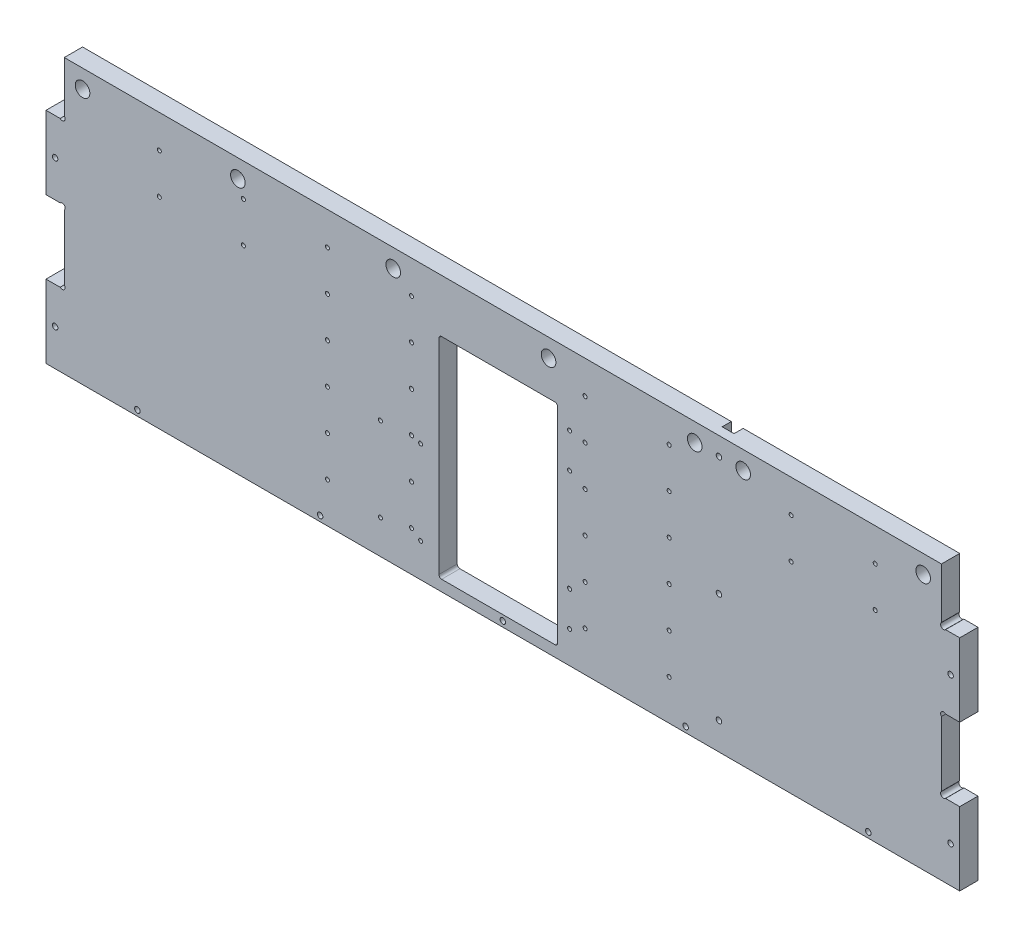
ISO-10303-21;
HEADER;
FILE_DESCRIPTION(('STEP AP214'),'2;1');
FILE_NAME('part.step','',(''),(''),'','','');
FILE_SCHEMA(('AUTOMOTIVE_DESIGN { 1 0 10303 214 1 1 1 1 }'));
ENDSEC;
DATA;
#1=APPLICATION_CONTEXT('core data for automotive mechanical design processes');
#2=APPLICATION_PROTOCOL_DEFINITION('international standard','automotive_design',2000,#1);
#3=PRODUCT_CONTEXT('',#1,'mechanical');
#4=PRODUCT('Part','Part','',(#3));
#5=PRODUCT_RELATED_PRODUCT_CATEGORY('part','',(#4));
#6=PRODUCT_DEFINITION_FORMATION('','',#4);
#7=PRODUCT_DEFINITION_CONTEXT('part definition',#1,'design');
#8=PRODUCT_DEFINITION('design','',#6,#7);
#9=PRODUCT_DEFINITION_SHAPE('','',#8);
#10=(LENGTH_UNIT() NAMED_UNIT(*) SI_UNIT(.MILLI.,.METRE.));
#11=(NAMED_UNIT(*) PLANE_ANGLE_UNIT() SI_UNIT($,.RADIAN.));
#12=(NAMED_UNIT(*) SI_UNIT($,.STERADIAN.) SOLID_ANGLE_UNIT());
#13=UNCERTAINTY_MEASURE_WITH_UNIT(LENGTH_MEASURE(1.E-05),#10,'distance_accuracy_value','');
#14=(GEOMETRIC_REPRESENTATION_CONTEXT(3) GLOBAL_UNCERTAINTY_ASSIGNED_CONTEXT((#13)) GLOBAL_UNIT_ASSIGNED_CONTEXT((#10,
#11,#12)) REPRESENTATION_CONTEXT('',''));
#15=CARTESIAN_POINT('',(0.,0.,0.));
#16=DIRECTION('',(0.,0.,1.));
#17=DIRECTION('',(1.,0.,0.));
#18=AXIS2_PLACEMENT_3D('',#15,#16,#17);
#19=CARTESIAN_POINT('',(0.,0.,0.));
#20=DIRECTION('',(0.,0.,1.));
#21=DIRECTION('',(1.,0.,0.));
#22=AXIS2_PLACEMENT_3D('',#19,#20,#21);
#23=PLANE('',#22);
#24=CARTESIAN_POINT('',(205.,18.5,0.));
#25=DIRECTION('',(0.,0.,-1.));
#26=DIRECTION('',(0.,1.,0.));
#27=AXIS2_PLACEMENT_3D('',#24,#25,#26);
#28=CIRCLE('',#27,1.09999999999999);
#29=CARTESIAN_POINT('',(205.,19.6,0.));
#30=VERTEX_POINT('',#29);
#31=EDGE_CURVE('E1376',#30,#30,#28,.T.);
#32=ORIENTED_EDGE('',*,*,#31,.F.);
#33=EDGE_LOOP('',(#32));
#34=FACE_BOUND('',#33,.T.);
#35=CARTESIAN_POINT('',(183.,18.5,0.));
#36=DIRECTION('',(0.,0.,-1.));
#37=DIRECTION('',(0.,1.,0.));
#38=AXIS2_PLACEMENT_3D('',#35,#36,#37);
#39=CIRCLE('',#38,1.09999999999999);
#40=CARTESIAN_POINT('',(183.,19.6,0.));
#41=VERTEX_POINT('',#40);
#42=EDGE_CURVE('E1378',#41,#41,#39,.T.);
#43=ORIENTED_EDGE('',*,*,#42,.F.);
#44=EDGE_LOOP('',(#43));
#45=FACE_BOUND('',#44,.T.);
#46=CARTESIAN_POINT('',(183.,64.5,0.));
#47=DIRECTION('',(0.,0.,-1.));
#48=DIRECTION('',(0.,1.,0.));
#49=AXIS2_PLACEMENT_3D('',#46,#47,#48);
#50=CIRCLE('',#49,1.09999999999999);
#51=CARTESIAN_POINT('',(183.,65.6,0.));
#52=VERTEX_POINT('',#51);
#53=EDGE_CURVE('E1386',#52,#52,#50,.T.);
#54=ORIENTED_EDGE('',*,*,#53,.F.);
#55=EDGE_LOOP('',(#54));
#56=FACE_BOUND('',#55,.T.);
#57=CARTESIAN_POINT('',(205.,64.5,0.));
#58=DIRECTION('',(0.,0.,-1.));
#59=DIRECTION('',(0.,1.,0.));
#60=AXIS2_PLACEMENT_3D('',#57,#58,#59);
#61=CIRCLE('',#60,1.09999999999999);
#62=CARTESIAN_POINT('',(205.,65.6,0.));
#63=VERTEX_POINT('',#62);
#64=EDGE_CURVE('E1392',#63,#63,#61,.T.);
#65=ORIENTED_EDGE('',*,*,#64,.F.);
#66=EDGE_LOOP('',(#65));
#67=FACE_BOUND('',#66,.T.);
#68=CARTESIAN_POINT('',(286.5,17.5,0.));
#69=DIRECTION('',(0.,0.,-1.));
#70=DIRECTION('',(-1.,0.,0.));
#71=AXIS2_PLACEMENT_3D('',#68,#69,#70);
#72=CIRCLE('',#71,1.09999999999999);
#73=CARTESIAN_POINT('',(285.4,17.5,0.));
#74=VERTEX_POINT('',#73);
#75=EDGE_CURVE('E1398',#74,#74,#72,.T.);
#76=ORIENTED_EDGE('',*,*,#75,.F.);
#77=EDGE_LOOP('',(#76));
#78=FACE_BOUND('',#77,.T.);
#79=CARTESIAN_POINT('',(286.5,36.5,0.));
#80=DIRECTION('',(0.,0.,-1.));
#81=DIRECTION('',(-1.,0.,0.));
#82=AXIS2_PLACEMENT_3D('',#79,#80,#81);
#83=CIRCLE('',#82,1.09999999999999);
#84=CARTESIAN_POINT('',(285.4,36.5,0.));
#85=VERTEX_POINT('',#84);
#86=EDGE_CURVE('E1404',#85,#85,#83,.T.);
#87=ORIENTED_EDGE('',*,*,#86,.F.);
#88=EDGE_LOOP('',(#87));
#89=FACE_BOUND('',#88,.T.);
#90=CARTESIAN_POINT('',(286.5,92.5,0.));
#91=DIRECTION('',(0.,0.,-1.));
#92=DIRECTION('',(-1.,0.,0.));
#93=AXIS2_PLACEMENT_3D('',#90,#91,#92);
#94=CIRCLE('',#93,1.09999999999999);
#95=CARTESIAN_POINT('',(285.4,92.5,0.));
#96=VERTEX_POINT('',#95);
#97=EDGE_CURVE('E1410',#96,#96,#94,.T.);
#98=ORIENTED_EDGE('',*,*,#97,.F.);
#99=EDGE_LOOP('',(#98));
#100=FACE_BOUND('',#99,.T.);
#101=CARTESIAN_POINT('',(286.5,111.5,0.));
#102=DIRECTION('',(0.,0.,-1.));
#103=DIRECTION('',(-1.,0.,0.));
#104=AXIS2_PLACEMENT_3D('',#101,#102,#103);
#105=CIRCLE('',#104,1.09999999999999);
#106=CARTESIAN_POINT('',(285.4,111.5,0.));
#107=VERTEX_POINT('',#106);
#108=EDGE_CURVE('E1416',#107,#107,#105,.T.);
#109=ORIENTED_EDGE('',*,*,#108,.F.);
#110=EDGE_LOOP('',(#109));
#111=FACE_BOUND('',#110,.T.);
#112=CARTESIAN_POINT('',(108.,132.,0.));
#113=DIRECTION('',(0.,0.,-1.));
#114=DIRECTION('',(-1.,0.,0.));
#115=AXIS2_PLACEMENT_3D('',#112,#113,#114);
#116=CIRCLE('',#115,1.1);
#117=CARTESIAN_POINT('',(106.9,132.,0.));
#118=VERTEX_POINT('',#117);
#119=EDGE_CURVE('E1422',#118,#118,#116,.T.);
#120=ORIENTED_EDGE('',*,*,#119,.F.);
#121=EDGE_LOOP('',(#120));
#122=FACE_BOUND('',#121,.T.);
#123=CARTESIAN_POINT('',(62.0000000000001,132.,0.));
#124=DIRECTION('',(0.,0.,-1.));
#125=DIRECTION('',(-1.,0.,0.));
#126=AXIS2_PLACEMENT_3D('',#123,#124,#125);
#127=CIRCLE('',#126,1.1);
#128=CARTESIAN_POINT('',(60.9000000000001,132.,0.));
#129=VERTEX_POINT('',#128);
#130=EDGE_CURVE('E1428',#129,#129,#127,.T.);
#131=ORIENTED_EDGE('',*,*,#130,.F.);
#132=EDGE_LOOP('',(#131));
#133=FACE_BOUND('',#132,.T.);
#134=CARTESIAN_POINT('',(62.,110.,0.));
#135=DIRECTION('',(0.,0.,-1.));
#136=DIRECTION('',(-1.,0.,0.));
#137=AXIS2_PLACEMENT_3D('',#134,#135,#136);
#138=CIRCLE('',#137,1.1);
#139=CARTESIAN_POINT('',(60.9,110.,0.));
#140=VERTEX_POINT('',#139);
#141=EDGE_CURVE('E1434',#140,#140,#138,.T.);
#142=ORIENTED_EDGE('',*,*,#141,.F.);
#143=EDGE_LOOP('',(#142));
#144=FACE_BOUND('',#143,.T.);
#145=CARTESIAN_POINT('',(108.,110.,0.));
#146=DIRECTION('',(0.,0.,-1.));
#147=DIRECTION('',(-1.,0.,0.));
#148=AXIS2_PLACEMENT_3D('',#145,#146,#147);
#149=CIRCLE('',#148,1.10000000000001);
#150=CARTESIAN_POINT('',(106.9,110.,0.));
#151=VERTEX_POINT('',#150);
#152=EDGE_CURVE('E1440',#151,#151,#149,.T.);
#153=ORIENTED_EDGE('',*,*,#152,.F.);
#154=EDGE_LOOP('',(#153));
#155=FACE_BOUND('',#154,.T.);
#156=CARTESIAN_POINT('',(200.,66.,0.));
#157=DIRECTION('',(0.,0.,-1.));
#158=DIRECTION('',(-1.,0.,0.));
#159=AXIS2_PLACEMENT_3D('',#156,#157,#158);
#160=CIRCLE('',#159,1.09999999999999);
#161=CARTESIAN_POINT('',(198.9,66.,0.));
#162=VERTEX_POINT('',#161);
#163=EDGE_CURVE('E1446',#162,#162,#160,.T.);
#164=ORIENTED_EDGE('',*,*,#163,.F.);
#165=EDGE_LOOP('',(#164));
#166=FACE_BOUND('',#165,.T.);
#167=CARTESIAN_POINT('',(200.,44.,0.));
#168=DIRECTION('',(0.,0.,-1.));
#169=DIRECTION('',(-1.,0.,0.));
#170=AXIS2_PLACEMENT_3D('',#167,#168,#169);
#171=CIRCLE('',#170,1.09999999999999);
#172=CARTESIAN_POINT('',(198.9,44.,0.));
#173=VERTEX_POINT('',#172);
#174=EDGE_CURVE('E1452',#173,#173,#171,.T.);
#175=ORIENTED_EDGE('',*,*,#174,.F.);
#176=EDGE_LOOP('',(#175));
#177=FACE_BOUND('',#176,.T.);
#178=CARTESIAN_POINT('',(200.,22.,0.));
#179=DIRECTION('',(0.,0.,-1.));
#180=DIRECTION('',(-1.,0.,0.));
#181=AXIS2_PLACEMENT_3D('',#178,#179,#180);
#182=CIRCLE('',#181,1.09999999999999);
#183=CARTESIAN_POINT('',(198.9,22.,0.));
#184=VERTEX_POINT('',#183);
#185=EDGE_CURVE('E1458',#184,#184,#182,.T.);
#186=ORIENTED_EDGE('',*,*,#185,.F.);
#187=EDGE_LOOP('',(#186));
#188=FACE_BOUND('',#187,.T.);
#189=CARTESIAN_POINT('',(154.,22.,0.));
#190=DIRECTION('',(0.,0.,-1.));
#191=DIRECTION('',(-1.,0.,0.));
#192=AXIS2_PLACEMENT_3D('',#189,#190,#191);
#193=CIRCLE('',#192,1.09999999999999);
#194=CARTESIAN_POINT('',(152.9,22.,0.));
#195=VERTEX_POINT('',#194);
#196=EDGE_CURVE('E1464',#195,#195,#193,.T.);
#197=ORIENTED_EDGE('',*,*,#196,.F.);
#198=EDGE_LOOP('',(#197));
#199=FACE_BOUND('',#198,.T.);
#200=CARTESIAN_POINT('',(154.,44.,0.));
#201=DIRECTION('',(0.,0.,-1.));
#202=DIRECTION('',(-1.,0.,0.));
#203=AXIS2_PLACEMENT_3D('',#200,#201,#202);
#204=CIRCLE('',#203,1.09999999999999);
#205=CARTESIAN_POINT('',(152.9,44.,0.));
#206=VERTEX_POINT('',#205);
#207=EDGE_CURVE('E1470',#206,#206,#204,.T.);
#208=ORIENTED_EDGE('',*,*,#207,.F.);
#209=EDGE_LOOP('',(#208));
#210=FACE_BOUND('',#209,.T.);
#211=CARTESIAN_POINT('',(154.,66.,0.));
#212=DIRECTION('',(0.,0.,-1.));
#213=DIRECTION('',(-1.,0.,0.));
#214=AXIS2_PLACEMENT_3D('',#211,#212,#213);
#215=CIRCLE('',#214,1.09999999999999);
#216=CARTESIAN_POINT('',(152.9,66.,0.));
#217=VERTEX_POINT('',#216);
#218=EDGE_CURVE('E1476',#217,#217,#215,.T.);
#219=ORIENTED_EDGE('',*,*,#218,.F.);
#220=EDGE_LOOP('',(#219));
#221=FACE_BOUND('',#220,.T.);
#222=CARTESIAN_POINT('',(154.,88.,0.));
#223=DIRECTION('',(0.,0.,-1.));
#224=DIRECTION('',(-1.,0.,0.));
#225=AXIS2_PLACEMENT_3D('',#222,#223,#224);
#226=CIRCLE('',#225,1.09999999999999);
#227=CARTESIAN_POINT('',(152.9,88.,0.));
#228=VERTEX_POINT('',#227);
#229=EDGE_CURVE('E1482',#228,#228,#226,.T.);
#230=ORIENTED_EDGE('',*,*,#229,.F.);
#231=EDGE_LOOP('',(#230));
#232=FACE_BOUND('',#231,.T.);
#233=CARTESIAN_POINT('',(200.,88.,0.));
#234=DIRECTION('',(0.,0.,-1.));
#235=DIRECTION('',(-1.,0.,0.));
#236=AXIS2_PLACEMENT_3D('',#233,#234,#235);
#237=CIRCLE('',#236,1.09999999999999);
#238=CARTESIAN_POINT('',(198.9,88.,0.));
#239=VERTEX_POINT('',#238);
#240=EDGE_CURVE('E1488',#239,#239,#237,.T.);
#241=ORIENTED_EDGE('',*,*,#240,.F.);
#242=EDGE_LOOP('',(#241));
#243=FACE_BOUND('',#242,.T.);
#244=CARTESIAN_POINT('',(200.,110.,0.));
#245=DIRECTION('',(0.,0.,-1.));
#246=DIRECTION('',(-1.,0.,0.));
#247=AXIS2_PLACEMENT_3D('',#244,#245,#246);
#248=CIRCLE('',#247,1.09999999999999);
#249=CARTESIAN_POINT('',(198.9,110.,0.));
#250=VERTEX_POINT('',#249);
#251=EDGE_CURVE('E1494',#250,#250,#248,.T.);
#252=ORIENTED_EDGE('',*,*,#251,.F.);
#253=EDGE_LOOP('',(#252));
#254=FACE_BOUND('',#253,.T.);
#255=CARTESIAN_POINT('',(154.,110.,0.));
#256=DIRECTION('',(0.,0.,-1.));
#257=DIRECTION('',(-1.,0.,0.));
#258=AXIS2_PLACEMENT_3D('',#255,#256,#257);
#259=CIRCLE('',#258,1.09999999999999);
#260=CARTESIAN_POINT('',(152.9,110.,0.));
#261=VERTEX_POINT('',#260);
#262=EDGE_CURVE('E1500',#261,#261,#259,.T.);
#263=ORIENTED_EDGE('',*,*,#262,.F.);
#264=EDGE_LOOP('',(#263));
#265=FACE_BOUND('',#264,.T.);
#266=CARTESIAN_POINT('',(154.,132.,0.));
#267=DIRECTION('',(0.,0.,-1.));
#268=DIRECTION('',(-1.,0.,0.));
#269=AXIS2_PLACEMENT_3D('',#266,#267,#268);
#270=CIRCLE('',#269,1.09999999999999);
#271=CARTESIAN_POINT('',(152.9,132.,0.));
#272=VERTEX_POINT('',#271);
#273=EDGE_CURVE('E1506',#272,#272,#270,.T.);
#274=ORIENTED_EDGE('',*,*,#273,.F.);
#275=EDGE_LOOP('',(#274));
#276=FACE_BOUND('',#275,.T.);
#277=CARTESIAN_POINT('',(200.,132.,0.));
#278=DIRECTION('',(0.,0.,-1.));
#279=DIRECTION('',(-1.,0.,0.));
#280=AXIS2_PLACEMENT_3D('',#277,#278,#279);
#281=CIRCLE('',#280,1.09999999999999);
#282=CARTESIAN_POINT('',(198.9,132.,0.));
#283=VERTEX_POINT('',#282);
#284=EDGE_CURVE('E1512',#283,#283,#281,.T.);
#285=ORIENTED_EDGE('',*,*,#284,.F.);
#286=EDGE_LOOP('',(#285));
#287=FACE_BOUND('',#286,.T.);
#288=CARTESIAN_POINT('',(341.,66.,0.));
#289=DIRECTION('',(0.,0.,-1.));
#290=DIRECTION('',(-1.,0.,0.));
#291=AXIS2_PLACEMENT_3D('',#288,#289,#290);
#292=CIRCLE('',#291,1.09999999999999);
#293=CARTESIAN_POINT('',(339.9,66.,0.));
#294=VERTEX_POINT('',#293);
#295=EDGE_CURVE('E1518',#294,#294,#292,.T.);
#296=ORIENTED_EDGE('',*,*,#295,.F.);
#297=EDGE_LOOP('',(#296));
#298=FACE_BOUND('',#297,.T.);
#299=CARTESIAN_POINT('',(341.,44.,0.));
#300=DIRECTION('',(0.,0.,-1.));
#301=DIRECTION('',(-1.,0.,0.));
#302=AXIS2_PLACEMENT_3D('',#299,#300,#301);
#303=CIRCLE('',#302,1.09999999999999);
#304=CARTESIAN_POINT('',(339.9,44.,0.));
#305=VERTEX_POINT('',#304);
#306=EDGE_CURVE('E1524',#305,#305,#303,.T.);
#307=ORIENTED_EDGE('',*,*,#306,.F.);
#308=EDGE_LOOP('',(#307));
#309=FACE_BOUND('',#308,.T.);
#310=CARTESIAN_POINT('',(341.,22.,0.));
#311=DIRECTION('',(0.,0.,-1.));
#312=DIRECTION('',(-1.,0.,0.));
#313=AXIS2_PLACEMENT_3D('',#310,#311,#312);
#314=CIRCLE('',#313,1.09999999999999);
#315=CARTESIAN_POINT('',(339.9,22.,0.));
#316=VERTEX_POINT('',#315);
#317=EDGE_CURVE('E1530',#316,#316,#314,.T.);
#318=ORIENTED_EDGE('',*,*,#317,.F.);
#319=EDGE_LOOP('',(#318));
#320=FACE_BOUND('',#319,.T.);
#321=CARTESIAN_POINT('',(295.,22.,0.));
#322=DIRECTION('',(0.,0.,-1.));
#323=DIRECTION('',(-1.,0.,0.));
#324=AXIS2_PLACEMENT_3D('',#321,#322,#323);
#325=CIRCLE('',#324,1.09999999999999);
#326=CARTESIAN_POINT('',(293.9,22.,0.));
#327=VERTEX_POINT('',#326);
#328=EDGE_CURVE('E1536',#327,#327,#325,.T.);
#329=ORIENTED_EDGE('',*,*,#328,.F.);
#330=EDGE_LOOP('',(#329));
#331=FACE_BOUND('',#330,.T.);
#332=CARTESIAN_POINT('',(295.,44.,0.));
#333=DIRECTION('',(0.,0.,-1.));
#334=DIRECTION('',(-1.,0.,0.));
#335=AXIS2_PLACEMENT_3D('',#332,#333,#334);
#336=CIRCLE('',#335,1.09999999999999);
#337=CARTESIAN_POINT('',(293.9,44.,0.));
#338=VERTEX_POINT('',#337);
#339=EDGE_CURVE('E1542',#338,#338,#336,.T.);
#340=ORIENTED_EDGE('',*,*,#339,.F.);
#341=EDGE_LOOP('',(#340));
#342=FACE_BOUND('',#341,.T.);
#343=CARTESIAN_POINT('',(295.,66.,0.));
#344=DIRECTION('',(0.,0.,-1.));
#345=DIRECTION('',(-1.,0.,0.));
#346=AXIS2_PLACEMENT_3D('',#343,#344,#345);
#347=CIRCLE('',#346,1.09999999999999);
#348=CARTESIAN_POINT('',(293.9,66.,0.));
#349=VERTEX_POINT('',#348);
#350=EDGE_CURVE('E1548',#349,#349,#347,.T.);
#351=ORIENTED_EDGE('',*,*,#350,.F.);
#352=EDGE_LOOP('',(#351));
#353=FACE_BOUND('',#352,.T.);
#354=CARTESIAN_POINT('',(295.,88.,0.));
#355=DIRECTION('',(0.,0.,-1.));
#356=DIRECTION('',(-1.,0.,0.));
#357=AXIS2_PLACEMENT_3D('',#354,#355,#356);
#358=CIRCLE('',#357,1.09999999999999);
#359=CARTESIAN_POINT('',(293.9,88.,0.));
#360=VERTEX_POINT('',#359);
#361=EDGE_CURVE('E1554',#360,#360,#358,.T.);
#362=ORIENTED_EDGE('',*,*,#361,.F.);
#363=EDGE_LOOP('',(#362));
#364=FACE_BOUND('',#363,.T.);
#365=CARTESIAN_POINT('',(341.,88.,0.));
#366=DIRECTION('',(0.,0.,-1.));
#367=DIRECTION('',(-1.,0.,0.));
#368=AXIS2_PLACEMENT_3D('',#365,#366,#367);
#369=CIRCLE('',#368,1.09999999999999);
#370=CARTESIAN_POINT('',(339.9,88.,0.));
#371=VERTEX_POINT('',#370);
#372=EDGE_CURVE('E1560',#371,#371,#369,.T.);
#373=ORIENTED_EDGE('',*,*,#372,.F.);
#374=EDGE_LOOP('',(#373));
#375=FACE_BOUND('',#374,.T.);
#376=CARTESIAN_POINT('',(341.,110.,0.));
#377=DIRECTION('',(0.,0.,-1.));
#378=DIRECTION('',(-1.,0.,0.));
#379=AXIS2_PLACEMENT_3D('',#376,#377,#378);
#380=CIRCLE('',#379,1.09999999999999);
#381=CARTESIAN_POINT('',(339.9,110.,0.));
#382=VERTEX_POINT('',#381);
#383=EDGE_CURVE('E1566',#382,#382,#380,.T.);
#384=ORIENTED_EDGE('',*,*,#383,.F.);
#385=EDGE_LOOP('',(#384));
#386=FACE_BOUND('',#385,.T.);
#387=CARTESIAN_POINT('',(295.,110.,0.));
#388=DIRECTION('',(0.,0.,-1.));
#389=DIRECTION('',(-1.,0.,0.));
#390=AXIS2_PLACEMENT_3D('',#387,#388,#389);
#391=CIRCLE('',#390,1.09999999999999);
#392=CARTESIAN_POINT('',(293.9,110.,0.));
#393=VERTEX_POINT('',#392);
#394=EDGE_CURVE('E1572',#393,#393,#391,.T.);
#395=ORIENTED_EDGE('',*,*,#394,.F.);
#396=EDGE_LOOP('',(#395));
#397=FACE_BOUND('',#396,.T.);
#398=CARTESIAN_POINT('',(295.,132.,0.));
#399=DIRECTION('',(0.,0.,-1.));
#400=DIRECTION('',(-1.,0.,0.));
#401=AXIS2_PLACEMENT_3D('',#398,#399,#400);
#402=CIRCLE('',#401,1.09999999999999);
#403=CARTESIAN_POINT('',(293.9,132.,0.));
#404=VERTEX_POINT('',#403);
#405=EDGE_CURVE('E1578',#404,#404,#402,.T.);
#406=ORIENTED_EDGE('',*,*,#405,.F.);
#407=EDGE_LOOP('',(#406));
#408=FACE_BOUND('',#407,.T.);
#409=CARTESIAN_POINT('',(341.,132.,0.));
#410=DIRECTION('',(0.,0.,-1.));
#411=DIRECTION('',(-1.,0.,0.));
#412=AXIS2_PLACEMENT_3D('',#409,#410,#411);
#413=CIRCLE('',#412,1.09999999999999);
#414=CARTESIAN_POINT('',(339.9,132.,0.));
#415=VERTEX_POINT('',#414);
#416=EDGE_CURVE('E1584',#415,#415,#413,.T.);
#417=ORIENTED_EDGE('',*,*,#416,.F.);
#418=EDGE_LOOP('',(#417));
#419=FACE_BOUND('',#418,.T.);
#420=DIRECTION('',(0.,-1.,0.));
#421=VECTOR('',#420,1.);
#422=CARTESIAN_POINT('',(280.,119.5,0.));
#423=LINE('',#422,#421);
#424=CARTESIAN_POINT('',(280.,119.5,0.));
#425=VERTEX_POINT('',#424);
#426=CARTESIAN_POINT('',(280.,7.50000000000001,0.));
#427=VERTEX_POINT('',#426);
#428=EDGE_CURVE('E258',#425,#427,#423,.T.);
#429=ORIENTED_EDGE('',*,*,#428,.F.);
#430=CARTESIAN_POINT('',(278.5,119.5,0.));
#431=DIRECTION('',(0.,0.,-1.));
#432=DIRECTION('',(-1.,0.,0.));
#433=AXIS2_PLACEMENT_3D('',#430,#431,#432);
#434=CIRCLE('',#433,1.5);
#435=CARTESIAN_POINT('',(278.5,121.,0.));
#436=VERTEX_POINT('',#435);
#437=EDGE_CURVE('E41',#436,#425,#434,.T.);
#438=ORIENTED_EDGE('',*,*,#437,.F.);
#439=DIRECTION('',(1.,0.,0.));
#440=VECTOR('',#439,1.);
#441=CARTESIAN_POINT('',(278.5,121.,0.));
#442=LINE('',#441,#440);
#443=CARTESIAN_POINT('',(216.5,121.,0.));
#444=VERTEX_POINT('',#443);
#445=EDGE_CURVE('E279',#444,#436,#442,.T.);
#446=ORIENTED_EDGE('',*,*,#445,.F.);
#447=CARTESIAN_POINT('',(216.5,119.5,0.));
#448=DIRECTION('',(0.,0.,-1.));
#449=DIRECTION('',(-1.,0.,0.));
#450=AXIS2_PLACEMENT_3D('',#447,#448,#449);
#451=CIRCLE('',#450,1.5);
#452=CARTESIAN_POINT('',(215.,119.5,0.));
#453=VERTEX_POINT('',#452);
#454=EDGE_CURVE('E276',#453,#444,#451,.T.);
#455=ORIENTED_EDGE('',*,*,#454,.F.);
#456=DIRECTION('',(0.,1.,0.));
#457=VECTOR('',#456,1.);
#458=CARTESIAN_POINT('',(215.,7.50000000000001,0.));
#459=LINE('',#458,#457);
#460=CARTESIAN_POINT('',(215.,7.50000000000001,0.));
#461=VERTEX_POINT('',#460);
#462=EDGE_CURVE('E273',#461,#453,#459,.T.);
#463=ORIENTED_EDGE('',*,*,#462,.F.);
#464=CARTESIAN_POINT('',(216.5,7.5,0.));
#465=DIRECTION('',(0.,0.,-1.));
#466=DIRECTION('',(-1.,0.,0.));
#467=AXIS2_PLACEMENT_3D('',#464,#465,#466);
#468=CIRCLE('',#467,1.5);
#469=CARTESIAN_POINT('',(216.5,6.,0.));
#470=VERTEX_POINT('',#469);
#471=EDGE_CURVE('E267',#470,#461,#468,.T.);
#472=ORIENTED_EDGE('',*,*,#471,.F.);
#473=DIRECTION('',(-1.,0.,0.));
#474=VECTOR('',#473,1.);
#475=CARTESIAN_POINT('',(278.5,6.,0.));
#476=LINE('',#475,#474);
#477=CARTESIAN_POINT('',(278.5,6.,0.));
#478=VERTEX_POINT('',#477);
#479=EDGE_CURVE('E265',#478,#470,#476,.T.);
#480=ORIENTED_EDGE('',*,*,#479,.F.);
#481=CARTESIAN_POINT('',(278.5,7.5,0.));
#482=DIRECTION('',(0.,0.,-1.));
#483=DIRECTION('',(-1.,0.,0.));
#484=AXIS2_PLACEMENT_3D('',#481,#482,#483);
#485=CIRCLE('',#484,1.5);
#486=EDGE_CURVE('E249',#427,#478,#485,.T.);
#487=ORIENTED_EDGE('',*,*,#486,.F.);
#488=EDGE_LOOP('',(#429,#438,#446,#455,#463,#472,#480,#487));
#489=FACE_BOUND('',#488,.T.);
#490=CARTESIAN_POINT('',(275.,140.,0.));
#491=DIRECTION('',(0.,0.,-1.));
#492=DIRECTION('',(-1.,0.,0.));
#493=AXIS2_PLACEMENT_3D('',#490,#491,#492);
#494=CIRCLE('',#493,3.99999999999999);
#495=CARTESIAN_POINT('',(271.,140.,0.));
#496=VERTEX_POINT('',#495);
#497=EDGE_CURVE('E305',#496,#496,#494,.T.);
#498=ORIENTED_EDGE('',*,*,#497,.F.);
#499=EDGE_LOOP('',(#498));
#500=FACE_BOUND('',#499,.T.);
#501=CARTESIAN_POINT('',(105.,140.,0.));
#502=DIRECTION('',(0.,0.,-1.));
#503=DIRECTION('',(-1.,0.,0.));
#504=AXIS2_PLACEMENT_3D('',#501,#502,#503);
#505=CIRCLE('',#504,3.99999999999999);
#506=CARTESIAN_POINT('',(101.,140.,0.));
#507=VERTEX_POINT('',#506);
#508=EDGE_CURVE('E321',#507,#507,#505,.T.);
#509=ORIENTED_EDGE('',*,*,#508,.F.);
#510=EDGE_LOOP('',(#509));
#511=FACE_BOUND('',#510,.T.);
#512=CARTESIAN_POINT('',(190.,140.,0.));
#513=DIRECTION('',(0.,0.,-1.));
#514=DIRECTION('',(-1.,0.,0.));
#515=AXIS2_PLACEMENT_3D('',#512,#513,#514);
#516=CIRCLE('',#515,3.99999999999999);
#517=CARTESIAN_POINT('',(186.,140.,0.));
#518=VERTEX_POINT('',#517);
#519=EDGE_CURVE('E327',#518,#518,#516,.T.);
#520=ORIENTED_EDGE('',*,*,#519,.F.);
#521=EDGE_LOOP('',(#520));
#522=FACE_BOUND('',#521,.T.);
#523=CARTESIAN_POINT('',(355.,140.,0.));
#524=DIRECTION('',(0.,0.,-1.));
#525=DIRECTION('',(-1.,0.,0.));
#526=AXIS2_PLACEMENT_3D('',#523,#524,#525);
#527=CIRCLE('',#526,3.99999999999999);
#528=CARTESIAN_POINT('',(351.,140.,0.));
#529=VERTEX_POINT('',#528);
#530=EDGE_CURVE('E333',#529,#529,#527,.T.);
#531=ORIENTED_EDGE('',*,*,#530,.F.);
#532=EDGE_LOOP('',(#531));
#533=FACE_BOUND('',#532,.T.);
#534=CARTESIAN_POINT('',(5.,20.,0.));
#535=DIRECTION('',(0.,0.,1.));
#536=DIRECTION('',(1.,0.,0.));
#537=AXIS2_PLACEMENT_3D('',#534,#535,#536);
#538=CIRCLE('',#537,1.5);
#539=CARTESIAN_POINT('',(6.5,20.,0.));
#540=VERTEX_POINT('',#539);
#541=EDGE_CURVE('E452',#540,#540,#538,.T.);
#542=ORIENTED_EDGE('',*,*,#541,.T.);
#543=EDGE_LOOP('',(#542));
#544=FACE_BOUND('',#543,.T.);
#545=CARTESIAN_POINT('',(5.,100.,0.));
#546=DIRECTION('',(0.,0.,1.));
#547=DIRECTION('',(1.,0.,0.));
#548=AXIS2_PLACEMENT_3D('',#545,#546,#547);
#549=CIRCLE('',#548,1.5);
#550=CARTESIAN_POINT('',(6.5,100.,0.));
#551=VERTEX_POINT('',#550);
#552=EDGE_CURVE('E446',#551,#551,#549,.T.);
#553=ORIENTED_EDGE('',*,*,#552,.T.);
#554=EDGE_LOOP('',(#553));
#555=FACE_BOUND('',#554,.T.);
#556=CARTESIAN_POINT('',(250.,3.00000000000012,0.));
#557=DIRECTION('',(0.,0.,1.));
#558=DIRECTION('',(1.,0.,0.));
#559=AXIS2_PLACEMENT_3D('',#556,#557,#558);
#560=CIRCLE('',#559,1.50000000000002);
#561=CARTESIAN_POINT('',(251.5,3.00000000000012,0.));
#562=VERTEX_POINT('',#561);
#563=EDGE_CURVE('E428',#562,#562,#560,.T.);
#564=ORIENTED_EDGE('',*,*,#563,.T.);
#565=EDGE_LOOP('',(#564));
#566=FACE_BOUND('',#565,.T.);
#567=CARTESIAN_POINT('',(50.,3.00000000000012,0.));
#568=DIRECTION('',(0.,0.,1.));
#569=DIRECTION('',(1.,0.,0.));
#570=AXIS2_PLACEMENT_3D('',#567,#568,#569);
#571=CIRCLE('',#570,1.5);
#572=CARTESIAN_POINT('',(51.5,3.00000000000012,0.));
#573=VERTEX_POINT('',#572);
#574=EDGE_CURVE('E422',#573,#573,#571,.T.);
#575=ORIENTED_EDGE('',*,*,#574,.T.);
#576=EDGE_LOOP('',(#575));
#577=FACE_BOUND('',#576,.T.);
#578=CARTESIAN_POINT('',(150.,3.00000000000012,0.));
#579=DIRECTION('',(0.,0.,1.));
#580=DIRECTION('',(1.,0.,0.));
#581=AXIS2_PLACEMENT_3D('',#578,#579,#580);
#582=CIRCLE('',#581,1.5);
#583=CARTESIAN_POINT('',(151.5,3.00000000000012,0.));
#584=VERTEX_POINT('',#583);
#585=EDGE_CURVE('E416',#584,#584,#582,.T.);
#586=ORIENTED_EDGE('',*,*,#585,.T.);
#587=EDGE_LOOP('',(#586));
#588=FACE_BOUND('',#587,.T.);
#589=CARTESIAN_POINT('',(350.,3.00000000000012,0.));
#590=DIRECTION('',(0.,0.,1.));
#591=DIRECTION('',(1.,0.,0.));
#592=AXIS2_PLACEMENT_3D('',#589,#590,#591);
#593=CIRCLE('',#592,1.50000000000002);
#594=CARTESIAN_POINT('',(351.5,3.00000000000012,0.));
#595=VERTEX_POINT('',#594);
#596=EDGE_CURVE('E404',#595,#595,#593,.T.);
#597=ORIENTED_EDGE('',*,*,#596,.T.);
#598=EDGE_LOOP('',(#597));
#599=FACE_BOUND('',#598,.T.);
#600=CARTESIAN_POINT('',(20.,140.,0.));
#601=DIRECTION('',(0.,0.,1.));
#602=DIRECTION('',(1.,0.,0.));
#603=AXIS2_PLACEMENT_3D('',#600,#601,#602);
#604=CIRCLE('',#603,4.00000000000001);
#605=CARTESIAN_POINT('',(24.,140.,0.));
#606=VERTEX_POINT('',#605);
#607=EDGE_CURVE('E392',#606,#606,#604,.T.);
#608=ORIENTED_EDGE('',*,*,#607,.T.);
#609=EDGE_LOOP('',(#608));
#610=FACE_BOUND('',#609,.T.);
#611=DIRECTION('',(-1.,0.,0.));
#612=VECTOR('',#611,1.);
#613=CARTESIAN_POINT('',(490.,150.,0.));
#614=LINE('',#613,#612);
#615=CARTESIAN_POINT('',(365.,150.,0.));
#616=VERTEX_POINT('',#615);
#617=CARTESIAN_POINT('',(10.,150.,0.));
#618=VERTEX_POINT('',#617);
#619=EDGE_CURVE('E527',#616,#618,#614,.T.);
#620=ORIENTED_EDGE('',*,*,#619,.F.);
#621=DIRECTION('',(0.,1.,0.));
#622=VECTOR('',#621,1.);
#623=CARTESIAN_POINT('',(365.,150.,0.));
#624=LINE('',#623,#622);
#625=CARTESIAN_POINT('',(365.,0.,0.));
#626=VERTEX_POINT('',#625);
#627=EDGE_CURVE('E363',#626,#616,#624,.T.);
#628=ORIENTED_EDGE('',*,*,#627,.F.);
#629=DIRECTION('',(1.,0.,0.));
#630=VECTOR('',#629,1.);
#631=CARTESIAN_POINT('',(0.,0.,0.));
#632=LINE('',#631,#630);
#633=CARTESIAN_POINT('',(0.,0.,0.));
#634=VERTEX_POINT('',#633);
#635=EDGE_CURVE('E508',#634,#626,#632,.T.);
#636=ORIENTED_EDGE('',*,*,#635,.F.);
#637=DIRECTION('',(0.,-1.,0.));
#638=VECTOR('',#637,1.);
#639=CARTESIAN_POINT('',(0.,40.,0.));
#640=LINE('',#639,#638);
#641=CARTESIAN_POINT('',(0.,40.,0.));
#642=VERTEX_POINT('',#641);
#643=EDGE_CURVE('E504',#642,#634,#640,.T.);
#644=ORIENTED_EDGE('',*,*,#643,.F.);
#645=DIRECTION('',(-1.,0.,0.));
#646=VECTOR('',#645,1.);
#647=CARTESIAN_POINT('',(10.,40.,0.));
#648=LINE('',#647,#646);
#649=CARTESIAN_POINT('',(7.7372583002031,40.,0.));
#650=VERTEX_POINT('',#649);
#651=EDGE_CURVE('E544',#650,#642,#648,.T.);
#652=ORIENTED_EDGE('',*,*,#651,.F.);
#653=CARTESIAN_POINT('',(8.86862915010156,41.1313708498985,0.));
#654=DIRECTION('',(0.,0.,1.));
#655=DIRECTION('',(1.,0.,0.));
#656=AXIS2_PLACEMENT_3D('',#653,#654,#655);
#657=CIRCLE('',#656,1.6);
#658=CARTESIAN_POINT('',(10.,42.262741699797,0.));
#659=VERTEX_POINT('',#658);
#660=EDGE_CURVE('E619',#650,#659,#657,.T.);
#661=ORIENTED_EDGE('',*,*,#660,.T.);
#662=DIRECTION('',(0.,-1.,0.));
#663=VECTOR('',#662,1.);
#664=CARTESIAN_POINT('',(10.,80.0000000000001,0.));
#665=LINE('',#664,#663);
#666=CARTESIAN_POINT('',(10.,77.7372583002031,0.));
#667=VERTEX_POINT('',#666);
#668=EDGE_CURVE('E541',#667,#659,#665,.T.);
#669=ORIENTED_EDGE('',*,*,#668,.F.);
#670=CARTESIAN_POINT('',(8.86862915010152,78.8686291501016,0.));
#671=DIRECTION('',(0.,0.,1.));
#672=DIRECTION('',(1.,0.,0.));
#673=AXIS2_PLACEMENT_3D('',#670,#671,#672);
#674=CIRCLE('',#673,1.6);
#675=CARTESIAN_POINT('',(7.73725830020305,80.0000000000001,0.));
#676=VERTEX_POINT('',#675);
#677=EDGE_CURVE('E617',#667,#676,#674,.T.);
#678=ORIENTED_EDGE('',*,*,#677,.T.);
#679=DIRECTION('',(1.,0.,0.));
#680=VECTOR('',#679,1.);
#681=CARTESIAN_POINT('',(0.,80.0000000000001,0.));
#682=LINE('',#681,#680);
#683=CARTESIAN_POINT('',(0.,80.0000000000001,0.));
#684=VERTEX_POINT('',#683);
#685=EDGE_CURVE('E538',#684,#676,#682,.T.);
#686=ORIENTED_EDGE('',*,*,#685,.F.);
#687=DIRECTION('',(0.,-1.,0.));
#688=VECTOR('',#687,1.);
#689=CARTESIAN_POINT('',(0.,120.,0.));
#690=LINE('',#689,#688);
#691=CARTESIAN_POINT('',(0.,120.,0.));
#692=VERTEX_POINT('',#691);
#693=EDGE_CURVE('E536',#692,#684,#690,.T.);
#694=ORIENTED_EDGE('',*,*,#693,.F.);
#695=DIRECTION('',(-1.,0.,0.));
#696=VECTOR('',#695,1.);
#697=CARTESIAN_POINT('',(10.,120.,0.));
#698=LINE('',#697,#696);
#699=CARTESIAN_POINT('',(7.73725830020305,120.,0.));
#700=VERTEX_POINT('',#699);
#701=EDGE_CURVE('E534',#700,#692,#698,.T.);
#702=ORIENTED_EDGE('',*,*,#701,.F.);
#703=CARTESIAN_POINT('',(8.86862915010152,121.131370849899,0.));
#704=DIRECTION('',(0.,0.,1.));
#705=DIRECTION('',(1.,0.,0.));
#706=AXIS2_PLACEMENT_3D('',#703,#704,#705);
#707=CIRCLE('',#706,1.6);
#708=CARTESIAN_POINT('',(10.,122.262741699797,0.));
#709=VERTEX_POINT('',#708);
#710=EDGE_CURVE('E614',#700,#709,#707,.T.);
#711=ORIENTED_EDGE('',*,*,#710,.T.);
#712=DIRECTION('',(0.,-1.,0.));
#713=VECTOR('',#712,1.);
#714=CARTESIAN_POINT('',(10.,150.,0.));
#715=LINE('',#714,#713);
#716=EDGE_CURVE('E531',#618,#709,#715,.T.);
#717=ORIENTED_EDGE('',*,*,#716,.F.);
#718=EDGE_LOOP('',(#620,#628,#636,#644,#652,#661,#669,#678,#686,#694,#702,#711,#717));
#719=FACE_BOUND('',#718,.T.);
#720=ADVANCED_FACE('F26',(#34,#45,#56,#67,#78,#89,#100,#111,#122,#133,#144,#155,#166,#177,#188,
#199,#210,#221,#232,#243,#254,#265,#276,#287,#298,#309,#320,#331,#342,#353,#364,#375,#386,#397,
#408,#419,#489,#500,#511,#522,#533,#544,#555,#566,#577,#588,#599,#610,#719),#23,.F.);
#721=CARTESIAN_POINT('',(0.,40.,10.));
#722=DIRECTION('',(1.,0.,0.));
#723=DIRECTION('',(0.,0.,-1.));
#724=AXIS2_PLACEMENT_3D('',#721,#722,#723);
#725=PLANE('',#724);
#726=ORIENTED_EDGE('',*,*,#643,.T.);
#727=DIRECTION('',(0.,0.,-1.));
#728=VECTOR('',#727,1.);
#729=CARTESIAN_POINT('',(0.,0.,10.));
#730=LINE('',#729,#728);
#731=CARTESIAN_POINT('',(0.,0.,10.));
#732=VERTEX_POINT('',#731);
#733=EDGE_CURVE('E611',#732,#634,#730,.T.);
#734=ORIENTED_EDGE('',*,*,#733,.F.);
#735=DIRECTION('',(0.,-1.,0.));
#736=VECTOR('',#735,1.);
#737=CARTESIAN_POINT('',(0.,40.,10.));
#738=LINE('',#737,#736);
#739=CARTESIAN_POINT('',(0.,40.,10.));
#740=VERTEX_POINT('',#739);
#741=EDGE_CURVE('E546',#740,#732,#738,.T.);
#742=ORIENTED_EDGE('',*,*,#741,.F.);
#743=DIRECTION('',(0.,0.,-1.));
#744=VECTOR('',#743,1.);
#745=CARTESIAN_POINT('',(0.,40.,10.));
#746=LINE('',#745,#744);
#747=EDGE_CURVE('E584',#740,#642,#746,.T.);
#748=ORIENTED_EDGE('',*,*,#747,.T.);
#749=EDGE_LOOP('',(#726,#734,#742,#748));
#750=FACE_BOUND('',#749,.T.);
#751=ADVANCED_FACE('F28',(#750),#725,.F.);
#752=CARTESIAN_POINT('',(0.,0.,10.));
#753=DIRECTION('',(0.,1.,0.));
#754=DIRECTION('',(0.,0.,1.));
#755=AXIS2_PLACEMENT_3D('',#752,#753,#754);
#756=PLANE('',#755);
#757=ORIENTED_EDGE('',*,*,#635,.T.);
#758=DIRECTION('',(0.,0.,-1.));
#759=VECTOR('',#758,1.);
#760=CARTESIAN_POINT('',(365.,0.,5.));
#761=LINE('',#760,#759);
#762=CARTESIAN_POINT('',(365.,0.,5.));
#763=VERTEX_POINT('',#762);
#764=EDGE_CURVE('E380',#763,#626,#761,.T.);
#765=ORIENTED_EDGE('',*,*,#764,.F.);
#766=DIRECTION('',(-1.,0.,0.));
#767=VECTOR('',#766,1.);
#768=CARTESIAN_POINT('',(365.,0.,5.));
#769=LINE('',#768,#767);
#770=CARTESIAN_POINT('',(371.5,0.,5.));
#771=VERTEX_POINT('',#770);
#772=EDGE_CURVE('E376',#771,#763,#769,.T.);
#773=ORIENTED_EDGE('',*,*,#772,.F.);
#774=DIRECTION('',(0.,0.,-1.));
#775=VECTOR('',#774,1.);
#776=CARTESIAN_POINT('',(371.5,0.,5.));
#777=LINE('',#776,#775);
#778=CARTESIAN_POINT('',(371.5,0.,0.));
#779=VERTEX_POINT('',#778);
#780=EDGE_CURVE('E383',#771,#779,#777,.T.);
#781=ORIENTED_EDGE('',*,*,#780,.T.);
#782=CARTESIAN_POINT('',(500.,0.,0.));
#783=VERTEX_POINT('',#782);
#784=EDGE_CURVE('E507',#779,#783,#632,.T.);
#785=ORIENTED_EDGE('',*,*,#784,.T.);
#786=DIRECTION('',(0.,0.,-1.));
#787=VECTOR('',#786,1.);
#788=CARTESIAN_POINT('',(500.,0.,10.));
#789=LINE('',#788,#787);
#790=CARTESIAN_POINT('',(500.,0.,10.));
#791=VERTEX_POINT('',#790);
#792=EDGE_CURVE('E608',#791,#783,#789,.T.);
#793=ORIENTED_EDGE('',*,*,#792,.F.);
#794=DIRECTION('',(1.,0.,0.));
#795=VECTOR('',#794,1.);
#796=CARTESIAN_POINT('',(0.,0.,10.));
#797=LINE('',#796,#795);
#798=EDGE_CURVE('E549',#732,#791,#797,.T.);
#799=ORIENTED_EDGE('',*,*,#798,.F.);
#800=ORIENTED_EDGE('',*,*,#733,.T.);
#801=EDGE_LOOP('',(#757,#765,#773,#781,#785,#793,#799,#800));
#802=FACE_BOUND('',#801,.T.);
#803=ADVANCED_FACE('F662',(#802),#756,.F.);
#804=CARTESIAN_POINT('',(500.,0.,10.));
#805=DIRECTION('',(-1.,0.,0.));
#806=DIRECTION('',(0.,0.,1.));
#807=AXIS2_PLACEMENT_3D('',#804,#805,#806);
#808=PLANE('',#807);
#809=DIRECTION('',(0.,1.,0.));
#810=VECTOR('',#809,1.);
#811=CARTESIAN_POINT('',(500.,0.,0.));
#812=LINE('',#811,#810);
#813=CARTESIAN_POINT('',(500.,40.0000000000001,0.));
#814=VERTEX_POINT('',#813);
#815=EDGE_CURVE('E511',#783,#814,#812,.T.);
#816=ORIENTED_EDGE('',*,*,#815,.T.);
#817=DIRECTION('',(0.,0.,-1.));
#818=VECTOR('',#817,1.);
#819=CARTESIAN_POINT('',(500.,40.0000000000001,10.));
#820=LINE('',#819,#818);
#821=CARTESIAN_POINT('',(500.,40.0000000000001,10.));
#822=VERTEX_POINT('',#821);
#823=EDGE_CURVE('E605',#822,#814,#820,.T.);
#824=ORIENTED_EDGE('',*,*,#823,.F.);
#825=DIRECTION('',(0.,1.,0.));
#826=VECTOR('',#825,1.);
#827=CARTESIAN_POINT('',(500.,0.,10.));
#828=LINE('',#827,#826);
#829=EDGE_CURVE('E551',#791,#822,#828,.T.);
#830=ORIENTED_EDGE('',*,*,#829,.F.);
#831=ORIENTED_EDGE('',*,*,#792,.T.);
#832=EDGE_LOOP('',(#816,#824,#830,#831));
#833=FACE_BOUND('',#832,.T.);
#834=ADVANCED_FACE('F657',(#833),#808,.F.);
#835=CARTESIAN_POINT('',(500.,40.0000000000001,10.));
#836=DIRECTION('',(0.,-1.,0.));
#837=DIRECTION('',(1.,0.,0.));
#838=AXIS2_PLACEMENT_3D('',#835,#836,#837);
#839=PLANE('',#838);
#840=DIRECTION('',(-1.,0.,0.));
#841=VECTOR('',#840,1.);
#842=CARTESIAN_POINT('',(500.,40.0000000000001,0.));
#843=LINE('',#842,#841);
#844=CARTESIAN_POINT('',(492.262741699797,40.0000000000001,0.));
#845=VERTEX_POINT('',#844);
#846=EDGE_CURVE('E513',#814,#845,#843,.T.);
#847=ORIENTED_EDGE('',*,*,#846,.T.);
#848=DIRECTION('',(0.,0.,1.));
#849=VECTOR('',#848,1.);
#850=CARTESIAN_POINT('',(492.262741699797,40.0000000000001,0.));
#851=LINE('',#850,#849);
#852=CARTESIAN_POINT('',(492.262741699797,40.,10.));
#853=VERTEX_POINT('',#852);
#854=EDGE_CURVE('E460',#845,#853,#851,.T.);
#855=ORIENTED_EDGE('',*,*,#854,.T.);
#856=DIRECTION('',(-1.,0.,0.));
#857=VECTOR('',#856,1.);
#858=CARTESIAN_POINT('',(500.,40.0000000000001,10.));
#859=LINE('',#858,#857);
#860=EDGE_CURVE('E553',#822,#853,#859,.T.);
#861=ORIENTED_EDGE('',*,*,#860,.F.);
#862=ORIENTED_EDGE('',*,*,#823,.T.);
#863=EDGE_LOOP('',(#847,#855,#861,#862));
#864=FACE_BOUND('',#863,.T.);
#865=ADVANCED_FACE('F652',(#864),#839,.F.);
#866=CARTESIAN_POINT('',(490.,40.0000000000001,10.));
#867=DIRECTION('',(-1.,0.,0.));
#868=DIRECTION('',(0.,0.,1.));
#869=AXIS2_PLACEMENT_3D('',#866,#867,#868);
#870=PLANE('',#869);
#871=DIRECTION('',(0.,1.,0.));
#872=VECTOR('',#871,1.);
#873=CARTESIAN_POINT('',(490.,40.0000000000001,10.));
#874=LINE('',#873,#872);
#875=CARTESIAN_POINT('',(490.,42.2627416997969,10.));
#876=VERTEX_POINT('',#875);
#877=CARTESIAN_POINT('',(490.,77.7372583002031,10.));
#878=VERTEX_POINT('',#877);
#879=EDGE_CURVE('E556',#876,#878,#874,.T.);
#880=ORIENTED_EDGE('',*,*,#879,.F.);
#881=DIRECTION('',(0.,0.,1.));
#882=VECTOR('',#881,1.);
#883=CARTESIAN_POINT('',(490.,42.2627416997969,0.));
#884=LINE('',#883,#882);
#885=CARTESIAN_POINT('',(490.,42.2627416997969,0.));
#886=VERTEX_POINT('',#885);
#887=EDGE_CURVE('E457',#876,#886,#884,.F.);
#888=ORIENTED_EDGE('',*,*,#887,.T.);
#889=DIRECTION('',(0.,1.,0.));
#890=VECTOR('',#889,1.);
#891=CARTESIAN_POINT('',(490.,40.0000000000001,0.));
#892=LINE('',#891,#890);
#893=CARTESIAN_POINT('',(490.,77.7372583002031,0.));
#894=VERTEX_POINT('',#893);
#895=EDGE_CURVE('E516',#886,#894,#892,.T.);
#896=ORIENTED_EDGE('',*,*,#895,.T.);
#897=DIRECTION('',(0.,0.,1.));
#898=VECTOR('',#897,1.);
#899=CARTESIAN_POINT('',(490.,77.7372583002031,0.));
#900=LINE('',#899,#898);
#901=EDGE_CURVE('E469',#894,#878,#900,.T.);
#902=ORIENTED_EDGE('',*,*,#901,.T.);
#903=EDGE_LOOP('',(#880,#888,#896,#902));
#904=FACE_BOUND('',#903,.T.);
#905=ADVANCED_FACE('F645',(#904),#870,.F.);
#906=CARTESIAN_POINT('',(490.,80.0000000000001,10.));
#907=DIRECTION('',(0.,1.,0.));
#908=DIRECTION('',(0.,0.,1.));
#909=AXIS2_PLACEMENT_3D('',#906,#907,#908);
#910=PLANE('',#909);
#911=DIRECTION('',(1.,0.,0.));
#912=VECTOR('',#911,1.);
#913=CARTESIAN_POINT('',(490.,80.0000000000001,10.));
#914=LINE('',#913,#912);
#915=CARTESIAN_POINT('',(492.262741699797,80.0000000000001,10.));
#916=VERTEX_POINT('',#915);
#917=CARTESIAN_POINT('',(500.,80.0000000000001,10.));
#918=VERTEX_POINT('',#917);
#919=EDGE_CURVE('E558',#916,#918,#914,.T.);
#920=ORIENTED_EDGE('',*,*,#919,.F.);
#921=DIRECTION('',(0.,0.,1.));
#922=VECTOR('',#921,1.);
#923=CARTESIAN_POINT('',(492.262741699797,80.0000000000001,0.));
#924=LINE('',#923,#922);
#925=CARTESIAN_POINT('',(492.262741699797,80.0000000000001,0.));
#926=VERTEX_POINT('',#925);
#927=EDGE_CURVE('E466',#916,#926,#924,.F.);
#928=ORIENTED_EDGE('',*,*,#927,.T.);
#929=DIRECTION('',(1.,0.,0.));
#930=VECTOR('',#929,1.);
#931=CARTESIAN_POINT('',(490.,80.0000000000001,0.));
#932=LINE('',#931,#930);
#933=CARTESIAN_POINT('',(500.,80.0000000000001,0.));
#934=VERTEX_POINT('',#933);
#935=EDGE_CURVE('E518',#926,#934,#932,.T.);
#936=ORIENTED_EDGE('',*,*,#935,.T.);
#937=DIRECTION('',(0.,0.,-1.));
#938=VECTOR('',#937,1.);
#939=CARTESIAN_POINT('',(500.,80.0000000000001,10.));
#940=LINE('',#939,#938);
#941=EDGE_CURVE('E602',#918,#934,#940,.T.);
#942=ORIENTED_EDGE('',*,*,#941,.F.);
#943=EDGE_LOOP('',(#920,#928,#936,#942));
#944=FACE_BOUND('',#943,.T.);
#945=ADVANCED_FACE('F637',(#944),#910,.F.);
#946=CARTESIAN_POINT('',(500.,80.0000000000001,10.));
#947=DIRECTION('',(-1.,0.,0.));
#948=DIRECTION('',(0.,0.,1.));
#949=AXIS2_PLACEMENT_3D('',#946,#947,#948);
#950=PLANE('',#949);
#951=DIRECTION('',(0.,1.,0.));
#952=VECTOR('',#951,1.);
#953=CARTESIAN_POINT('',(500.,80.0000000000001,0.));
#954=LINE('',#953,#952);
#955=CARTESIAN_POINT('',(500.,120.,0.));
#956=VERTEX_POINT('',#955);
#957=EDGE_CURVE('E520',#934,#956,#954,.T.);
#958=ORIENTED_EDGE('',*,*,#957,.T.);
#959=DIRECTION('',(0.,0.,-1.));
#960=VECTOR('',#959,1.);
#961=CARTESIAN_POINT('',(500.,120.,10.));
#962=LINE('',#961,#960);
#963=CARTESIAN_POINT('',(500.,120.,10.));
#964=VERTEX_POINT('',#963);
#965=EDGE_CURVE('E599',#964,#956,#962,.T.);
#966=ORIENTED_EDGE('',*,*,#965,.F.);
#967=DIRECTION('',(0.,1.,0.));
#968=VECTOR('',#967,1.);
#969=CARTESIAN_POINT('',(500.,80.0000000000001,10.));
#970=LINE('',#969,#968);
#971=EDGE_CURVE('E560',#918,#964,#970,.T.);
#972=ORIENTED_EDGE('',*,*,#971,.F.);
#973=ORIENTED_EDGE('',*,*,#941,.T.);
#974=EDGE_LOOP('',(#958,#966,#972,#973));
#975=FACE_BOUND('',#974,.T.);
#976=ADVANCED_FACE('F1936',(#975),#950,.F.);
#977=CARTESIAN_POINT('',(500.,120.,10.));
#978=DIRECTION('',(0.,-1.,0.));
#979=DIRECTION('',(0.,0.,-1.));
#980=AXIS2_PLACEMENT_3D('',#977,#978,#979);
#981=PLANE('',#980);
#982=DIRECTION('',(-1.,0.,0.));
#983=VECTOR('',#982,1.);
#984=CARTESIAN_POINT('',(500.,120.,0.));
#985=LINE('',#984,#983);
#986=CARTESIAN_POINT('',(492.262741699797,120.,0.));
#987=VERTEX_POINT('',#986);
#988=EDGE_CURVE('E522',#956,#987,#985,.T.);
#989=ORIENTED_EDGE('',*,*,#988,.T.);
#990=DIRECTION('',(0.,0.,1.));
#991=VECTOR('',#990,1.);
#992=CARTESIAN_POINT('',(492.262741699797,120.,0.));
#993=LINE('',#992,#991);
#994=CARTESIAN_POINT('',(492.262741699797,120.,10.));
#995=VERTEX_POINT('',#994);
#996=EDGE_CURVE('E477',#987,#995,#993,.T.);
#997=ORIENTED_EDGE('',*,*,#996,.T.);
#998=DIRECTION('',(-1.,0.,0.));
#999=VECTOR('',#998,1.);
#1000=CARTESIAN_POINT('',(500.,120.,10.));
#1001=LINE('',#1000,#999);
#1002=EDGE_CURVE('E562',#964,#995,#1001,.T.);
#1003=ORIENTED_EDGE('',*,*,#1002,.F.);
#1004=ORIENTED_EDGE('',*,*,#965,.T.);
#1005=EDGE_LOOP('',(#989,#997,#1003,#1004));
#1006=FACE_BOUND('',#1005,.T.);
#1007=ADVANCED_FACE('F685',(#1006),#981,.F.);
#1008=CARTESIAN_POINT('',(490.,120.,10.));
#1009=DIRECTION('',(-1.,0.,0.));
#1010=DIRECTION('',(0.,0.,1.));
#1011=AXIS2_PLACEMENT_3D('',#1008,#1009,#1010);
#1012=PLANE('',#1011);
#1013=DIRECTION('',(0.,1.,0.));
#1014=VECTOR('',#1013,1.);
#1015=CARTESIAN_POINT('',(490.,120.,10.));
#1016=LINE('',#1015,#1014);
#1017=CARTESIAN_POINT('',(490.,122.262741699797,10.));
#1018=VERTEX_POINT('',#1017);
#1019=CARTESIAN_POINT('',(490.,150.,10.));
#1020=VERTEX_POINT('',#1019);
#1021=EDGE_CURVE('E565',#1018,#1020,#1016,.T.);
#1022=ORIENTED_EDGE('',*,*,#1021,.F.);
#1023=DIRECTION('',(0.,0.,1.));
#1024=VECTOR('',#1023,1.);
#1025=CARTESIAN_POINT('',(490.,122.262741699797,0.));
#1026=LINE('',#1025,#1024);
#1027=CARTESIAN_POINT('',(490.,122.262741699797,0.));
#1028=VERTEX_POINT('',#1027);
#1029=EDGE_CURVE('E474',#1018,#1028,#1026,.F.);
#1030=ORIENTED_EDGE('',*,*,#1029,.T.);
#1031=DIRECTION('',(0.,1.,0.));
#1032=VECTOR('',#1031,1.);
#1033=CARTESIAN_POINT('',(490.,120.,0.));
#1034=LINE('',#1033,#1032);
#1035=CARTESIAN_POINT('',(490.,150.,0.));
#1036=VERTEX_POINT('',#1035);
#1037=EDGE_CURVE('E525',#1028,#1036,#1034,.T.);
#1038=ORIENTED_EDGE('',*,*,#1037,.T.);
#1039=DIRECTION('',(0.,0.,-1.));
#1040=VECTOR('',#1039,1.);
#1041=CARTESIAN_POINT('',(490.,150.,10.));
#1042=LINE('',#1041,#1040);
#1043=EDGE_CURVE('E596',#1020,#1036,#1042,.T.);
#1044=ORIENTED_EDGE('',*,*,#1043,.F.);
#1045=EDGE_LOOP('',(#1022,#1030,#1038,#1044));
#1046=FACE_BOUND('',#1045,.T.);
#1047=ADVANCED_FACE('F679',(#1046),#1012,.F.);
#1048=CARTESIAN_POINT('',(490.,150.,10.));
#1049=DIRECTION('',(0.,-1.,0.));
#1050=DIRECTION('',(1.,0.,0.));
#1051=AXIS2_PLACEMENT_3D('',#1048,#1049,#1050);
#1052=PLANE('',#1051);
#1053=DIRECTION('',(1.,0.,0.));
#1054=VECTOR('',#1053,1.);
#1055=CARTESIAN_POINT('',(365.,150.,5.));
#1056=LINE('',#1055,#1054);
#1057=CARTESIAN_POINT('',(365.,150.,5.));
#1058=VERTEX_POINT('',#1057);
#1059=CARTESIAN_POINT('',(371.5,150.,5.));
#1060=VERTEX_POINT('',#1059);
#1061=EDGE_CURVE('E370',#1058,#1060,#1056,.T.);
#1062=ORIENTED_EDGE('',*,*,#1061,.F.);
#1063=DIRECTION('',(0.,0.,-1.));
#1064=VECTOR('',#1063,1.);
#1065=CARTESIAN_POINT('',(365.,150.,5.));
#1066=LINE('',#1065,#1064);
#1067=EDGE_CURVE('E379',#1058,#616,#1066,.T.);
#1068=ORIENTED_EDGE('',*,*,#1067,.T.);
#1069=ORIENTED_EDGE('',*,*,#619,.T.);
#1070=DIRECTION('',(0.,0.,-1.));
#1071=VECTOR('',#1070,1.);
#1072=CARTESIAN_POINT('',(10.,150.,10.));
#1073=LINE('',#1072,#1071);
#1074=CARTESIAN_POINT('',(10.,150.,10.));
#1075=VERTEX_POINT('',#1074);
#1076=EDGE_CURVE('E593',#1075,#618,#1073,.T.);
#1077=ORIENTED_EDGE('',*,*,#1076,.F.);
#1078=DIRECTION('',(-1.,0.,0.));
#1079=VECTOR('',#1078,1.);
#1080=CARTESIAN_POINT('',(490.,150.,10.));
#1081=LINE('',#1080,#1079);
#1082=EDGE_CURVE('E567',#1020,#1075,#1081,.T.);
#1083=ORIENTED_EDGE('',*,*,#1082,.F.);
#1084=ORIENTED_EDGE('',*,*,#1043,.T.);
#1085=CARTESIAN_POINT('',(371.5,150.,0.));
#1086=VERTEX_POINT('',#1085);
#1087=EDGE_CURVE('E528',#1036,#1086,#614,.T.);
#1088=ORIENTED_EDGE('',*,*,#1087,.T.);
#1089=DIRECTION('',(0.,0.,-1.));
#1090=VECTOR('',#1089,1.);
#1091=CARTESIAN_POINT('',(371.5,150.,5.));
#1092=LINE('',#1091,#1090);
#1093=EDGE_CURVE('E386',#1060,#1086,#1092,.T.);
#1094=ORIENTED_EDGE('',*,*,#1093,.F.);
#1095=EDGE_LOOP('',(#1062,#1068,#1069,#1077,#1083,#1084,#1088,#1094));
#1096=FACE_BOUND('',#1095,.T.);
#1097=ADVANCED_FACE('F672',(#1096),#1052,.F.);
#1098=CARTESIAN_POINT('',(10.,150.,10.));
#1099=DIRECTION('',(1.,0.,0.));
#1100=DIRECTION('',(0.,0.,-1.));
#1101=AXIS2_PLACEMENT_3D('',#1098,#1099,#1100);
#1102=PLANE('',#1101);
#1103=ORIENTED_EDGE('',*,*,#716,.T.);
#1104=DIRECTION('',(0.,0.,1.));
#1105=VECTOR('',#1104,1.);
#1106=CARTESIAN_POINT('',(10.,122.262741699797,0.));
#1107=LINE('',#1106,#1105);
#1108=CARTESIAN_POINT('',(10.,122.262741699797,10.));
#1109=VERTEX_POINT('',#1108);
#1110=EDGE_CURVE('E501',#709,#1109,#1107,.T.);
#1111=ORIENTED_EDGE('',*,*,#1110,.T.);
#1112=DIRECTION('',(0.,-1.,0.));
#1113=VECTOR('',#1112,1.);
#1114=CARTESIAN_POINT('',(10.,150.,10.));
#1115=LINE('',#1114,#1113);
#1116=EDGE_CURVE('E569',#1075,#1109,#1115,.T.);
#1117=ORIENTED_EDGE('',*,*,#1116,.F.);
#1118=ORIENTED_EDGE('',*,*,#1076,.T.);
#1119=EDGE_LOOP('',(#1103,#1111,#1117,#1118));
#1120=FACE_BOUND('',#1119,.T.);
#1121=ADVANCED_FACE('F691',(#1120),#1102,.F.);
#1122=CARTESIAN_POINT('',(10.,120.,10.));
#1123=DIRECTION('',(0.,-1.,0.));
#1124=DIRECTION('',(1.,0.,0.));
#1125=AXIS2_PLACEMENT_3D('',#1122,#1123,#1124);
#1126=PLANE('',#1125);
#1127=DIRECTION('',(-1.,0.,0.));
#1128=VECTOR('',#1127,1.);
#1129=CARTESIAN_POINT('',(10.,120.,10.));
#1130=LINE('',#1129,#1128);
#1131=CARTESIAN_POINT('',(7.73725830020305,120.,10.));
#1132=VERTEX_POINT('',#1131);
#1133=CARTESIAN_POINT('',(0.,120.,10.));
#1134=VERTEX_POINT('',#1133);
#1135=EDGE_CURVE('E572',#1132,#1134,#1130,.T.);
#1136=ORIENTED_EDGE('',*,*,#1135,.F.);
#1137=DIRECTION('',(0.,0.,1.));
#1138=VECTOR('',#1137,1.);
#1139=CARTESIAN_POINT('',(7.73725830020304,120.,0.));
#1140=LINE('',#1139,#1138);
#1141=EDGE_CURVE('E498',#1132,#700,#1140,.F.);
#1142=ORIENTED_EDGE('',*,*,#1141,.T.);
#1143=ORIENTED_EDGE('',*,*,#701,.T.);
#1144=DIRECTION('',(0.,0.,-1.));
#1145=VECTOR('',#1144,1.);
#1146=CARTESIAN_POINT('',(0.,120.,10.));
#1147=LINE('',#1146,#1145);
#1148=EDGE_CURVE('E590',#1134,#692,#1147,.T.);
#1149=ORIENTED_EDGE('',*,*,#1148,.F.);
#1150=EDGE_LOOP('',(#1136,#1142,#1143,#1149));
#1151=FACE_BOUND('',#1150,.T.);
#1152=ADVANCED_FACE('F702',(#1151),#1126,.F.);
#1153=CARTESIAN_POINT('',(0.,120.,10.));
#1154=DIRECTION('',(1.,0.,0.));
#1155=DIRECTION('',(0.,1.,0.));
#1156=AXIS2_PLACEMENT_3D('',#1153,#1154,#1155);
#1157=PLANE('',#1156);
#1158=ORIENTED_EDGE('',*,*,#693,.T.);
#1159=DIRECTION('',(0.,0.,-1.));
#1160=VECTOR('',#1159,1.);
#1161=CARTESIAN_POINT('',(0.,80.0000000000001,10.));
#1162=LINE('',#1161,#1160);
#1163=CARTESIAN_POINT('',(0.,80.0000000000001,10.));
#1164=VERTEX_POINT('',#1163);
#1165=EDGE_CURVE('E587',#1164,#684,#1162,.T.);
#1166=ORIENTED_EDGE('',*,*,#1165,.F.);
#1167=DIRECTION('',(0.,-1.,0.));
#1168=VECTOR('',#1167,1.);
#1169=CARTESIAN_POINT('',(0.,120.,10.));
#1170=LINE('',#1169,#1168);
#1171=EDGE_CURVE('E574',#1134,#1164,#1170,.T.);
#1172=ORIENTED_EDGE('',*,*,#1171,.F.);
#1173=ORIENTED_EDGE('',*,*,#1148,.T.);
#1174=EDGE_LOOP('',(#1158,#1166,#1172,#1173));
#1175=FACE_BOUND('',#1174,.T.);
#1176=ADVANCED_FACE('F705',(#1175),#1157,.F.);
#1177=CARTESIAN_POINT('',(0.,80.0000000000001,10.));
#1178=DIRECTION('',(0.,1.,0.));
#1179=DIRECTION('',(0.,0.,1.));
#1180=AXIS2_PLACEMENT_3D('',#1177,#1178,#1179);
#1181=PLANE('',#1180);
#1182=ORIENTED_EDGE('',*,*,#685,.T.);
#1183=DIRECTION('',(0.,0.,1.));
#1184=VECTOR('',#1183,1.);
#1185=CARTESIAN_POINT('',(7.73725830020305,80.0000000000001,0.));
#1186=LINE('',#1185,#1184);
#1187=CARTESIAN_POINT('',(7.73725830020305,80.0000000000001,10.));
#1188=VERTEX_POINT('',#1187);
#1189=EDGE_CURVE('E493',#676,#1188,#1186,.T.);
#1190=ORIENTED_EDGE('',*,*,#1189,.T.);
#1191=DIRECTION('',(1.,0.,0.));
#1192=VECTOR('',#1191,1.);
#1193=CARTESIAN_POINT('',(0.,80.0000000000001,10.));
#1194=LINE('',#1193,#1192);
#1195=EDGE_CURVE('E576',#1164,#1188,#1194,.T.);
#1196=ORIENTED_EDGE('',*,*,#1195,.F.);
#1197=ORIENTED_EDGE('',*,*,#1165,.T.);
#1198=EDGE_LOOP('',(#1182,#1190,#1196,#1197));
#1199=FACE_BOUND('',#1198,.T.);
#1200=ADVANCED_FACE('F710',(#1199),#1181,.F.);
#1201=CARTESIAN_POINT('',(10.,80.0000000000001,10.));
#1202=DIRECTION('',(1.,0.,0.));
#1203=DIRECTION('',(0.,1.,0.));
#1204=AXIS2_PLACEMENT_3D('',#1201,#1202,#1203);
#1205=PLANE('',#1204);
#1206=ORIENTED_EDGE('',*,*,#668,.T.);
#1207=DIRECTION('',(0.,0.,1.));
#1208=VECTOR('',#1207,1.);
#1209=CARTESIAN_POINT('',(10.,42.262741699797,0.));
#1210=LINE('',#1209,#1208);
#1211=CARTESIAN_POINT('',(10.,42.262741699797,10.));
#1212=VERTEX_POINT('',#1211);
#1213=EDGE_CURVE('E485',#659,#1212,#1210,.T.);
#1214=ORIENTED_EDGE('',*,*,#1213,.T.);
#1215=DIRECTION('',(0.,-1.,0.));
#1216=VECTOR('',#1215,1.);
#1217=CARTESIAN_POINT('',(10.,80.0000000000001,10.));
#1218=LINE('',#1217,#1216);
#1219=CARTESIAN_POINT('',(10.,77.7372583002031,10.));
#1220=VERTEX_POINT('',#1219);
#1221=EDGE_CURVE('E579',#1220,#1212,#1218,.T.);
#1222=ORIENTED_EDGE('',*,*,#1221,.F.);
#1223=DIRECTION('',(0.,0.,1.));
#1224=VECTOR('',#1223,1.);
#1225=CARTESIAN_POINT('',(10.,77.7372583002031,0.));
#1226=LINE('',#1225,#1224);
#1227=EDGE_CURVE('E490',#1220,#667,#1226,.F.);
#1228=ORIENTED_EDGE('',*,*,#1227,.T.);
#1229=EDGE_LOOP('',(#1206,#1214,#1222,#1228));
#1230=FACE_BOUND('',#1229,.T.);
#1231=ADVANCED_FACE('F717',(#1230),#1205,.F.);
#1232=CARTESIAN_POINT('',(10.,40.,10.));
#1233=DIRECTION('',(0.,-1.,0.));
#1234=DIRECTION('',(0.,0.,-1.));
#1235=AXIS2_PLACEMENT_3D('',#1232,#1233,#1234);
#1236=PLANE('',#1235);
#1237=DIRECTION('',(-1.,0.,0.));
#1238=VECTOR('',#1237,1.);
#1239=CARTESIAN_POINT('',(10.,40.,10.));
#1240=LINE('',#1239,#1238);
#1241=CARTESIAN_POINT('',(7.7372583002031,40.,10.));
#1242=VERTEX_POINT('',#1241);
#1243=EDGE_CURVE('E582',#1242,#740,#1240,.T.);
#1244=ORIENTED_EDGE('',*,*,#1243,.F.);
#1245=DIRECTION('',(0.,0.,1.));
#1246=VECTOR('',#1245,1.);
#1247=CARTESIAN_POINT('',(7.7372583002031,40.,0.));
#1248=LINE('',#1247,#1246);
#1249=EDGE_CURVE('E482',#1242,#650,#1248,.F.);
#1250=ORIENTED_EDGE('',*,*,#1249,.T.);
#1251=ORIENTED_EDGE('',*,*,#651,.T.);
#1252=ORIENTED_EDGE('',*,*,#747,.F.);
#1253=EDGE_LOOP('',(#1244,#1250,#1251,#1252));
#1254=FACE_BOUND('',#1253,.T.);
#1255=ADVANCED_FACE('F725',(#1254),#1236,.F.);
#1256=CARTESIAN_POINT('',(0.,0.,10.));
#1257=DIRECTION('',(0.,0.,1.));
#1258=DIRECTION('',(1.,0.,0.));
#1259=AXIS2_PLACEMENT_3D('',#1256,#1257,#1258);
#1260=PLANE('',#1259);
#1261=CARTESIAN_POINT('',(205.,18.5,10.0000000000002));
#1262=DIRECTION('',(0.,0.,-1.));
#1263=DIRECTION('',(0.,1.,0.));
#1264=AXIS2_PLACEMENT_3D('',#1261,#1262,#1263);
#1265=CIRCLE('',#1264,1.09999999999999);
#1266=CARTESIAN_POINT('',(205.,19.6,10.0000000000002));
#1267=VERTEX_POINT('',#1266);
#1268=EDGE_CURVE('E1374',#1267,#1267,#1265,.T.);
#1269=ORIENTED_EDGE('',*,*,#1268,.T.);
#1270=EDGE_LOOP('',(#1269));
#1271=FACE_BOUND('',#1270,.T.);
#1272=CARTESIAN_POINT('',(183.,18.5,10.0000000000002));
#1273=DIRECTION('',(0.,0.,-1.));
#1274=DIRECTION('',(0.,1.,0.));
#1275=AXIS2_PLACEMENT_3D('',#1272,#1273,#1274);
#1276=CIRCLE('',#1275,1.09999999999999);
#1277=CARTESIAN_POINT('',(183.,19.6,10.0000000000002));
#1278=VERTEX_POINT('',#1277);
#1279=EDGE_CURVE('E1383',#1278,#1278,#1276,.T.);
#1280=ORIENTED_EDGE('',*,*,#1279,.T.);
#1281=EDGE_LOOP('',(#1280));
#1282=FACE_BOUND('',#1281,.T.);
#1283=CARTESIAN_POINT('',(183.,64.5,10.0000000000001));
#1284=DIRECTION('',(0.,0.,-1.));
#1285=DIRECTION('',(0.,1.,0.));
#1286=AXIS2_PLACEMENT_3D('',#1283,#1284,#1285);
#1287=CIRCLE('',#1286,1.09999999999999);
#1288=CARTESIAN_POINT('',(183.,65.6,10.0000000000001));
#1289=VERTEX_POINT('',#1288);
#1290=EDGE_CURVE('E1389',#1289,#1289,#1287,.T.);
#1291=ORIENTED_EDGE('',*,*,#1290,.T.);
#1292=EDGE_LOOP('',(#1291));
#1293=FACE_BOUND('',#1292,.T.);
#1294=CARTESIAN_POINT('',(205.,64.5,10.0000000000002));
#1295=DIRECTION('',(0.,0.,-1.));
#1296=DIRECTION('',(0.,1.,0.));
#1297=AXIS2_PLACEMENT_3D('',#1294,#1295,#1296);
#1298=CIRCLE('',#1297,1.09999999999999);
#1299=CARTESIAN_POINT('',(205.,65.6,10.0000000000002));
#1300=VERTEX_POINT('',#1299);
#1301=EDGE_CURVE('E1395',#1300,#1300,#1298,.T.);
#1302=ORIENTED_EDGE('',*,*,#1301,.T.);
#1303=EDGE_LOOP('',(#1302));
#1304=FACE_BOUND('',#1303,.T.);
#1305=CARTESIAN_POINT('',(286.5,17.5,10.));
#1306=DIRECTION('',(0.,0.,-1.));
#1307=DIRECTION('',(-1.,0.,0.));
#1308=AXIS2_PLACEMENT_3D('',#1305,#1306,#1307);
#1309=CIRCLE('',#1308,1.09999999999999);
#1310=CARTESIAN_POINT('',(285.4,17.5,10.));
#1311=VERTEX_POINT('',#1310);
#1312=EDGE_CURVE('E1401',#1311,#1311,#1309,.T.);
#1313=ORIENTED_EDGE('',*,*,#1312,.T.);
#1314=EDGE_LOOP('',(#1313));
#1315=FACE_BOUND('',#1314,.T.);
#1316=CARTESIAN_POINT('',(286.5,36.5,10.));
#1317=DIRECTION('',(0.,0.,-1.));
#1318=DIRECTION('',(-1.,0.,0.));
#1319=AXIS2_PLACEMENT_3D('',#1316,#1317,#1318);
#1320=CIRCLE('',#1319,1.09999999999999);
#1321=CARTESIAN_POINT('',(285.4,36.5,10.));
#1322=VERTEX_POINT('',#1321);
#1323=EDGE_CURVE('E1407',#1322,#1322,#1320,.T.);
#1324=ORIENTED_EDGE('',*,*,#1323,.T.);
#1325=EDGE_LOOP('',(#1324));
#1326=FACE_BOUND('',#1325,.T.);
#1327=CARTESIAN_POINT('',(286.5,92.5,10.));
#1328=DIRECTION('',(0.,0.,-1.));
#1329=DIRECTION('',(-1.,0.,0.));
#1330=AXIS2_PLACEMENT_3D('',#1327,#1328,#1329);
#1331=CIRCLE('',#1330,1.09999999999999);
#1332=CARTESIAN_POINT('',(285.4,92.5,10.));
#1333=VERTEX_POINT('',#1332);
#1334=EDGE_CURVE('E1413',#1333,#1333,#1331,.T.);
#1335=ORIENTED_EDGE('',*,*,#1334,.T.);
#1336=EDGE_LOOP('',(#1335));
#1337=FACE_BOUND('',#1336,.T.);
#1338=CARTESIAN_POINT('',(286.5,111.5,10.));
#1339=DIRECTION('',(0.,0.,-1.));
#1340=DIRECTION('',(-1.,0.,0.));
#1341=AXIS2_PLACEMENT_3D('',#1338,#1339,#1340);
#1342=CIRCLE('',#1341,1.09999999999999);
#1343=CARTESIAN_POINT('',(285.4,111.5,10.));
#1344=VERTEX_POINT('',#1343);
#1345=EDGE_CURVE('E1419',#1344,#1344,#1342,.T.);
#1346=ORIENTED_EDGE('',*,*,#1345,.T.);
#1347=EDGE_LOOP('',(#1346));
#1348=FACE_BOUND('',#1347,.T.);
#1349=CARTESIAN_POINT('',(108.,132.,10.));
#1350=DIRECTION('',(0.,0.,-1.));
#1351=DIRECTION('',(-1.,0.,0.));
#1352=AXIS2_PLACEMENT_3D('',#1349,#1350,#1351);
#1353=CIRCLE('',#1352,1.1);
#1354=CARTESIAN_POINT('',(106.9,132.,10.));
#1355=VERTEX_POINT('',#1354);
#1356=EDGE_CURVE('E1425',#1355,#1355,#1353,.T.);
#1357=ORIENTED_EDGE('',*,*,#1356,.T.);
#1358=EDGE_LOOP('',(#1357));
#1359=FACE_BOUND('',#1358,.T.);
#1360=CARTESIAN_POINT('',(62.0000000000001,132.,10.));
#1361=DIRECTION('',(0.,0.,-1.));
#1362=DIRECTION('',(-1.,0.,0.));
#1363=AXIS2_PLACEMENT_3D('',#1360,#1361,#1362);
#1364=CIRCLE('',#1363,1.1);
#1365=CARTESIAN_POINT('',(60.9000000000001,132.,10.));
#1366=VERTEX_POINT('',#1365);
#1367=EDGE_CURVE('E1431',#1366,#1366,#1364,.T.);
#1368=ORIENTED_EDGE('',*,*,#1367,.T.);
#1369=EDGE_LOOP('',(#1368));
#1370=FACE_BOUND('',#1369,.T.);
#1371=CARTESIAN_POINT('',(62.,110.,10.));
#1372=DIRECTION('',(0.,0.,-1.));
#1373=DIRECTION('',(-1.,0.,0.));
#1374=AXIS2_PLACEMENT_3D('',#1371,#1372,#1373);
#1375=CIRCLE('',#1374,1.1);
#1376=CARTESIAN_POINT('',(60.9,110.,10.));
#1377=VERTEX_POINT('',#1376);
#1378=EDGE_CURVE('E1437',#1377,#1377,#1375,.T.);
#1379=ORIENTED_EDGE('',*,*,#1378,.T.);
#1380=EDGE_LOOP('',(#1379));
#1381=FACE_BOUND('',#1380,.T.);
#1382=CARTESIAN_POINT('',(108.,110.,10.));
#1383=DIRECTION('',(0.,0.,-1.));
#1384=DIRECTION('',(-1.,0.,0.));
#1385=AXIS2_PLACEMENT_3D('',#1382,#1383,#1384);
#1386=CIRCLE('',#1385,1.10000000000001);
#1387=CARTESIAN_POINT('',(106.9,110.,10.));
#1388=VERTEX_POINT('',#1387);
#1389=EDGE_CURVE('E1443',#1388,#1388,#1386,.T.);
#1390=ORIENTED_EDGE('',*,*,#1389,.T.);
#1391=EDGE_LOOP('',(#1390));
#1392=FACE_BOUND('',#1391,.T.);
#1393=CARTESIAN_POINT('',(200.,66.,10.));
#1394=DIRECTION('',(0.,0.,-1.));
#1395=DIRECTION('',(-1.,0.,0.));
#1396=AXIS2_PLACEMENT_3D('',#1393,#1394,#1395);
#1397=CIRCLE('',#1396,1.09999999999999);
#1398=CARTESIAN_POINT('',(198.9,66.,10.));
#1399=VERTEX_POINT('',#1398);
#1400=EDGE_CURVE('E1449',#1399,#1399,#1397,.T.);
#1401=ORIENTED_EDGE('',*,*,#1400,.T.);
#1402=EDGE_LOOP('',(#1401));
#1403=FACE_BOUND('',#1402,.T.);
#1404=CARTESIAN_POINT('',(200.,44.,10.));
#1405=DIRECTION('',(0.,0.,-1.));
#1406=DIRECTION('',(-1.,0.,0.));
#1407=AXIS2_PLACEMENT_3D('',#1404,#1405,#1406);
#1408=CIRCLE('',#1407,1.09999999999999);
#1409=CARTESIAN_POINT('',(198.9,44.,10.));
#1410=VERTEX_POINT('',#1409);
#1411=EDGE_CURVE('E1455',#1410,#1410,#1408,.T.);
#1412=ORIENTED_EDGE('',*,*,#1411,.T.);
#1413=EDGE_LOOP('',(#1412));
#1414=FACE_BOUND('',#1413,.T.);
#1415=CARTESIAN_POINT('',(200.,22.,10.));
#1416=DIRECTION('',(0.,0.,-1.));
#1417=DIRECTION('',(-1.,0.,0.));
#1418=AXIS2_PLACEMENT_3D('',#1415,#1416,#1417);
#1419=CIRCLE('',#1418,1.09999999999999);
#1420=CARTESIAN_POINT('',(198.9,22.,10.));
#1421=VERTEX_POINT('',#1420);
#1422=EDGE_CURVE('E1461',#1421,#1421,#1419,.T.);
#1423=ORIENTED_EDGE('',*,*,#1422,.T.);
#1424=EDGE_LOOP('',(#1423));
#1425=FACE_BOUND('',#1424,.T.);
#1426=CARTESIAN_POINT('',(154.,22.,10.));
#1427=DIRECTION('',(0.,0.,-1.));
#1428=DIRECTION('',(-1.,0.,0.));
#1429=AXIS2_PLACEMENT_3D('',#1426,#1427,#1428);
#1430=CIRCLE('',#1429,1.09999999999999);
#1431=CARTESIAN_POINT('',(152.9,22.,10.));
#1432=VERTEX_POINT('',#1431);
#1433=EDGE_CURVE('E1467',#1432,#1432,#1430,.T.);
#1434=ORIENTED_EDGE('',*,*,#1433,.T.);
#1435=EDGE_LOOP('',(#1434));
#1436=FACE_BOUND('',#1435,.T.);
#1437=CARTESIAN_POINT('',(154.,44.,10.));
#1438=DIRECTION('',(0.,0.,-1.));
#1439=DIRECTION('',(-1.,0.,0.));
#1440=AXIS2_PLACEMENT_3D('',#1437,#1438,#1439);
#1441=CIRCLE('',#1440,1.09999999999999);
#1442=CARTESIAN_POINT('',(152.9,44.,10.));
#1443=VERTEX_POINT('',#1442);
#1444=EDGE_CURVE('E1473',#1443,#1443,#1441,.T.);
#1445=ORIENTED_EDGE('',*,*,#1444,.T.);
#1446=EDGE_LOOP('',(#1445));
#1447=FACE_BOUND('',#1446,.T.);
#1448=CARTESIAN_POINT('',(154.,66.,10.));
#1449=DIRECTION('',(0.,0.,-1.));
#1450=DIRECTION('',(-1.,0.,0.));
#1451=AXIS2_PLACEMENT_3D('',#1448,#1449,#1450);
#1452=CIRCLE('',#1451,1.09999999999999);
#1453=CARTESIAN_POINT('',(152.9,66.,10.));
#1454=VERTEX_POINT('',#1453);
#1455=EDGE_CURVE('E1479',#1454,#1454,#1452,.T.);
#1456=ORIENTED_EDGE('',*,*,#1455,.T.);
#1457=EDGE_LOOP('',(#1456));
#1458=FACE_BOUND('',#1457,.T.);
#1459=CARTESIAN_POINT('',(154.,88.,10.));
#1460=DIRECTION('',(0.,0.,-1.));
#1461=DIRECTION('',(-1.,0.,0.));
#1462=AXIS2_PLACEMENT_3D('',#1459,#1460,#1461);
#1463=CIRCLE('',#1462,1.09999999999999);
#1464=CARTESIAN_POINT('',(152.9,88.,10.));
#1465=VERTEX_POINT('',#1464);
#1466=EDGE_CURVE('E1485',#1465,#1465,#1463,.T.);
#1467=ORIENTED_EDGE('',*,*,#1466,.T.);
#1468=EDGE_LOOP('',(#1467));
#1469=FACE_BOUND('',#1468,.T.);
#1470=CARTESIAN_POINT('',(200.,88.,10.));
#1471=DIRECTION('',(0.,0.,-1.));
#1472=DIRECTION('',(-1.,0.,0.));
#1473=AXIS2_PLACEMENT_3D('',#1470,#1471,#1472);
#1474=CIRCLE('',#1473,1.09999999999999);
#1475=CARTESIAN_POINT('',(198.9,88.,10.));
#1476=VERTEX_POINT('',#1475);
#1477=EDGE_CURVE('E1491',#1476,#1476,#1474,.T.);
#1478=ORIENTED_EDGE('',*,*,#1477,.T.);
#1479=EDGE_LOOP('',(#1478));
#1480=FACE_BOUND('',#1479,.T.);
#1481=CARTESIAN_POINT('',(200.,110.,10.));
#1482=DIRECTION('',(0.,0.,-1.));
#1483=DIRECTION('',(-1.,0.,0.));
#1484=AXIS2_PLACEMENT_3D('',#1481,#1482,#1483);
#1485=CIRCLE('',#1484,1.09999999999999);
#1486=CARTESIAN_POINT('',(198.9,110.,10.));
#1487=VERTEX_POINT('',#1486);
#1488=EDGE_CURVE('E1497',#1487,#1487,#1485,.T.);
#1489=ORIENTED_EDGE('',*,*,#1488,.T.);
#1490=EDGE_LOOP('',(#1489));
#1491=FACE_BOUND('',#1490,.T.);
#1492=CARTESIAN_POINT('',(154.,110.,10.));
#1493=DIRECTION('',(0.,0.,-1.));
#1494=DIRECTION('',(-1.,0.,0.));
#1495=AXIS2_PLACEMENT_3D('',#1492,#1493,#1494);
#1496=CIRCLE('',#1495,1.09999999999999);
#1497=CARTESIAN_POINT('',(152.9,110.,10.));
#1498=VERTEX_POINT('',#1497);
#1499=EDGE_CURVE('E1503',#1498,#1498,#1496,.T.);
#1500=ORIENTED_EDGE('',*,*,#1499,.T.);
#1501=EDGE_LOOP('',(#1500));
#1502=FACE_BOUND('',#1501,.T.);
#1503=CARTESIAN_POINT('',(154.,132.,10.));
#1504=DIRECTION('',(0.,0.,-1.));
#1505=DIRECTION('',(-1.,0.,0.));
#1506=AXIS2_PLACEMENT_3D('',#1503,#1504,#1505);
#1507=CIRCLE('',#1506,1.09999999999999);
#1508=CARTESIAN_POINT('',(152.9,132.,10.));
#1509=VERTEX_POINT('',#1508);
#1510=EDGE_CURVE('E1509',#1509,#1509,#1507,.T.);
#1511=ORIENTED_EDGE('',*,*,#1510,.T.);
#1512=EDGE_LOOP('',(#1511));
#1513=FACE_BOUND('',#1512,.T.);
#1514=CARTESIAN_POINT('',(200.,132.,10.));
#1515=DIRECTION('',(0.,0.,-1.));
#1516=DIRECTION('',(-1.,0.,0.));
#1517=AXIS2_PLACEMENT_3D('',#1514,#1515,#1516);
#1518=CIRCLE('',#1517,1.09999999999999);
#1519=CARTESIAN_POINT('',(198.9,132.,10.));
#1520=VERTEX_POINT('',#1519);
#1521=EDGE_CURVE('E1515',#1520,#1520,#1518,.T.);
#1522=ORIENTED_EDGE('',*,*,#1521,.T.);
#1523=EDGE_LOOP('',(#1522));
#1524=FACE_BOUND('',#1523,.T.);
#1525=CARTESIAN_POINT('',(341.,66.,10.));
#1526=DIRECTION('',(0.,0.,-1.));
#1527=DIRECTION('',(-1.,0.,0.));
#1528=AXIS2_PLACEMENT_3D('',#1525,#1526,#1527);
#1529=CIRCLE('',#1528,1.09999999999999);
#1530=CARTESIAN_POINT('',(339.9,66.,10.));
#1531=VERTEX_POINT('',#1530);
#1532=EDGE_CURVE('E1521',#1531,#1531,#1529,.T.);
#1533=ORIENTED_EDGE('',*,*,#1532,.T.);
#1534=EDGE_LOOP('',(#1533));
#1535=FACE_BOUND('',#1534,.T.);
#1536=CARTESIAN_POINT('',(341.,44.,10.));
#1537=DIRECTION('',(0.,0.,-1.));
#1538=DIRECTION('',(-1.,0.,0.));
#1539=AXIS2_PLACEMENT_3D('',#1536,#1537,#1538);
#1540=CIRCLE('',#1539,1.09999999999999);
#1541=CARTESIAN_POINT('',(339.9,44.,10.));
#1542=VERTEX_POINT('',#1541);
#1543=EDGE_CURVE('E1527',#1542,#1542,#1540,.T.);
#1544=ORIENTED_EDGE('',*,*,#1543,.T.);
#1545=EDGE_LOOP('',(#1544));
#1546=FACE_BOUND('',#1545,.T.);
#1547=CARTESIAN_POINT('',(341.,22.,10.));
#1548=DIRECTION('',(0.,0.,-1.));
#1549=DIRECTION('',(-1.,0.,0.));
#1550=AXIS2_PLACEMENT_3D('',#1547,#1548,#1549);
#1551=CIRCLE('',#1550,1.09999999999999);
#1552=CARTESIAN_POINT('',(339.9,22.,10.));
#1553=VERTEX_POINT('',#1552);
#1554=EDGE_CURVE('E1533',#1553,#1553,#1551,.T.);
#1555=ORIENTED_EDGE('',*,*,#1554,.T.);
#1556=EDGE_LOOP('',(#1555));
#1557=FACE_BOUND('',#1556,.T.);
#1558=CARTESIAN_POINT('',(295.,22.,10.));
#1559=DIRECTION('',(0.,0.,-1.));
#1560=DIRECTION('',(-1.,0.,0.));
#1561=AXIS2_PLACEMENT_3D('',#1558,#1559,#1560);
#1562=CIRCLE('',#1561,1.09999999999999);
#1563=CARTESIAN_POINT('',(293.9,22.,10.));
#1564=VERTEX_POINT('',#1563);
#1565=EDGE_CURVE('E1539',#1564,#1564,#1562,.T.);
#1566=ORIENTED_EDGE('',*,*,#1565,.T.);
#1567=EDGE_LOOP('',(#1566));
#1568=FACE_BOUND('',#1567,.T.);
#1569=CARTESIAN_POINT('',(295.,44.,10.));
#1570=DIRECTION('',(0.,0.,-1.));
#1571=DIRECTION('',(-1.,0.,0.));
#1572=AXIS2_PLACEMENT_3D('',#1569,#1570,#1571);
#1573=CIRCLE('',#1572,1.09999999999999);
#1574=CARTESIAN_POINT('',(293.9,44.,10.));
#1575=VERTEX_POINT('',#1574);
#1576=EDGE_CURVE('E1545',#1575,#1575,#1573,.T.);
#1577=ORIENTED_EDGE('',*,*,#1576,.T.);
#1578=EDGE_LOOP('',(#1577));
#1579=FACE_BOUND('',#1578,.T.);
#1580=CARTESIAN_POINT('',(295.,66.,10.));
#1581=DIRECTION('',(0.,0.,-1.));
#1582=DIRECTION('',(-1.,0.,0.));
#1583=AXIS2_PLACEMENT_3D('',#1580,#1581,#1582);
#1584=CIRCLE('',#1583,1.09999999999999);
#1585=CARTESIAN_POINT('',(293.9,66.,10.));
#1586=VERTEX_POINT('',#1585);
#1587=EDGE_CURVE('E1551',#1586,#1586,#1584,.T.);
#1588=ORIENTED_EDGE('',*,*,#1587,.T.);
#1589=EDGE_LOOP('',(#1588));
#1590=FACE_BOUND('',#1589,.T.);
#1591=CARTESIAN_POINT('',(295.,88.,10.));
#1592=DIRECTION('',(0.,0.,-1.));
#1593=DIRECTION('',(-1.,0.,0.));
#1594=AXIS2_PLACEMENT_3D('',#1591,#1592,#1593);
#1595=CIRCLE('',#1594,1.09999999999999);
#1596=CARTESIAN_POINT('',(293.9,88.,10.));
#1597=VERTEX_POINT('',#1596);
#1598=EDGE_CURVE('E1557',#1597,#1597,#1595,.T.);
#1599=ORIENTED_EDGE('',*,*,#1598,.T.);
#1600=EDGE_LOOP('',(#1599));
#1601=FACE_BOUND('',#1600,.T.);
#1602=CARTESIAN_POINT('',(341.,88.,10.));
#1603=DIRECTION('',(0.,0.,-1.));
#1604=DIRECTION('',(-1.,0.,0.));
#1605=AXIS2_PLACEMENT_3D('',#1602,#1603,#1604);
#1606=CIRCLE('',#1605,1.09999999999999);
#1607=CARTESIAN_POINT('',(339.9,88.,10.));
#1608=VERTEX_POINT('',#1607);
#1609=EDGE_CURVE('E1563',#1608,#1608,#1606,.T.);
#1610=ORIENTED_EDGE('',*,*,#1609,.T.);
#1611=EDGE_LOOP('',(#1610));
#1612=FACE_BOUND('',#1611,.T.);
#1613=CARTESIAN_POINT('',(341.,110.,10.));
#1614=DIRECTION('',(0.,0.,-1.));
#1615=DIRECTION('',(-1.,0.,0.));
#1616=AXIS2_PLACEMENT_3D('',#1613,#1614,#1615);
#1617=CIRCLE('',#1616,1.09999999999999);
#1618=CARTESIAN_POINT('',(339.9,110.,10.));
#1619=VERTEX_POINT('',#1618);
#1620=EDGE_CURVE('E1569',#1619,#1619,#1617,.T.);
#1621=ORIENTED_EDGE('',*,*,#1620,.T.);
#1622=EDGE_LOOP('',(#1621));
#1623=FACE_BOUND('',#1622,.T.);
#1624=CARTESIAN_POINT('',(295.,110.,10.));
#1625=DIRECTION('',(0.,0.,-1.));
#1626=DIRECTION('',(-1.,0.,0.));
#1627=AXIS2_PLACEMENT_3D('',#1624,#1625,#1626);
#1628=CIRCLE('',#1627,1.09999999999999);
#1629=CARTESIAN_POINT('',(293.9,110.,10.));
#1630=VERTEX_POINT('',#1629);
#1631=EDGE_CURVE('E1575',#1630,#1630,#1628,.T.);
#1632=ORIENTED_EDGE('',*,*,#1631,.T.);
#1633=EDGE_LOOP('',(#1632));
#1634=FACE_BOUND('',#1633,.T.);
#1635=CARTESIAN_POINT('',(295.,132.,10.));
#1636=DIRECTION('',(0.,0.,-1.));
#1637=DIRECTION('',(-1.,0.,0.));
#1638=AXIS2_PLACEMENT_3D('',#1635,#1636,#1637);
#1639=CIRCLE('',#1638,1.09999999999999);
#1640=CARTESIAN_POINT('',(293.9,132.,10.));
#1641=VERTEX_POINT('',#1640);
#1642=EDGE_CURVE('E1581',#1641,#1641,#1639,.T.);
#1643=ORIENTED_EDGE('',*,*,#1642,.T.);
#1644=EDGE_LOOP('',(#1643));
#1645=FACE_BOUND('',#1644,.T.);
#1646=CARTESIAN_POINT('',(341.,132.,10.));
#1647=DIRECTION('',(0.,0.,-1.));
#1648=DIRECTION('',(-1.,0.,0.));
#1649=AXIS2_PLACEMENT_3D('',#1646,#1647,#1648);
#1650=CIRCLE('',#1649,1.09999999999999);
#1651=CARTESIAN_POINT('',(339.9,132.,10.));
#1652=VERTEX_POINT('',#1651);
#1653=EDGE_CURVE('E1587',#1652,#1652,#1650,.T.);
#1654=ORIENTED_EDGE('',*,*,#1653,.T.);
#1655=EDGE_LOOP('',(#1654));
#1656=FACE_BOUND('',#1655,.T.);
#1657=CARTESIAN_POINT('',(407.75,132.,10.));
#1658=DIRECTION('',(0.,0.,-1.));
#1659=DIRECTION('',(-1.,0.,0.));
#1660=AXIS2_PLACEMENT_3D('',#1657,#1658,#1659);
#1661=CIRCLE('',#1660,1.09999999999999);
#1662=CARTESIAN_POINT('',(406.65,132.,10.));
#1663=VERTEX_POINT('',#1662);
#1664=EDGE_CURVE('E1591',#1663,#1663,#1661,.T.);
#1665=ORIENTED_EDGE('',*,*,#1664,.T.);
#1666=EDGE_LOOP('',(#1665));
#1667=FACE_BOUND('',#1666,.T.);
#1668=CARTESIAN_POINT('',(407.75,110.,10.));
#1669=DIRECTION('',(0.,0.,-1.));
#1670=DIRECTION('',(-1.,0.,0.));
#1671=AXIS2_PLACEMENT_3D('',#1668,#1669,#1670);
#1672=CIRCLE('',#1671,1.09999999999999);
#1673=CARTESIAN_POINT('',(406.65,110.,10.));
#1674=VERTEX_POINT('',#1673);
#1675=EDGE_CURVE('E1595',#1674,#1674,#1672,.T.);
#1676=ORIENTED_EDGE('',*,*,#1675,.T.);
#1677=EDGE_LOOP('',(#1676));
#1678=FACE_BOUND('',#1677,.T.);
#1679=CARTESIAN_POINT('',(453.75,110.,10.));
#1680=DIRECTION('',(0.,0.,-1.));
#1681=DIRECTION('',(-1.,0.,0.));
#1682=AXIS2_PLACEMENT_3D('',#1679,#1680,#1681);
#1683=CIRCLE('',#1682,1.09999999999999);
#1684=CARTESIAN_POINT('',(452.65,110.,10.));
#1685=VERTEX_POINT('',#1684);
#1686=EDGE_CURVE('E1599',#1685,#1685,#1683,.T.);
#1687=ORIENTED_EDGE('',*,*,#1686,.T.);
#1688=EDGE_LOOP('',(#1687));
#1689=FACE_BOUND('',#1688,.T.);
#1690=CARTESIAN_POINT('',(453.75,132.,10.));
#1691=DIRECTION('',(0.,0.,-1.));
#1692=DIRECTION('',(-1.,0.,0.));
#1693=AXIS2_PLACEMENT_3D('',#1690,#1691,#1692);
#1694=CIRCLE('',#1693,1.09999999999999);
#1695=CARTESIAN_POINT('',(452.65,132.,10.));
#1696=VERTEX_POINT('',#1695);
#1697=EDGE_CURVE('E1603',#1696,#1696,#1694,.T.);
#1698=ORIENTED_EDGE('',*,*,#1697,.T.);
#1699=EDGE_LOOP('',(#1698));
#1700=FACE_BOUND('',#1699,.T.);
#1701=CARTESIAN_POINT('',(278.5,119.5,10.));
#1702=DIRECTION('',(0.,0.,-1.));
#1703=DIRECTION('',(-1.,0.,0.));
#1704=AXIS2_PLACEMENT_3D('',#1701,#1702,#1703);
#1705=CIRCLE('',#1704,1.5);
#1706=CARTESIAN_POINT('',(278.5,121.,10.));
#1707=VERTEX_POINT('',#1706);
#1708=CARTESIAN_POINT('',(280.,119.5,10.));
#1709=VERTEX_POINT('',#1708);
#1710=EDGE_CURVE('E282',#1707,#1709,#1705,.T.);
#1711=ORIENTED_EDGE('',*,*,#1710,.T.);
#1712=DIRECTION('',(0.,-1.,0.));
#1713=VECTOR('',#1712,1.);
#1714=CARTESIAN_POINT('',(280.,119.5,10.));
#1715=LINE('',#1714,#1713);
#1716=CARTESIAN_POINT('',(280.,7.50000000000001,10.));
#1717=VERTEX_POINT('',#1716);
#1718=EDGE_CURVE('E285',#1709,#1717,#1715,.T.);
#1719=ORIENTED_EDGE('',*,*,#1718,.T.);
#1720=CARTESIAN_POINT('',(278.5,7.5,10.));
#1721=DIRECTION('',(0.,0.,-1.));
#1722=DIRECTION('',(-1.,0.,0.));
#1723=AXIS2_PLACEMENT_3D('',#1720,#1721,#1722);
#1724=CIRCLE('',#1723,1.5);
#1725=CARTESIAN_POINT('',(278.5,6.,10.));
#1726=VERTEX_POINT('',#1725);
#1727=EDGE_CURVE('E49',#1717,#1726,#1724,.T.);
#1728=ORIENTED_EDGE('',*,*,#1727,.T.);
#1729=DIRECTION('',(-1.,0.,0.));
#1730=VECTOR('',#1729,1.);
#1731=CARTESIAN_POINT('',(278.5,6.,10.));
#1732=LINE('',#1731,#1730);
#1733=CARTESIAN_POINT('',(216.5,6.,10.));
#1734=VERTEX_POINT('',#1733);
#1735=EDGE_CURVE('E288',#1726,#1734,#1732,.T.);
#1736=ORIENTED_EDGE('',*,*,#1735,.T.);
#1737=CARTESIAN_POINT('',(216.5,7.5,10.));
#1738=DIRECTION('',(0.,0.,-1.));
#1739=DIRECTION('',(-1.,0.,0.));
#1740=AXIS2_PLACEMENT_3D('',#1737,#1738,#1739);
#1741=CIRCLE('',#1740,1.5);
#1742=CARTESIAN_POINT('',(215.,7.50000000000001,10.));
#1743=VERTEX_POINT('',#1742);
#1744=EDGE_CURVE('E291',#1734,#1743,#1741,.T.);
#1745=ORIENTED_EDGE('',*,*,#1744,.T.);
#1746=DIRECTION('',(0.,1.,0.));
#1747=VECTOR('',#1746,1.);
#1748=CARTESIAN_POINT('',(215.,7.50000000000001,10.));
#1749=LINE('',#1748,#1747);
#1750=CARTESIAN_POINT('',(215.,119.5,10.));
#1751=VERTEX_POINT('',#1750);
#1752=EDGE_CURVE('E294',#1743,#1751,#1749,.T.);
#1753=ORIENTED_EDGE('',*,*,#1752,.T.);
#1754=CARTESIAN_POINT('',(216.5,119.5,10.));
#1755=DIRECTION('',(0.,0.,-1.));
#1756=DIRECTION('',(-1.,0.,0.));
#1757=AXIS2_PLACEMENT_3D('',#1754,#1755,#1756);
#1758=CIRCLE('',#1757,1.5);
#1759=CARTESIAN_POINT('',(216.5,121.,10.));
#1760=VERTEX_POINT('',#1759);
#1761=EDGE_CURVE('E297',#1751,#1760,#1758,.T.);
#1762=ORIENTED_EDGE('',*,*,#1761,.T.);
#1763=DIRECTION('',(1.,0.,0.));
#1764=VECTOR('',#1763,1.);
#1765=CARTESIAN_POINT('',(278.5,121.,10.));
#1766=LINE('',#1765,#1764);
#1767=EDGE_CURVE('E300',#1760,#1707,#1766,.T.);
#1768=ORIENTED_EDGE('',*,*,#1767,.T.);
#1769=EDGE_LOOP('',(#1711,#1719,#1728,#1736,#1745,#1753,#1762,#1768));
#1770=FACE_BOUND('',#1769,.T.);
#1771=CARTESIAN_POINT('',(275.,140.,10.));
#1772=DIRECTION('',(0.,0.,-1.));
#1773=DIRECTION('',(-1.,0.,0.));
#1774=AXIS2_PLACEMENT_3D('',#1771,#1772,#1773);
#1775=CIRCLE('',#1774,3.99999999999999);
#1776=CARTESIAN_POINT('',(271.,140.,10.));
#1777=VERTEX_POINT('',#1776);
#1778=EDGE_CURVE('E318',#1777,#1777,#1775,.T.);
#1779=ORIENTED_EDGE('',*,*,#1778,.T.);
#1780=EDGE_LOOP('',(#1779));
#1781=FACE_BOUND('',#1780,.T.);
#1782=CARTESIAN_POINT('',(105.,140.,10.));
#1783=DIRECTION('',(0.,0.,-1.));
#1784=DIRECTION('',(-1.,0.,0.));
#1785=AXIS2_PLACEMENT_3D('',#1782,#1783,#1784);
#1786=CIRCLE('',#1785,3.99999999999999);
#1787=CARTESIAN_POINT('',(101.,140.,10.));
#1788=VERTEX_POINT('',#1787);
#1789=EDGE_CURVE('E324',#1788,#1788,#1786,.T.);
#1790=ORIENTED_EDGE('',*,*,#1789,.T.);
#1791=EDGE_LOOP('',(#1790));
#1792=FACE_BOUND('',#1791,.T.);
#1793=CARTESIAN_POINT('',(190.,140.,10.));
#1794=DIRECTION('',(0.,0.,-1.));
#1795=DIRECTION('',(-1.,0.,0.));
#1796=AXIS2_PLACEMENT_3D('',#1793,#1794,#1795);
#1797=CIRCLE('',#1796,3.99999999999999);
#1798=CARTESIAN_POINT('',(186.,140.,10.));
#1799=VERTEX_POINT('',#1798);
#1800=EDGE_CURVE('E330',#1799,#1799,#1797,.T.);
#1801=ORIENTED_EDGE('',*,*,#1800,.T.);
#1802=EDGE_LOOP('',(#1801));
#1803=FACE_BOUND('',#1802,.T.);
#1804=CARTESIAN_POINT('',(355.,140.,10.));
#1805=DIRECTION('',(0.,0.,-1.));
#1806=DIRECTION('',(-1.,0.,0.));
#1807=AXIS2_PLACEMENT_3D('',#1804,#1805,#1806);
#1808=CIRCLE('',#1807,3.99999999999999);
#1809=CARTESIAN_POINT('',(351.,140.,10.));
#1810=VERTEX_POINT('',#1809);
#1811=EDGE_CURVE('E336',#1810,#1810,#1808,.T.);
#1812=ORIENTED_EDGE('',*,*,#1811,.T.);
#1813=EDGE_LOOP('',(#1812));
#1814=FACE_BOUND('',#1813,.T.);
#1815=CARTESIAN_POINT('',(381.5,140.,10.));
#1816=DIRECTION('',(0.,0.,-1.));
#1817=DIRECTION('',(-1.,0.,0.));
#1818=AXIS2_PLACEMENT_3D('',#1815,#1816,#1817);
#1819=CIRCLE('',#1818,3.99999999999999);
#1820=CARTESIAN_POINT('',(377.5,140.,10.));
#1821=VERTEX_POINT('',#1820);
#1822=EDGE_CURVE('E342',#1821,#1821,#1819,.T.);
#1823=ORIENTED_EDGE('',*,*,#1822,.T.);
#1824=EDGE_LOOP('',(#1823));
#1825=FACE_BOUND('',#1824,.T.);
#1826=CARTESIAN_POINT('',(368.25,15.,10.));
#1827=DIRECTION('',(0.,0.,-1.));
#1828=DIRECTION('',(-1.,0.,0.));
#1829=AXIS2_PLACEMENT_3D('',#1826,#1827,#1828);
#1830=CIRCLE('',#1829,1.50000000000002);
#1831=CARTESIAN_POINT('',(366.75,15.,10.));
#1832=VERTEX_POINT('',#1831);
#1833=EDGE_CURVE('E348',#1832,#1832,#1830,.T.);
#1834=ORIENTED_EDGE('',*,*,#1833,.T.);
#1835=EDGE_LOOP('',(#1834));
#1836=FACE_BOUND('',#1835,.T.);
#1837=CARTESIAN_POINT('',(368.25,75.,10.));
#1838=DIRECTION('',(0.,0.,-1.));
#1839=DIRECTION('',(-1.,0.,0.));
#1840=AXIS2_PLACEMENT_3D('',#1837,#1838,#1839);
#1841=CIRCLE('',#1840,1.50000000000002);
#1842=CARTESIAN_POINT('',(366.75,75.,10.));
#1843=VERTEX_POINT('',#1842);
#1844=EDGE_CURVE('E354',#1843,#1843,#1841,.T.);
#1845=ORIENTED_EDGE('',*,*,#1844,.T.);
#1846=EDGE_LOOP('',(#1845));
#1847=FACE_BOUND('',#1846,.T.);
#1848=CARTESIAN_POINT('',(368.25,140.,10.));
#1849=DIRECTION('',(0.,0.,-1.));
#1850=DIRECTION('',(-1.,0.,0.));
#1851=AXIS2_PLACEMENT_3D('',#1848,#1849,#1850);
#1852=CIRCLE('',#1851,1.50000000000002);
#1853=CARTESIAN_POINT('',(366.75,140.,10.));
#1854=VERTEX_POINT('',#1853);
#1855=EDGE_CURVE('E360',#1854,#1854,#1852,.T.);
#1856=ORIENTED_EDGE('',*,*,#1855,.T.);
#1857=EDGE_LOOP('',(#1856));
#1858=FACE_BOUND('',#1857,.T.);
#1859=CARTESIAN_POINT('',(20.,140.,10.));
#1860=DIRECTION('',(0.,0.,1.));
#1861=DIRECTION('',(1.,0.,0.));
#1862=AXIS2_PLACEMENT_3D('',#1859,#1860,#1861);
#1863=CIRCLE('',#1862,4.00000000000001);
#1864=CARTESIAN_POINT('',(24.,140.,10.));
#1865=VERTEX_POINT('',#1864);
#1866=EDGE_CURVE('E382',#1865,#1865,#1863,.T.);
#1867=ORIENTED_EDGE('',*,*,#1866,.F.);
#1868=EDGE_LOOP('',(#1867));
#1869=FACE_BOUND('',#1868,.T.);
#1870=CARTESIAN_POINT('',(480.,140.,10.));
#1871=DIRECTION('',(0.,0.,1.));
#1872=DIRECTION('',(1.,0.,0.));
#1873=AXIS2_PLACEMENT_3D('',#1870,#1871,#1872);
#1874=CIRCLE('',#1873,3.99999999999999);
#1875=CARTESIAN_POINT('',(484.,140.,10.));
#1876=VERTEX_POINT('',#1875);
#1877=EDGE_CURVE('E395',#1876,#1876,#1874,.T.);
#1878=ORIENTED_EDGE('',*,*,#1877,.F.);
#1879=EDGE_LOOP('',(#1878));
#1880=FACE_BOUND('',#1879,.T.);
#1881=CARTESIAN_POINT('',(350.,3.00000000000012,10.));
#1882=DIRECTION('',(0.,0.,1.));
#1883=DIRECTION('',(1.,0.,0.));
#1884=AXIS2_PLACEMENT_3D('',#1881,#1882,#1883);
#1885=CIRCLE('',#1884,1.50000000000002);
#1886=CARTESIAN_POINT('',(351.5,3.00000000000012,10.));
#1887=VERTEX_POINT('',#1886);
#1888=EDGE_CURVE('E401',#1887,#1887,#1885,.T.);
#1889=ORIENTED_EDGE('',*,*,#1888,.F.);
#1890=EDGE_LOOP('',(#1889));
#1891=FACE_BOUND('',#1890,.T.);
#1892=CARTESIAN_POINT('',(450.,3.00000000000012,10.));
#1893=DIRECTION('',(0.,0.,1.));
#1894=DIRECTION('',(1.,0.,0.));
#1895=AXIS2_PLACEMENT_3D('',#1892,#1893,#1894);
#1896=CIRCLE('',#1895,1.50000000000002);
#1897=CARTESIAN_POINT('',(451.5,3.00000000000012,10.));
#1898=VERTEX_POINT('',#1897);
#1899=EDGE_CURVE('E407',#1898,#1898,#1896,.T.);
#1900=ORIENTED_EDGE('',*,*,#1899,.F.);
#1901=EDGE_LOOP('',(#1900));
#1902=FACE_BOUND('',#1901,.T.);
#1903=CARTESIAN_POINT('',(150.,3.00000000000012,10.));
#1904=DIRECTION('',(0.,0.,1.));
#1905=DIRECTION('',(1.,0.,0.));
#1906=AXIS2_PLACEMENT_3D('',#1903,#1904,#1905);
#1907=CIRCLE('',#1906,1.5);
#1908=CARTESIAN_POINT('',(151.5,3.00000000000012,10.));
#1909=VERTEX_POINT('',#1908);
#1910=EDGE_CURVE('E413',#1909,#1909,#1907,.T.);
#1911=ORIENTED_EDGE('',*,*,#1910,.F.);
#1912=EDGE_LOOP('',(#1911));
#1913=FACE_BOUND('',#1912,.T.);
#1914=CARTESIAN_POINT('',(50.,3.00000000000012,10.));
#1915=DIRECTION('',(0.,0.,1.));
#1916=DIRECTION('',(1.,0.,0.));
#1917=AXIS2_PLACEMENT_3D('',#1914,#1915,#1916);
#1918=CIRCLE('',#1917,1.5);
#1919=CARTESIAN_POINT('',(51.5,3.00000000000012,10.));
#1920=VERTEX_POINT('',#1919);
#1921=EDGE_CURVE('E419',#1920,#1920,#1918,.T.);
#1922=ORIENTED_EDGE('',*,*,#1921,.F.);
#1923=EDGE_LOOP('',(#1922));
#1924=FACE_BOUND('',#1923,.T.);
#1925=CARTESIAN_POINT('',(250.,3.00000000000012,10.));
#1926=DIRECTION('',(0.,0.,1.));
#1927=DIRECTION('',(1.,0.,0.));
#1928=AXIS2_PLACEMENT_3D('',#1925,#1926,#1927);
#1929=CIRCLE('',#1928,1.50000000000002);
#1930=CARTESIAN_POINT('',(251.5,3.00000000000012,10.));
#1931=VERTEX_POINT('',#1930);
#1932=EDGE_CURVE('E425',#1931,#1931,#1929,.T.);
#1933=ORIENTED_EDGE('',*,*,#1932,.F.);
#1934=EDGE_LOOP('',(#1933));
#1935=FACE_BOUND('',#1934,.T.);
#1936=CARTESIAN_POINT('',(495.,100.,10.));
#1937=DIRECTION('',(0.,0.,1.));
#1938=DIRECTION('',(1.,0.,0.));
#1939=AXIS2_PLACEMENT_3D('',#1936,#1937,#1938);
#1940=CIRCLE('',#1939,1.50000000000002);
#1941=CARTESIAN_POINT('',(496.5,100.,10.));
#1942=VERTEX_POINT('',#1941);
#1943=EDGE_CURVE('E431',#1942,#1942,#1940,.T.);
#1944=ORIENTED_EDGE('',*,*,#1943,.F.);
#1945=EDGE_LOOP('',(#1944));
#1946=FACE_BOUND('',#1945,.T.);
#1947=CARTESIAN_POINT('',(495.,20.,10.));
#1948=DIRECTION('',(0.,0.,1.));
#1949=DIRECTION('',(1.,0.,0.));
#1950=AXIS2_PLACEMENT_3D('',#1947,#1948,#1949);
#1951=CIRCLE('',#1950,1.50000000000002);
#1952=CARTESIAN_POINT('',(496.5,20.,10.));
#1953=VERTEX_POINT('',#1952);
#1954=EDGE_CURVE('E437',#1953,#1953,#1951,.T.);
#1955=ORIENTED_EDGE('',*,*,#1954,.F.);
#1956=EDGE_LOOP('',(#1955));
#1957=FACE_BOUND('',#1956,.T.);
#1958=CARTESIAN_POINT('',(5.,100.,10.));
#1959=DIRECTION('',(0.,0.,1.));
#1960=DIRECTION('',(1.,0.,0.));
#1961=AXIS2_PLACEMENT_3D('',#1958,#1959,#1960);
#1962=CIRCLE('',#1961,1.5);
#1963=CARTESIAN_POINT('',(6.5,100.,10.));
#1964=VERTEX_POINT('',#1963);
#1965=EDGE_CURVE('E443',#1964,#1964,#1962,.T.);
#1966=ORIENTED_EDGE('',*,*,#1965,.F.);
#1967=EDGE_LOOP('',(#1966));
#1968=FACE_BOUND('',#1967,.T.);
#1969=CARTESIAN_POINT('',(5.,20.,10.));
#1970=DIRECTION('',(0.,0.,1.));
#1971=DIRECTION('',(1.,0.,0.));
#1972=AXIS2_PLACEMENT_3D('',#1969,#1970,#1971);
#1973=CIRCLE('',#1972,1.5);
#1974=CARTESIAN_POINT('',(6.5,20.,10.));
#1975=VERTEX_POINT('',#1974);
#1976=EDGE_CURVE('E449',#1975,#1975,#1973,.T.);
#1977=ORIENTED_EDGE('',*,*,#1976,.F.);
#1978=EDGE_LOOP('',(#1977));
#1979=FACE_BOUND('',#1978,.T.);
#1980=CARTESIAN_POINT('',(491.131370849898,41.1313708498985,10.));
#1981=DIRECTION('',(0.,0.,1.));
#1982=DIRECTION('',(1.,0.,0.));
#1983=AXIS2_PLACEMENT_3D('',#1980,#1981,#1982);
#1984=CIRCLE('',#1983,1.59999999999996);
#1985=EDGE_CURVE('E455',#876,#853,#1984,.T.);
#1986=ORIENTED_EDGE('',*,*,#1985,.F.);
#1987=ORIENTED_EDGE('',*,*,#879,.T.);
#1988=CARTESIAN_POINT('',(491.131370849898,78.8686291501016,10.));
#1989=DIRECTION('',(0.,0.,1.));
#1990=DIRECTION('',(1.,0.,0.));
#1991=AXIS2_PLACEMENT_3D('',#1988,#1989,#1990);
#1992=CIRCLE('',#1991,1.59999999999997);
#1993=EDGE_CURVE('E463',#916,#878,#1992,.T.);
#1994=ORIENTED_EDGE('',*,*,#1993,.F.);
#1995=ORIENTED_EDGE('',*,*,#919,.T.);
#1996=ORIENTED_EDGE('',*,*,#971,.T.);
#1997=ORIENTED_EDGE('',*,*,#1002,.T.);
#1998=CARTESIAN_POINT('',(491.131370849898,121.131370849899,10.));
#1999=DIRECTION('',(0.,0.,1.));
#2000=DIRECTION('',(1.,0.,0.));
#2001=AXIS2_PLACEMENT_3D('',#1998,#1999,#2000);
#2002=CIRCLE('',#2001,1.59999999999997);
#2003=EDGE_CURVE('E472',#1018,#995,#2002,.T.);
#2004=ORIENTED_EDGE('',*,*,#2003,.F.);
#2005=ORIENTED_EDGE('',*,*,#1021,.T.);
#2006=ORIENTED_EDGE('',*,*,#1082,.T.);
#2007=ORIENTED_EDGE('',*,*,#1116,.T.);
#2008=CARTESIAN_POINT('',(8.86862915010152,121.131370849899,10.));
#2009=DIRECTION('',(0.,0.,1.));
#2010=DIRECTION('',(1.,0.,0.));
#2011=AXIS2_PLACEMENT_3D('',#2008,#2009,#2010);
#2012=CIRCLE('',#2011,1.6);
#2013=EDGE_CURVE('E496',#1132,#1109,#2012,.T.);
#2014=ORIENTED_EDGE('',*,*,#2013,.F.);
#2015=ORIENTED_EDGE('',*,*,#1135,.T.);
#2016=ORIENTED_EDGE('',*,*,#1171,.T.);
#2017=ORIENTED_EDGE('',*,*,#1195,.T.);
#2018=CARTESIAN_POINT('',(8.86862915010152,78.8686291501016,10.));
#2019=DIRECTION('',(0.,0.,1.));
#2020=DIRECTION('',(1.,0.,0.));
#2021=AXIS2_PLACEMENT_3D('',#2018,#2019,#2020);
#2022=CIRCLE('',#2021,1.6);
#2023=EDGE_CURVE('E488',#1220,#1188,#2022,.T.);
#2024=ORIENTED_EDGE('',*,*,#2023,.F.);
#2025=ORIENTED_EDGE('',*,*,#1221,.T.);
#2026=CARTESIAN_POINT('',(8.86862915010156,41.1313708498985,10.));
#2027=DIRECTION('',(0.,0.,1.));
#2028=DIRECTION('',(1.,0.,0.));
#2029=AXIS2_PLACEMENT_3D('',#2026,#2027,#2028);
#2030=CIRCLE('',#2029,1.6);
#2031=EDGE_CURVE('E480',#1242,#1212,#2030,.T.);
#2032=ORIENTED_EDGE('',*,*,#2031,.F.);
#2033=ORIENTED_EDGE('',*,*,#1243,.T.);
#2034=ORIENTED_EDGE('',*,*,#741,.T.);
#2035=ORIENTED_EDGE('',*,*,#798,.T.);
#2036=ORIENTED_EDGE('',*,*,#829,.T.);
#2037=ORIENTED_EDGE('',*,*,#860,.T.);
#2038=EDGE_LOOP('',(#1986,#1987,#1994,#1995,#1996,#1997,#2004,#2005,#2006,#2007,#2014,#2015,
#2016,#2017,#2024,#2025,#2032,#2033,#2034,#2035,#2036,#2037));
#2039=FACE_BOUND('',#2038,.T.);
#2040=ADVANCED_FACE('F641',(#1271,#1282,#1293,#1304,#1315,#1326,#1337,#1348,#1359,#1370,#1381,
#1392,#1403,#1414,#1425,#1436,#1447,#1458,#1469,#1480,#1491,#1502,#1513,#1524,#1535,#1546,#1557,
#1568,#1579,#1590,#1601,#1612,#1623,#1634,#1645,#1656,#1667,#1678,#1689,#1700,#1770,#1781,#1792,
#1803,#1814,#1825,#1836,#1847,#1858,#1869,#1880,#1891,#1902,#1913,#1924,#1935,#1946,#1957,#1968,
#1979,#2039),#1260,.T.);
#2041=CARTESIAN_POINT('',(407.75,132.,0.));
#2042=DIRECTION('',(0.,0.,-1.));
#2043=DIRECTION('',(-1.,0.,0.));
#2044=AXIS2_PLACEMENT_3D('',#2041,#2042,#2043);
#2045=CIRCLE('',#2044,1.09999999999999);
#2046=CARTESIAN_POINT('',(406.65,132.,0.));
#2047=VERTEX_POINT('',#2046);
#2048=EDGE_CURVE('E768',#2047,#2047,#2045,.T.);
#2049=ORIENTED_EDGE('',*,*,#2048,.F.);
#2050=EDGE_LOOP('',(#2049));
#2051=FACE_BOUND('',#2050,.T.);
#2052=CARTESIAN_POINT('',(407.75,110.,0.));
#2053=DIRECTION('',(0.,0.,-1.));
#2054=DIRECTION('',(-1.,0.,0.));
#2055=AXIS2_PLACEMENT_3D('',#2052,#2053,#2054);
#2056=CIRCLE('',#2055,1.09999999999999);
#2057=CARTESIAN_POINT('',(406.65,110.,0.));
#2058=VERTEX_POINT('',#2057);
#2059=EDGE_CURVE('E772',#2058,#2058,#2056,.T.);
#2060=ORIENTED_EDGE('',*,*,#2059,.F.);
#2061=EDGE_LOOP('',(#2060));
#2062=FACE_BOUND('',#2061,.T.);
#2063=CARTESIAN_POINT('',(453.75,110.,0.));
#2064=DIRECTION('',(0.,0.,-1.));
#2065=DIRECTION('',(-1.,0.,0.));
#2066=AXIS2_PLACEMENT_3D('',#2063,#2064,#2065);
#2067=CIRCLE('',#2066,1.09999999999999);
#2068=CARTESIAN_POINT('',(452.65,110.,0.));
#2069=VERTEX_POINT('',#2068);
#2070=EDGE_CURVE('E776',#2069,#2069,#2067,.T.);
#2071=ORIENTED_EDGE('',*,*,#2070,.F.);
#2072=EDGE_LOOP('',(#2071));
#2073=FACE_BOUND('',#2072,.T.);
#2074=CARTESIAN_POINT('',(453.75,132.,0.));
#2075=DIRECTION('',(0.,0.,-1.));
#2076=DIRECTION('',(-1.,0.,0.));
#2077=AXIS2_PLACEMENT_3D('',#2074,#2075,#2076);
#2078=CIRCLE('',#2077,1.09999999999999);
#2079=CARTESIAN_POINT('',(452.65,132.,0.));
#2080=VERTEX_POINT('',#2079);
#2081=EDGE_CURVE('E780',#2080,#2080,#2078,.T.);
#2082=ORIENTED_EDGE('',*,*,#2081,.F.);
#2083=EDGE_LOOP('',(#2082));
#2084=FACE_BOUND('',#2083,.T.);
#2085=CARTESIAN_POINT('',(381.5,140.,0.));
#2086=DIRECTION('',(0.,0.,-1.));
#2087=DIRECTION('',(-1.,0.,0.));
#2088=AXIS2_PLACEMENT_3D('',#2085,#2086,#2087);
#2089=CIRCLE('',#2088,3.99999999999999);
#2090=CARTESIAN_POINT('',(377.5,140.,0.));
#2091=VERTEX_POINT('',#2090);
#2092=EDGE_CURVE('E339',#2091,#2091,#2089,.T.);
#2093=ORIENTED_EDGE('',*,*,#2092,.F.);
#2094=EDGE_LOOP('',(#2093));
#2095=FACE_BOUND('',#2094,.T.);
#2096=CARTESIAN_POINT('',(480.,140.,0.));
#2097=DIRECTION('',(0.,0.,1.));
#2098=DIRECTION('',(1.,0.,0.));
#2099=AXIS2_PLACEMENT_3D('',#2096,#2097,#2098);
#2100=CIRCLE('',#2099,3.99999999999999);
#2101=CARTESIAN_POINT('',(484.,140.,0.));
#2102=VERTEX_POINT('',#2101);
#2103=EDGE_CURVE('E398',#2102,#2102,#2100,.T.);
#2104=ORIENTED_EDGE('',*,*,#2103,.T.);
#2105=EDGE_LOOP('',(#2104));
#2106=FACE_BOUND('',#2105,.T.);
#2107=CARTESIAN_POINT('',(450.,3.00000000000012,0.));
#2108=DIRECTION('',(0.,0.,1.));
#2109=DIRECTION('',(1.,0.,0.));
#2110=AXIS2_PLACEMENT_3D('',#2107,#2108,#2109);
#2111=CIRCLE('',#2110,1.50000000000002);
#2112=CARTESIAN_POINT('',(451.5,3.00000000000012,0.));
#2113=VERTEX_POINT('',#2112);
#2114=EDGE_CURVE('E410',#2113,#2113,#2111,.T.);
#2115=ORIENTED_EDGE('',*,*,#2114,.T.);
#2116=EDGE_LOOP('',(#2115));
#2117=FACE_BOUND('',#2116,.T.);
#2118=CARTESIAN_POINT('',(495.,100.,0.));
#2119=DIRECTION('',(0.,0.,1.));
#2120=DIRECTION('',(1.,0.,0.));
#2121=AXIS2_PLACEMENT_3D('',#2118,#2119,#2120);
#2122=CIRCLE('',#2121,1.50000000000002);
#2123=CARTESIAN_POINT('',(496.5,100.,0.));
#2124=VERTEX_POINT('',#2123);
#2125=EDGE_CURVE('E434',#2124,#2124,#2122,.T.);
#2126=ORIENTED_EDGE('',*,*,#2125,.T.);
#2127=EDGE_LOOP('',(#2126));
#2128=FACE_BOUND('',#2127,.T.);
#2129=CARTESIAN_POINT('',(495.,20.,0.));
#2130=DIRECTION('',(0.,0.,1.));
#2131=DIRECTION('',(1.,0.,0.));
#2132=AXIS2_PLACEMENT_3D('',#2129,#2130,#2131);
#2133=CIRCLE('',#2132,1.50000000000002);
#2134=CARTESIAN_POINT('',(496.5,20.,0.));
#2135=VERTEX_POINT('',#2134);
#2136=EDGE_CURVE('E440',#2135,#2135,#2133,.T.);
#2137=ORIENTED_EDGE('',*,*,#2136,.T.);
#2138=EDGE_LOOP('',(#2137));
#2139=FACE_BOUND('',#2138,.T.);
#2140=ORIENTED_EDGE('',*,*,#784,.F.);
#2141=DIRECTION('',(0.,-1.,0.));
#2142=VECTOR('',#2141,1.);
#2143=CARTESIAN_POINT('',(371.5,150.,0.));
#2144=LINE('',#2143,#2142);
#2145=EDGE_CURVE('E365',#1086,#779,#2144,.T.);
#2146=ORIENTED_EDGE('',*,*,#2145,.F.);
#2147=ORIENTED_EDGE('',*,*,#1087,.F.);
#2148=ORIENTED_EDGE('',*,*,#1037,.F.);
#2149=CARTESIAN_POINT('',(491.131370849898,121.131370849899,0.));
#2150=DIRECTION('',(0.,0.,1.));
#2151=DIRECTION('',(1.,0.,0.));
#2152=AXIS2_PLACEMENT_3D('',#2149,#2150,#2151);
#2153=CIRCLE('',#2152,1.59999999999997);
#2154=EDGE_CURVE('E622',#1028,#987,#2153,.T.);
#2155=ORIENTED_EDGE('',*,*,#2154,.T.);
#2156=ORIENTED_EDGE('',*,*,#988,.F.);
#2157=ORIENTED_EDGE('',*,*,#957,.F.);
#2158=ORIENTED_EDGE('',*,*,#935,.F.);
#2159=CARTESIAN_POINT('',(491.131370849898,78.8686291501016,0.));
#2160=DIRECTION('',(0.,0.,1.));
#2161=DIRECTION('',(1.,0.,0.));
#2162=AXIS2_PLACEMENT_3D('',#2159,#2160,#2161);
#2163=CIRCLE('',#2162,1.59999999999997);
#2164=EDGE_CURVE('E34',#926,#894,#2163,.T.);
#2165=ORIENTED_EDGE('',*,*,#2164,.T.);
#2166=ORIENTED_EDGE('',*,*,#895,.F.);
#2167=CARTESIAN_POINT('',(491.131370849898,41.1313708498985,0.));
#2168=DIRECTION('',(0.,0.,1.));
#2169=DIRECTION('',(1.,0.,0.));
#2170=AXIS2_PLACEMENT_3D('',#2167,#2168,#2169);
#2171=CIRCLE('',#2170,1.59999999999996);
#2172=EDGE_CURVE('E11',#886,#845,#2171,.T.);
#2173=ORIENTED_EDGE('',*,*,#2172,.T.);
#2174=ORIENTED_EDGE('',*,*,#846,.F.);
#2175=ORIENTED_EDGE('',*,*,#815,.F.);
#2176=EDGE_LOOP('',(#2140,#2146,#2147,#2148,#2155,#2156,#2157,#2158,#2165,#2166,#2173,#2174,#2175));
#2177=FACE_BOUND('',#2176,.T.);
#2178=ADVANCED_FACE('F629',(#2051,#2062,#2073,#2084,#2095,#2106,#2117,#2128,#2139,#2177),#23,.F.);
#2179=CARTESIAN_POINT('',(8.86862915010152,121.131370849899,0.));
#2180=DIRECTION('',(0.,0.,1.));
#2181=DIRECTION('',(1.,0.,0.));
#2182=AXIS2_PLACEMENT_3D('',#2179,#2180,#2181);
#2183=CYLINDRICAL_SURFACE('',#2182,1.6);
#2184=ORIENTED_EDGE('',*,*,#710,.F.);
#2185=ORIENTED_EDGE('',*,*,#1141,.F.);
#2186=ORIENTED_EDGE('',*,*,#2013,.T.);
#2187=ORIENTED_EDGE('',*,*,#1110,.F.);
#2188=EDGE_LOOP('',(#2184,#2185,#2186,#2187));
#2189=FACE_BOUND('',#2188,.T.);
#2190=ADVANCED_FACE('F693',(#2189),#2183,.F.);
#2191=CARTESIAN_POINT('',(8.86862915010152,78.8686291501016,0.));
#2192=DIRECTION('',(0.,0.,1.));
#2193=DIRECTION('',(1.,0.,0.));
#2194=AXIS2_PLACEMENT_3D('',#2191,#2192,#2193);
#2195=CYLINDRICAL_SURFACE('',#2194,1.6);
#2196=ORIENTED_EDGE('',*,*,#1189,.F.);
#2197=ORIENTED_EDGE('',*,*,#677,.F.);
#2198=ORIENTED_EDGE('',*,*,#1227,.F.);
#2199=ORIENTED_EDGE('',*,*,#2023,.T.);
#2200=EDGE_LOOP('',(#2196,#2197,#2198,#2199));
#2201=FACE_BOUND('',#2200,.T.);
#2202=ADVANCED_FACE('F713',(#2201),#2195,.F.);
#2203=CARTESIAN_POINT('',(8.86862915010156,41.1313708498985,0.));
#2204=DIRECTION('',(0.,0.,1.));
#2205=DIRECTION('',(1.,0.,0.));
#2206=AXIS2_PLACEMENT_3D('',#2203,#2204,#2205);
#2207=CYLINDRICAL_SURFACE('',#2206,1.6);
#2208=ORIENTED_EDGE('',*,*,#660,.F.);
#2209=ORIENTED_EDGE('',*,*,#1249,.F.);
#2210=ORIENTED_EDGE('',*,*,#2031,.T.);
#2211=ORIENTED_EDGE('',*,*,#1213,.F.);
#2212=EDGE_LOOP('',(#2208,#2209,#2210,#2211));
#2213=FACE_BOUND('',#2212,.T.);
#2214=ADVANCED_FACE('F722',(#2213),#2207,.F.);
#2215=CARTESIAN_POINT('',(491.131370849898,121.131370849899,0.));
#2216=DIRECTION('',(0.,0.,1.));
#2217=DIRECTION('',(1.,0.,0.));
#2218=AXIS2_PLACEMENT_3D('',#2215,#2216,#2217);
#2219=CYLINDRICAL_SURFACE('',#2218,1.59999999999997);
#2220=ORIENTED_EDGE('',*,*,#2154,.F.);
#2221=ORIENTED_EDGE('',*,*,#1029,.F.);
#2222=ORIENTED_EDGE('',*,*,#2003,.T.);
#2223=ORIENTED_EDGE('',*,*,#996,.F.);
#2224=EDGE_LOOP('',(#2220,#2221,#2222,#2223));
#2225=FACE_BOUND('',#2224,.T.);
#2226=ADVANCED_FACE('F682',(#2225),#2219,.F.);
#2227=CARTESIAN_POINT('',(491.131370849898,78.8686291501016,0.));
#2228=DIRECTION('',(0.,0.,1.));
#2229=DIRECTION('',(1.,0.,0.));
#2230=AXIS2_PLACEMENT_3D('',#2227,#2228,#2229);
#2231=CYLINDRICAL_SURFACE('',#2230,1.59999999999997);
#2232=ORIENTED_EDGE('',*,*,#2164,.F.);
#2233=ORIENTED_EDGE('',*,*,#927,.F.);
#2234=ORIENTED_EDGE('',*,*,#1993,.T.);
#2235=ORIENTED_EDGE('',*,*,#901,.F.);
#2236=EDGE_LOOP('',(#2232,#2233,#2234,#2235));
#2237=FACE_BOUND('',#2236,.T.);
#2238=ADVANCED_FACE('F634',(#2237),#2231,.F.);
#2239=CARTESIAN_POINT('',(491.131370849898,41.1313708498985,0.));
#2240=DIRECTION('',(0.,0.,1.));
#2241=DIRECTION('',(1.,0.,0.));
#2242=AXIS2_PLACEMENT_3D('',#2239,#2240,#2241);
#2243=CYLINDRICAL_SURFACE('',#2242,1.59999999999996);
#2244=ORIENTED_EDGE('',*,*,#2172,.F.);
#2245=ORIENTED_EDGE('',*,*,#887,.F.);
#2246=ORIENTED_EDGE('',*,*,#1985,.T.);
#2247=ORIENTED_EDGE('',*,*,#854,.F.);
#2248=EDGE_LOOP('',(#2244,#2245,#2246,#2247));
#2249=FACE_BOUND('',#2248,.T.);
#2250=ADVANCED_FACE('F648',(#2249),#2243,.F.);
#2251=CARTESIAN_POINT('',(5.,20.,0.));
#2252=DIRECTION('',(0.,0.,1.));
#2253=DIRECTION('',(1.,0.,0.));
#2254=AXIS2_PLACEMENT_3D('',#2251,#2252,#2253);
#2255=CYLINDRICAL_SURFACE('',#2254,1.5);
#2256=ORIENTED_EDGE('',*,*,#541,.F.);
#2257=EDGE_LOOP('',(#2256));
#2258=FACE_BOUND('',#2257,.T.);
#2259=ORIENTED_EDGE('',*,*,#1976,.T.);
#2260=EDGE_LOOP('',(#2259));
#2261=FACE_BOUND('',#2260,.T.);
#2262=ADVANCED_FACE('F804',(#2258,#2261),#2255,.F.);
#2263=CARTESIAN_POINT('',(5.,100.,0.));
#2264=DIRECTION('',(0.,0.,1.));
#2265=DIRECTION('',(1.,0.,0.));
#2266=AXIS2_PLACEMENT_3D('',#2263,#2264,#2265);
#2267=CYLINDRICAL_SURFACE('',#2266,1.5);
#2268=ORIENTED_EDGE('',*,*,#552,.F.);
#2269=EDGE_LOOP('',(#2268));
#2270=FACE_BOUND('',#2269,.T.);
#2271=ORIENTED_EDGE('',*,*,#1965,.T.);
#2272=EDGE_LOOP('',(#2271));
#2273=FACE_BOUND('',#2272,.T.);
#2274=ADVANCED_FACE('F795',(#2270,#2273),#2267,.F.);
#2275=CARTESIAN_POINT('',(495.,20.,0.));
#2276=DIRECTION('',(0.,0.,1.));
#2277=DIRECTION('',(1.,0.,0.));
#2278=AXIS2_PLACEMENT_3D('',#2275,#2276,#2277);
#2279=CYLINDRICAL_SURFACE('',#2278,1.50000000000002);
#2280=ORIENTED_EDGE('',*,*,#2136,.F.);
#2281=EDGE_LOOP('',(#2280));
#2282=FACE_BOUND('',#2281,.T.);
#2283=ORIENTED_EDGE('',*,*,#1954,.T.);
#2284=EDGE_LOOP('',(#2283));
#2285=FACE_BOUND('',#2284,.T.);
#2286=ADVANCED_FACE('F791',(#2282,#2285),#2279,.F.);
#2287=CARTESIAN_POINT('',(495.,100.,0.));
#2288=DIRECTION('',(0.,0.,1.));
#2289=DIRECTION('',(1.,0.,0.));
#2290=AXIS2_PLACEMENT_3D('',#2287,#2288,#2289);
#2291=CYLINDRICAL_SURFACE('',#2290,1.50000000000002);
#2292=ORIENTED_EDGE('',*,*,#2125,.F.);
#2293=EDGE_LOOP('',(#2292));
#2294=FACE_BOUND('',#2293,.T.);
#2295=ORIENTED_EDGE('',*,*,#1943,.T.);
#2296=EDGE_LOOP('',(#2295));
#2297=FACE_BOUND('',#2296,.T.);
#2298=ADVANCED_FACE('F794',(#2294,#2297),#2291,.F.);
#2299=CARTESIAN_POINT('',(250.,3.00000000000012,0.));
#2300=DIRECTION('',(0.,0.,1.));
#2301=DIRECTION('',(1.,0.,0.));
#2302=AXIS2_PLACEMENT_3D('',#2299,#2300,#2301);
#2303=CYLINDRICAL_SURFACE('',#2302,1.50000000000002);
#2304=ORIENTED_EDGE('',*,*,#563,.F.);
#2305=EDGE_LOOP('',(#2304));
#2306=FACE_BOUND('',#2305,.T.);
#2307=ORIENTED_EDGE('',*,*,#1932,.T.);
#2308=EDGE_LOOP('',(#2307));
#2309=FACE_BOUND('',#2308,.T.);
#2310=ADVANCED_FACE('F862',(#2306,#2309),#2303,.F.);
#2311=CARTESIAN_POINT('',(50.,3.00000000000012,0.));
#2312=DIRECTION('',(0.,0.,1.));
#2313=DIRECTION('',(1.,0.,0.));
#2314=AXIS2_PLACEMENT_3D('',#2311,#2312,#2313);
#2315=CYLINDRICAL_SURFACE('',#2314,1.5);
#2316=ORIENTED_EDGE('',*,*,#574,.F.);
#2317=EDGE_LOOP('',(#2316));
#2318=FACE_BOUND('',#2317,.T.);
#2319=ORIENTED_EDGE('',*,*,#1921,.T.);
#2320=EDGE_LOOP('',(#2319));
#2321=FACE_BOUND('',#2320,.T.);
#2322=ADVANCED_FACE('F870',(#2318,#2321),#2315,.F.);
#2323=CARTESIAN_POINT('',(150.,3.00000000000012,0.));
#2324=DIRECTION('',(0.,0.,1.));
#2325=DIRECTION('',(1.,0.,0.));
#2326=AXIS2_PLACEMENT_3D('',#2323,#2324,#2325);
#2327=CYLINDRICAL_SURFACE('',#2326,1.5);
#2328=ORIENTED_EDGE('',*,*,#585,.F.);
#2329=EDGE_LOOP('',(#2328));
#2330=FACE_BOUND('',#2329,.T.);
#2331=ORIENTED_EDGE('',*,*,#1910,.T.);
#2332=EDGE_LOOP('',(#2331));
#2333=FACE_BOUND('',#2332,.T.);
#2334=ADVANCED_FACE('F878',(#2330,#2333),#2327,.F.);
#2335=CARTESIAN_POINT('',(450.,3.00000000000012,0.));
#2336=DIRECTION('',(0.,0.,1.));
#2337=DIRECTION('',(1.,0.,0.));
#2338=AXIS2_PLACEMENT_3D('',#2335,#2336,#2337);
#2339=CYLINDRICAL_SURFACE('',#2338,1.50000000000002);
#2340=ORIENTED_EDGE('',*,*,#2114,.F.);
#2341=EDGE_LOOP('',(#2340));
#2342=FACE_BOUND('',#2341,.T.);
#2343=ORIENTED_EDGE('',*,*,#1899,.T.);
#2344=EDGE_LOOP('',(#2343));
#2345=FACE_BOUND('',#2344,.T.);
#2346=ADVANCED_FACE('F886',(#2342,#2345),#2339,.F.);
#2347=CARTESIAN_POINT('',(350.,3.00000000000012,0.));
#2348=DIRECTION('',(0.,0.,1.));
#2349=DIRECTION('',(1.,0.,0.));
#2350=AXIS2_PLACEMENT_3D('',#2347,#2348,#2349);
#2351=CYLINDRICAL_SURFACE('',#2350,1.50000000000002);
#2352=ORIENTED_EDGE('',*,*,#596,.F.);
#2353=EDGE_LOOP('',(#2352));
#2354=FACE_BOUND('',#2353,.T.);
#2355=ORIENTED_EDGE('',*,*,#1888,.T.);
#2356=EDGE_LOOP('',(#2355));
#2357=FACE_BOUND('',#2356,.T.);
#2358=ADVANCED_FACE('F894',(#2354,#2357),#2351,.F.);
#2359=CARTESIAN_POINT('',(480.,140.,0.));
#2360=DIRECTION('',(0.,0.,1.));
#2361=DIRECTION('',(1.,0.,0.));
#2362=AXIS2_PLACEMENT_3D('',#2359,#2360,#2361);
#2363=CYLINDRICAL_SURFACE('',#2362,3.99999999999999);
#2364=ORIENTED_EDGE('',*,*,#2103,.F.);
#2365=EDGE_LOOP('',(#2364));
#2366=FACE_BOUND('',#2365,.T.);
#2367=ORIENTED_EDGE('',*,*,#1877,.T.);
#2368=EDGE_LOOP('',(#2367));
#2369=FACE_BOUND('',#2368,.T.);
#2370=ADVANCED_FACE('F742',(#2366,#2369),#2363,.F.);
#2371=CARTESIAN_POINT('',(20.,140.,0.));
#2372=DIRECTION('',(0.,0.,1.));
#2373=DIRECTION('',(1.,0.,0.));
#2374=AXIS2_PLACEMENT_3D('',#2371,#2372,#2373);
#2375=CYLINDRICAL_SURFACE('',#2374,4.00000000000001);
#2376=ORIENTED_EDGE('',*,*,#607,.F.);
#2377=EDGE_LOOP('',(#2376));
#2378=FACE_BOUND('',#2377,.T.);
#2379=ORIENTED_EDGE('',*,*,#1866,.T.);
#2380=EDGE_LOOP('',(#2379));
#2381=FACE_BOUND('',#2380,.T.);
#2382=ADVANCED_FACE('F734',(#2378,#2381),#2375,.F.);
#2383=CARTESIAN_POINT('',(365.,150.,5.));
#2384=DIRECTION('',(-1.,0.,0.));
#2385=DIRECTION('',(0.,0.,1.));
#2386=AXIS2_PLACEMENT_3D('',#2383,#2384,#2385);
#2387=PLANE('',#2386);
#2388=ORIENTED_EDGE('',*,*,#627,.T.);
#2389=ORIENTED_EDGE('',*,*,#1067,.F.);
#2390=DIRECTION('',(0.,1.,0.));
#2391=VECTOR('',#2390,1.);
#2392=CARTESIAN_POINT('',(365.,150.,5.));
#2393=LINE('',#2392,#2391);
#2394=EDGE_CURVE('E367',#763,#1058,#2393,.T.);
#2395=ORIENTED_EDGE('',*,*,#2394,.F.);
#2396=ORIENTED_EDGE('',*,*,#764,.T.);
#2397=EDGE_LOOP('',(#2388,#2389,#2395,#2396));
#2398=FACE_BOUND('',#2397,.T.);
#2399=ADVANCED_FACE('F732',(#2398),#2387,.F.);
#2400=CARTESIAN_POINT('',(371.5,150.,5.));
#2401=DIRECTION('',(1.,0.,0.));
#2402=DIRECTION('',(0.,0.,-1.));
#2403=AXIS2_PLACEMENT_3D('',#2400,#2401,#2402);
#2404=PLANE('',#2403);
#2405=ORIENTED_EDGE('',*,*,#2145,.T.);
#2406=ORIENTED_EDGE('',*,*,#780,.F.);
#2407=DIRECTION('',(0.,-1.,0.));
#2408=VECTOR('',#2407,1.);
#2409=CARTESIAN_POINT('',(371.5,150.,5.));
#2410=LINE('',#2409,#2408);
#2411=EDGE_CURVE('E373',#1060,#771,#2410,.T.);
#2412=ORIENTED_EDGE('',*,*,#2411,.F.);
#2413=ORIENTED_EDGE('',*,*,#1093,.T.);
#2414=EDGE_LOOP('',(#2405,#2406,#2412,#2413));
#2415=FACE_BOUND('',#2414,.T.);
#2416=ADVANCED_FACE('F666',(#2415),#2404,.F.);
#2417=CARTESIAN_POINT('',(365.,150.,5.));
#2418=DIRECTION('',(0.,0.,1.));
#2419=DIRECTION('',(1.,0.,0.));
#2420=AXIS2_PLACEMENT_3D('',#2417,#2418,#2419);
#2421=PLANE('',#2420);
#2422=CARTESIAN_POINT('',(368.25,15.,5.));
#2423=DIRECTION('',(0.,0.,-1.));
#2424=DIRECTION('',(-1.,0.,0.));
#2425=AXIS2_PLACEMENT_3D('',#2422,#2423,#2424);
#2426=CIRCLE('',#2425,1.50000000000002);
#2427=CARTESIAN_POINT('',(366.75,15.,5.));
#2428=VERTEX_POINT('',#2427);
#2429=EDGE_CURVE('E345',#2428,#2428,#2426,.T.);
#2430=ORIENTED_EDGE('',*,*,#2429,.F.);
#2431=EDGE_LOOP('',(#2430));
#2432=FACE_BOUND('',#2431,.T.);
#2433=CARTESIAN_POINT('',(368.25,75.,5.));
#2434=DIRECTION('',(0.,0.,-1.));
#2435=DIRECTION('',(-1.,0.,0.));
#2436=AXIS2_PLACEMENT_3D('',#2433,#2434,#2435);
#2437=CIRCLE('',#2436,1.50000000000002);
#2438=CARTESIAN_POINT('',(366.75,75.,5.));
#2439=VERTEX_POINT('',#2438);
#2440=EDGE_CURVE('E351',#2439,#2439,#2437,.T.);
#2441=ORIENTED_EDGE('',*,*,#2440,.F.);
#2442=EDGE_LOOP('',(#2441));
#2443=FACE_BOUND('',#2442,.T.);
#2444=CARTESIAN_POINT('',(368.25,140.,5.));
#2445=DIRECTION('',(0.,0.,-1.));
#2446=DIRECTION('',(-1.,0.,0.));
#2447=AXIS2_PLACEMENT_3D('',#2444,#2445,#2446);
#2448=CIRCLE('',#2447,1.50000000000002);
#2449=CARTESIAN_POINT('',(366.75,140.,5.));
#2450=VERTEX_POINT('',#2449);
#2451=EDGE_CURVE('E357',#2450,#2450,#2448,.T.);
#2452=ORIENTED_EDGE('',*,*,#2451,.F.);
#2453=EDGE_LOOP('',(#2452));
#2454=FACE_BOUND('',#2453,.T.);
#2455=ORIENTED_EDGE('',*,*,#2394,.T.);
#2456=ORIENTED_EDGE('',*,*,#1061,.T.);
#2457=ORIENTED_EDGE('',*,*,#2411,.T.);
#2458=ORIENTED_EDGE('',*,*,#772,.T.);
#2459=EDGE_LOOP('',(#2455,#2456,#2457,#2458));
#2460=FACE_BOUND('',#2459,.T.);
#2461=ADVANCED_FACE('F668',(#2432,#2443,#2454,#2460),#2421,.F.);
#2462=CARTESIAN_POINT('',(368.25,140.,10.));
#2463=DIRECTION('',(0.,0.,-1.));
#2464=DIRECTION('',(-1.,0.,0.));
#2465=AXIS2_PLACEMENT_3D('',#2462,#2463,#2464);
#2466=CYLINDRICAL_SURFACE('',#2465,1.50000000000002);
#2467=ORIENTED_EDGE('',*,*,#1855,.F.);
#2468=EDGE_LOOP('',(#2467));
#2469=FACE_BOUND('',#2468,.T.);
#2470=ORIENTED_EDGE('',*,*,#2451,.T.);
#2471=EDGE_LOOP('',(#2470));
#2472=FACE_BOUND('',#2471,.T.);
#2473=ADVANCED_FACE('F929',(#2469,#2472),#2466,.F.);
#2474=CARTESIAN_POINT('',(368.25,75.,10.));
#2475=DIRECTION('',(0.,0.,-1.));
#2476=DIRECTION('',(-1.,0.,0.));
#2477=AXIS2_PLACEMENT_3D('',#2474,#2475,#2476);
#2478=CYLINDRICAL_SURFACE('',#2477,1.50000000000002);
#2479=ORIENTED_EDGE('',*,*,#1844,.F.);
#2480=EDGE_LOOP('',(#2479));
#2481=FACE_BOUND('',#2480,.T.);
#2482=ORIENTED_EDGE('',*,*,#2440,.T.);
#2483=EDGE_LOOP('',(#2482));
#2484=FACE_BOUND('',#2483,.T.);
#2485=ADVANCED_FACE('F937',(#2481,#2484),#2478,.F.);
#2486=CARTESIAN_POINT('',(368.25,15.,10.));
#2487=DIRECTION('',(0.,0.,-1.));
#2488=DIRECTION('',(-1.,0.,0.));
#2489=AXIS2_PLACEMENT_3D('',#2486,#2487,#2488);
#2490=CYLINDRICAL_SURFACE('',#2489,1.50000000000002);
#2491=ORIENTED_EDGE('',*,*,#1833,.F.);
#2492=EDGE_LOOP('',(#2491));
#2493=FACE_BOUND('',#2492,.T.);
#2494=ORIENTED_EDGE('',*,*,#2429,.T.);
#2495=EDGE_LOOP('',(#2494));
#2496=FACE_BOUND('',#2495,.T.);
#2497=ADVANCED_FACE('F945',(#2493,#2496),#2490,.F.);
#2498=CARTESIAN_POINT('',(381.5,140.,10.));
#2499=DIRECTION('',(0.,0.,-1.));
#2500=DIRECTION('',(-1.,0.,0.));
#2501=AXIS2_PLACEMENT_3D('',#2498,#2499,#2500);
#2502=CYLINDRICAL_SURFACE('',#2501,3.99999999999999);
#2503=ORIENTED_EDGE('',*,*,#1822,.F.);
#2504=EDGE_LOOP('',(#2503));
#2505=FACE_BOUND('',#2504,.T.);
#2506=ORIENTED_EDGE('',*,*,#2092,.T.);
#2507=EDGE_LOOP('',(#2506));
#2508=FACE_BOUND('',#2507,.T.);
#2509=ADVANCED_FACE('F953',(#2505,#2508),#2502,.F.);
#2510=CARTESIAN_POINT('',(355.,140.,10.));
#2511=DIRECTION('',(0.,0.,-1.));
#2512=DIRECTION('',(-1.,0.,0.));
#2513=AXIS2_PLACEMENT_3D('',#2510,#2511,#2512);
#2514=CYLINDRICAL_SURFACE('',#2513,3.99999999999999);
#2515=ORIENTED_EDGE('',*,*,#1811,.F.);
#2516=EDGE_LOOP('',(#2515));
#2517=FACE_BOUND('',#2516,.T.);
#2518=ORIENTED_EDGE('',*,*,#530,.T.);
#2519=EDGE_LOOP('',(#2518));
#2520=FACE_BOUND('',#2519,.T.);
#2521=ADVANCED_FACE('F961',(#2517,#2520),#2514,.F.);
#2522=CARTESIAN_POINT('',(190.,140.,10.));
#2523=DIRECTION('',(0.,0.,-1.));
#2524=DIRECTION('',(-1.,0.,0.));
#2525=AXIS2_PLACEMENT_3D('',#2522,#2523,#2524);
#2526=CYLINDRICAL_SURFACE('',#2525,3.99999999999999);
#2527=ORIENTED_EDGE('',*,*,#1800,.F.);
#2528=EDGE_LOOP('',(#2527));
#2529=FACE_BOUND('',#2528,.T.);
#2530=ORIENTED_EDGE('',*,*,#519,.T.);
#2531=EDGE_LOOP('',(#2530));
#2532=FACE_BOUND('',#2531,.T.);
#2533=ADVANCED_FACE('F969',(#2529,#2532),#2526,.F.);
#2534=CARTESIAN_POINT('',(105.,140.,10.));
#2535=DIRECTION('',(0.,0.,-1.));
#2536=DIRECTION('',(-1.,0.,0.));
#2537=AXIS2_PLACEMENT_3D('',#2534,#2535,#2536);
#2538=CYLINDRICAL_SURFACE('',#2537,3.99999999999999);
#2539=ORIENTED_EDGE('',*,*,#1789,.F.);
#2540=EDGE_LOOP('',(#2539));
#2541=FACE_BOUND('',#2540,.T.);
#2542=ORIENTED_EDGE('',*,*,#508,.T.);
#2543=EDGE_LOOP('',(#2542));
#2544=FACE_BOUND('',#2543,.T.);
#2545=ADVANCED_FACE('F977',(#2541,#2544),#2538,.F.);
#2546=CARTESIAN_POINT('',(275.,140.,10.));
#2547=DIRECTION('',(0.,0.,-1.));
#2548=DIRECTION('',(-1.,0.,0.));
#2549=AXIS2_PLACEMENT_3D('',#2546,#2547,#2548);
#2550=CYLINDRICAL_SURFACE('',#2549,3.99999999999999);
#2551=ORIENTED_EDGE('',*,*,#1778,.F.);
#2552=EDGE_LOOP('',(#2551));
#2553=FACE_BOUND('',#2552,.T.);
#2554=ORIENTED_EDGE('',*,*,#497,.T.);
#2555=EDGE_LOOP('',(#2554));
#2556=FACE_BOUND('',#2555,.T.);
#2557=ADVANCED_FACE('F985',(#2553,#2556),#2550,.F.);
#2558=CARTESIAN_POINT('',(278.5,119.5,10.));
#2559=DIRECTION('',(0.,0.,-1.));
#2560=DIRECTION('',(-1.,0.,0.));
#2561=AXIS2_PLACEMENT_3D('',#2558,#2559,#2560);
#2562=CYLINDRICAL_SURFACE('',#2561,1.5);
#2563=ORIENTED_EDGE('',*,*,#437,.T.);
#2564=DIRECTION('',(0.,0.,-1.));
#2565=VECTOR('',#2564,1.);
#2566=CARTESIAN_POINT('',(280.,119.5,10.));
#2567=LINE('',#2566,#2565);
#2568=EDGE_CURVE('E255',#1709,#425,#2567,.T.);
#2569=ORIENTED_EDGE('',*,*,#2568,.F.);
#2570=ORIENTED_EDGE('',*,*,#1710,.F.);
#2571=DIRECTION('',(0.,0.,-1.));
#2572=VECTOR('',#2571,1.);
#2573=CARTESIAN_POINT('',(278.5,121.,10.));
#2574=LINE('',#2573,#2572);
#2575=EDGE_CURVE('E303',#1707,#436,#2574,.T.);
#2576=ORIENTED_EDGE('',*,*,#2575,.T.);
#2577=EDGE_LOOP('',(#2563,#2569,#2570,#2576));
#2578=FACE_BOUND('',#2577,.T.);
#2579=ADVANCED_FACE('F993',(#2578),#2562,.F.);
#2580=CARTESIAN_POINT('',(278.5,121.,10.));
#2581=DIRECTION('',(0.,1.,0.));
#2582=DIRECTION('',(0.,0.,1.));
#2583=AXIS2_PLACEMENT_3D('',#2580,#2581,#2582);
#2584=PLANE('',#2583);
#2585=ORIENTED_EDGE('',*,*,#445,.T.);
#2586=ORIENTED_EDGE('',*,*,#2575,.F.);
#2587=ORIENTED_EDGE('',*,*,#1767,.F.);
#2588=DIRECTION('',(0.,0.,-1.));
#2589=VECTOR('',#2588,1.);
#2590=CARTESIAN_POINT('',(216.5,121.,10.));
#2591=LINE('',#2590,#2589);
#2592=EDGE_CURVE('E306',#1760,#444,#2591,.T.);
#2593=ORIENTED_EDGE('',*,*,#2592,.T.);
#2594=EDGE_LOOP('',(#2585,#2586,#2587,#2593));
#2595=FACE_BOUND('',#2594,.T.);
#2596=ADVANCED_FACE('F1001',(#2595),#2584,.F.);
#2597=CARTESIAN_POINT('',(216.5,119.5,10.));
#2598=DIRECTION('',(0.,0.,-1.));
#2599=DIRECTION('',(-1.,0.,0.));
#2600=AXIS2_PLACEMENT_3D('',#2597,#2598,#2599);
#2601=CYLINDRICAL_SURFACE('',#2600,1.5);
#2602=ORIENTED_EDGE('',*,*,#454,.T.);
#2603=ORIENTED_EDGE('',*,*,#2592,.F.);
#2604=ORIENTED_EDGE('',*,*,#1761,.F.);
#2605=DIRECTION('',(0.,0.,-1.));
#2606=VECTOR('',#2605,1.);
#2607=CARTESIAN_POINT('',(215.,119.5,10.));
#2608=LINE('',#2607,#2606);
#2609=EDGE_CURVE('E308',#1751,#453,#2608,.T.);
#2610=ORIENTED_EDGE('',*,*,#2609,.T.);
#2611=EDGE_LOOP('',(#2602,#2603,#2604,#2610));
#2612=FACE_BOUND('',#2611,.T.);
#2613=ADVANCED_FACE('F1008',(#2612),#2601,.F.);
#2614=CARTESIAN_POINT('',(215.,7.50000000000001,10.));
#2615=DIRECTION('',(-1.,0.,0.));
#2616=DIRECTION('',(0.,0.,1.));
#2617=AXIS2_PLACEMENT_3D('',#2614,#2615,#2616);
#2618=PLANE('',#2617);
#2619=ORIENTED_EDGE('',*,*,#462,.T.);
#2620=ORIENTED_EDGE('',*,*,#2609,.F.);
#2621=ORIENTED_EDGE('',*,*,#1752,.F.);
#2622=DIRECTION('',(0.,0.,-1.));
#2623=VECTOR('',#2622,1.);
#2624=CARTESIAN_POINT('',(215.,7.50000000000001,10.));
#2625=LINE('',#2624,#2623);
#2626=EDGE_CURVE('E310',#1743,#461,#2625,.T.);
#2627=ORIENTED_EDGE('',*,*,#2626,.T.);
#2628=EDGE_LOOP('',(#2619,#2620,#2621,#2627));
#2629=FACE_BOUND('',#2628,.T.);
#2630=ADVANCED_FACE('F1016',(#2629),#2618,.F.);
#2631=CARTESIAN_POINT('',(216.5,7.5,10.));
#2632=DIRECTION('',(0.,0.,-1.));
#2633=DIRECTION('',(-1.,0.,0.));
#2634=AXIS2_PLACEMENT_3D('',#2631,#2632,#2633);
#2635=CYLINDRICAL_SURFACE('',#2634,1.5);
#2636=ORIENTED_EDGE('',*,*,#471,.T.);
#2637=ORIENTED_EDGE('',*,*,#2626,.F.);
#2638=ORIENTED_EDGE('',*,*,#1744,.F.);
#2639=DIRECTION('',(0.,0.,-1.));
#2640=VECTOR('',#2639,1.);
#2641=CARTESIAN_POINT('',(216.5,6.,10.));
#2642=LINE('',#2641,#2640);
#2643=EDGE_CURVE('E312',#1734,#470,#2642,.T.);
#2644=ORIENTED_EDGE('',*,*,#2643,.T.);
#2645=EDGE_LOOP('',(#2636,#2637,#2638,#2644));
#2646=FACE_BOUND('',#2645,.T.);
#2647=ADVANCED_FACE('F1024',(#2646),#2635,.F.);
#2648=CARTESIAN_POINT('',(278.5,6.,10.));
#2649=DIRECTION('',(0.,-1.,0.));
#2650=DIRECTION('',(0.,0.,-1.));
#2651=AXIS2_PLACEMENT_3D('',#2648,#2649,#2650);
#2652=PLANE('',#2651);
#2653=ORIENTED_EDGE('',*,*,#479,.T.);
#2654=ORIENTED_EDGE('',*,*,#2643,.F.);
#2655=ORIENTED_EDGE('',*,*,#1735,.F.);
#2656=DIRECTION('',(0.,0.,-1.));
#2657=VECTOR('',#2656,1.);
#2658=CARTESIAN_POINT('',(278.5,6.,10.));
#2659=LINE('',#2658,#2657);
#2660=EDGE_CURVE('E254',#1726,#478,#2659,.T.);
#2661=ORIENTED_EDGE('',*,*,#2660,.T.);
#2662=EDGE_LOOP('',(#2653,#2654,#2655,#2661));
#2663=FACE_BOUND('',#2662,.T.);
#2664=ADVANCED_FACE('F1032',(#2663),#2652,.F.);
#2665=CARTESIAN_POINT('',(278.5,7.5,10.));
#2666=DIRECTION('',(0.,0.,-1.));
#2667=DIRECTION('',(-1.,0.,0.));
#2668=AXIS2_PLACEMENT_3D('',#2665,#2666,#2667);
#2669=CYLINDRICAL_SURFACE('',#2668,1.5);
#2670=ORIENTED_EDGE('',*,*,#486,.T.);
#2671=ORIENTED_EDGE('',*,*,#2660,.F.);
#2672=ORIENTED_EDGE('',*,*,#1727,.F.);
#2673=DIRECTION('',(0.,0.,-1.));
#2674=VECTOR('',#2673,1.);
#2675=CARTESIAN_POINT('',(280.,7.50000000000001,10.));
#2676=LINE('',#2675,#2674);
#2677=EDGE_CURVE('E245',#1717,#427,#2676,.T.);
#2678=ORIENTED_EDGE('',*,*,#2677,.T.);
#2679=EDGE_LOOP('',(#2670,#2671,#2672,#2678));
#2680=FACE_BOUND('',#2679,.T.);
#2681=ADVANCED_FACE('F247',(#2680),#2669,.F.);
#2682=CARTESIAN_POINT('',(280.,119.5,10.));
#2683=DIRECTION('',(1.,0.,0.));
#2684=DIRECTION('',(0.,0.,-1.));
#2685=AXIS2_PLACEMENT_3D('',#2682,#2683,#2684);
#2686=PLANE('',#2685);
#2687=ORIENTED_EDGE('',*,*,#428,.T.);
#2688=ORIENTED_EDGE('',*,*,#2677,.F.);
#2689=ORIENTED_EDGE('',*,*,#1718,.F.);
#2690=ORIENTED_EDGE('',*,*,#2568,.T.);
#2691=EDGE_LOOP('',(#2687,#2688,#2689,#2690));
#2692=FACE_BOUND('',#2691,.T.);
#2693=ADVANCED_FACE('F259',(#2692),#2686,.F.);
#2694=CARTESIAN_POINT('',(453.75,132.,10.));
#2695=DIRECTION('',(0.,0.,-1.));
#2696=DIRECTION('',(-1.,0.,0.));
#2697=AXIS2_PLACEMENT_3D('',#2694,#2695,#2696);
#2698=CYLINDRICAL_SURFACE('',#2697,1.09999999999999);
#2699=ORIENTED_EDGE('',*,*,#1697,.F.);
#2700=EDGE_LOOP('',(#2699));
#2701=FACE_BOUND('',#2700,.T.);
#2702=ORIENTED_EDGE('',*,*,#2081,.T.);
#2703=EDGE_LOOP('',(#2702));
#2704=FACE_BOUND('',#2703,.T.);
#2705=ADVANCED_FACE('F1052',(#2701,#2704),#2698,.F.);
#2706=CARTESIAN_POINT('',(453.75,110.,10.));
#2707=DIRECTION('',(0.,0.,-1.));
#2708=DIRECTION('',(-1.,0.,0.));
#2709=AXIS2_PLACEMENT_3D('',#2706,#2707,#2708);
#2710=CYLINDRICAL_SURFACE('',#2709,1.09999999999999);
#2711=ORIENTED_EDGE('',*,*,#1686,.F.);
#2712=EDGE_LOOP('',(#2711));
#2713=FACE_BOUND('',#2712,.T.);
#2714=ORIENTED_EDGE('',*,*,#2070,.T.);
#2715=EDGE_LOOP('',(#2714));
#2716=FACE_BOUND('',#2715,.T.);
#2717=ADVANCED_FACE('F1058',(#2713,#2716),#2710,.F.);
#2718=CARTESIAN_POINT('',(407.75,110.,10.));
#2719=DIRECTION('',(0.,0.,-1.));
#2720=DIRECTION('',(-1.,0.,0.));
#2721=AXIS2_PLACEMENT_3D('',#2718,#2719,#2720);
#2722=CYLINDRICAL_SURFACE('',#2721,1.09999999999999);
#2723=ORIENTED_EDGE('',*,*,#1675,.F.);
#2724=EDGE_LOOP('',(#2723));
#2725=FACE_BOUND('',#2724,.T.);
#2726=ORIENTED_EDGE('',*,*,#2059,.T.);
#2727=EDGE_LOOP('',(#2726));
#2728=FACE_BOUND('',#2727,.T.);
#2729=ADVANCED_FACE('F1066',(#2725,#2728),#2722,.F.);
#2730=CARTESIAN_POINT('',(407.75,132.,10.));
#2731=DIRECTION('',(0.,0.,-1.));
#2732=DIRECTION('',(-1.,0.,0.));
#2733=AXIS2_PLACEMENT_3D('',#2730,#2731,#2732);
#2734=CYLINDRICAL_SURFACE('',#2733,1.09999999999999);
#2735=ORIENTED_EDGE('',*,*,#1664,.F.);
#2736=EDGE_LOOP('',(#2735));
#2737=FACE_BOUND('',#2736,.T.);
#2738=ORIENTED_EDGE('',*,*,#2048,.T.);
#2739=EDGE_LOOP('',(#2738));
#2740=FACE_BOUND('',#2739,.T.);
#2741=ADVANCED_FACE('F1074',(#2737,#2740),#2734,.F.);
#2742=CARTESIAN_POINT('',(341.,132.,10.));
#2743=DIRECTION('',(0.,0.,-1.));
#2744=DIRECTION('',(-1.,0.,0.));
#2745=AXIS2_PLACEMENT_3D('',#2742,#2743,#2744);
#2746=CYLINDRICAL_SURFACE('',#2745,1.09999999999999);
#2747=ORIENTED_EDGE('',*,*,#1653,.F.);
#2748=EDGE_LOOP('',(#2747));
#2749=FACE_BOUND('',#2748,.T.);
#2750=ORIENTED_EDGE('',*,*,#416,.T.);
#2751=EDGE_LOOP('',(#2750));
#2752=FACE_BOUND('',#2751,.T.);
#2753=ADVANCED_FACE('F1082',(#2749,#2752),#2746,.F.);
#2754=CARTESIAN_POINT('',(295.,132.,10.));
#2755=DIRECTION('',(0.,0.,-1.));
#2756=DIRECTION('',(-1.,0.,0.));
#2757=AXIS2_PLACEMENT_3D('',#2754,#2755,#2756);
#2758=CYLINDRICAL_SURFACE('',#2757,1.09999999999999);
#2759=ORIENTED_EDGE('',*,*,#1642,.F.);
#2760=EDGE_LOOP('',(#2759));
#2761=FACE_BOUND('',#2760,.T.);
#2762=ORIENTED_EDGE('',*,*,#405,.T.);
#2763=EDGE_LOOP('',(#2762));
#2764=FACE_BOUND('',#2763,.T.);
#2765=ADVANCED_FACE('F1090',(#2761,#2764),#2758,.F.);
#2766=CARTESIAN_POINT('',(295.,110.,10.));
#2767=DIRECTION('',(0.,0.,-1.));
#2768=DIRECTION('',(-1.,0.,0.));
#2769=AXIS2_PLACEMENT_3D('',#2766,#2767,#2768);
#2770=CYLINDRICAL_SURFACE('',#2769,1.09999999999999);
#2771=ORIENTED_EDGE('',*,*,#1631,.F.);
#2772=EDGE_LOOP('',(#2771));
#2773=FACE_BOUND('',#2772,.T.);
#2774=ORIENTED_EDGE('',*,*,#394,.T.);
#2775=EDGE_LOOP('',(#2774));
#2776=FACE_BOUND('',#2775,.T.);
#2777=ADVANCED_FACE('F1098',(#2773,#2776),#2770,.F.);
#2778=CARTESIAN_POINT('',(341.,110.,10.));
#2779=DIRECTION('',(0.,0.,-1.));
#2780=DIRECTION('',(-1.,0.,0.));
#2781=AXIS2_PLACEMENT_3D('',#2778,#2779,#2780);
#2782=CYLINDRICAL_SURFACE('',#2781,1.09999999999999);
#2783=ORIENTED_EDGE('',*,*,#1620,.F.);
#2784=EDGE_LOOP('',(#2783));
#2785=FACE_BOUND('',#2784,.T.);
#2786=ORIENTED_EDGE('',*,*,#383,.T.);
#2787=EDGE_LOOP('',(#2786));
#2788=FACE_BOUND('',#2787,.T.);
#2789=ADVANCED_FACE('F1106',(#2785,#2788),#2782,.F.);
#2790=CARTESIAN_POINT('',(341.,88.,10.));
#2791=DIRECTION('',(0.,0.,-1.));
#2792=DIRECTION('',(-1.,0.,0.));
#2793=AXIS2_PLACEMENT_3D('',#2790,#2791,#2792);
#2794=CYLINDRICAL_SURFACE('',#2793,1.09999999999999);
#2795=ORIENTED_EDGE('',*,*,#1609,.F.);
#2796=EDGE_LOOP('',(#2795));
#2797=FACE_BOUND('',#2796,.T.);
#2798=ORIENTED_EDGE('',*,*,#372,.T.);
#2799=EDGE_LOOP('',(#2798));
#2800=FACE_BOUND('',#2799,.T.);
#2801=ADVANCED_FACE('F1114',(#2797,#2800),#2794,.F.);
#2802=CARTESIAN_POINT('',(295.,88.,10.));
#2803=DIRECTION('',(0.,0.,-1.));
#2804=DIRECTION('',(-1.,0.,0.));
#2805=AXIS2_PLACEMENT_3D('',#2802,#2803,#2804);
#2806=CYLINDRICAL_SURFACE('',#2805,1.09999999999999);
#2807=ORIENTED_EDGE('',*,*,#1598,.F.);
#2808=EDGE_LOOP('',(#2807));
#2809=FACE_BOUND('',#2808,.T.);
#2810=ORIENTED_EDGE('',*,*,#361,.T.);
#2811=EDGE_LOOP('',(#2810));
#2812=FACE_BOUND('',#2811,.T.);
#2813=ADVANCED_FACE('F1122',(#2809,#2812),#2806,.F.);
#2814=CARTESIAN_POINT('',(295.,66.,10.));
#2815=DIRECTION('',(0.,0.,-1.));
#2816=DIRECTION('',(-1.,0.,0.));
#2817=AXIS2_PLACEMENT_3D('',#2814,#2815,#2816);
#2818=CYLINDRICAL_SURFACE('',#2817,1.09999999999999);
#2819=ORIENTED_EDGE('',*,*,#1587,.F.);
#2820=EDGE_LOOP('',(#2819));
#2821=FACE_BOUND('',#2820,.T.);
#2822=ORIENTED_EDGE('',*,*,#350,.T.);
#2823=EDGE_LOOP('',(#2822));
#2824=FACE_BOUND('',#2823,.T.);
#2825=ADVANCED_FACE('F1130',(#2821,#2824),#2818,.F.);
#2826=CARTESIAN_POINT('',(295.,44.,10.));
#2827=DIRECTION('',(0.,0.,-1.));
#2828=DIRECTION('',(-1.,0.,0.));
#2829=AXIS2_PLACEMENT_3D('',#2826,#2827,#2828);
#2830=CYLINDRICAL_SURFACE('',#2829,1.09999999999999);
#2831=ORIENTED_EDGE('',*,*,#1576,.F.);
#2832=EDGE_LOOP('',(#2831));
#2833=FACE_BOUND('',#2832,.T.);
#2834=ORIENTED_EDGE('',*,*,#339,.T.);
#2835=EDGE_LOOP('',(#2834));
#2836=FACE_BOUND('',#2835,.T.);
#2837=ADVANCED_FACE('F1138',(#2833,#2836),#2830,.F.);
#2838=CARTESIAN_POINT('',(295.,22.,10.));
#2839=DIRECTION('',(0.,0.,-1.));
#2840=DIRECTION('',(-1.,0.,0.));
#2841=AXIS2_PLACEMENT_3D('',#2838,#2839,#2840);
#2842=CYLINDRICAL_SURFACE('',#2841,1.09999999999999);
#2843=ORIENTED_EDGE('',*,*,#1565,.F.);
#2844=EDGE_LOOP('',(#2843));
#2845=FACE_BOUND('',#2844,.T.);
#2846=ORIENTED_EDGE('',*,*,#328,.T.);
#2847=EDGE_LOOP('',(#2846));
#2848=FACE_BOUND('',#2847,.T.);
#2849=ADVANCED_FACE('F1146',(#2845,#2848),#2842,.F.);
#2850=CARTESIAN_POINT('',(341.,22.,10.));
#2851=DIRECTION('',(0.,0.,-1.));
#2852=DIRECTION('',(-1.,0.,0.));
#2853=AXIS2_PLACEMENT_3D('',#2850,#2851,#2852);
#2854=CYLINDRICAL_SURFACE('',#2853,1.09999999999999);
#2855=ORIENTED_EDGE('',*,*,#1554,.F.);
#2856=EDGE_LOOP('',(#2855));
#2857=FACE_BOUND('',#2856,.T.);
#2858=ORIENTED_EDGE('',*,*,#317,.T.);
#2859=EDGE_LOOP('',(#2858));
#2860=FACE_BOUND('',#2859,.T.);
#2861=ADVANCED_FACE('F1154',(#2857,#2860),#2854,.F.);
#2862=CARTESIAN_POINT('',(341.,44.,10.));
#2863=DIRECTION('',(0.,0.,-1.));
#2864=DIRECTION('',(-1.,0.,0.));
#2865=AXIS2_PLACEMENT_3D('',#2862,#2863,#2864);
#2866=CYLINDRICAL_SURFACE('',#2865,1.09999999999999);
#2867=ORIENTED_EDGE('',*,*,#1543,.F.);
#2868=EDGE_LOOP('',(#2867));
#2869=FACE_BOUND('',#2868,.T.);
#2870=ORIENTED_EDGE('',*,*,#306,.T.);
#2871=EDGE_LOOP('',(#2870));
#2872=FACE_BOUND('',#2871,.T.);
#2873=ADVANCED_FACE('F1162',(#2869,#2872),#2866,.F.);
#2874=CARTESIAN_POINT('',(341.,66.,10.));
#2875=DIRECTION('',(0.,0.,-1.));
#2876=DIRECTION('',(-1.,0.,0.));
#2877=AXIS2_PLACEMENT_3D('',#2874,#2875,#2876);
#2878=CYLINDRICAL_SURFACE('',#2877,1.09999999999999);
#2879=ORIENTED_EDGE('',*,*,#1532,.F.);
#2880=EDGE_LOOP('',(#2879));
#2881=FACE_BOUND('',#2880,.T.);
#2882=ORIENTED_EDGE('',*,*,#295,.T.);
#2883=EDGE_LOOP('',(#2882));
#2884=FACE_BOUND('',#2883,.T.);
#2885=ADVANCED_FACE('F1170',(#2881,#2884),#2878,.F.);
#2886=CARTESIAN_POINT('',(200.,132.,10.));
#2887=DIRECTION('',(0.,0.,-1.));
#2888=DIRECTION('',(-1.,0.,0.));
#2889=AXIS2_PLACEMENT_3D('',#2886,#2887,#2888);
#2890=CYLINDRICAL_SURFACE('',#2889,1.09999999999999);
#2891=ORIENTED_EDGE('',*,*,#1521,.F.);
#2892=EDGE_LOOP('',(#2891));
#2893=FACE_BOUND('',#2892,.T.);
#2894=ORIENTED_EDGE('',*,*,#284,.T.);
#2895=EDGE_LOOP('',(#2894));
#2896=FACE_BOUND('',#2895,.T.);
#2897=ADVANCED_FACE('F1178',(#2893,#2896),#2890,.F.);
#2898=CARTESIAN_POINT('',(154.,132.,10.));
#2899=DIRECTION('',(0.,0.,-1.));
#2900=DIRECTION('',(-1.,0.,0.));
#2901=AXIS2_PLACEMENT_3D('',#2898,#2899,#2900);
#2902=CYLINDRICAL_SURFACE('',#2901,1.09999999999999);
#2903=ORIENTED_EDGE('',*,*,#1510,.F.);
#2904=EDGE_LOOP('',(#2903));
#2905=FACE_BOUND('',#2904,.T.);
#2906=ORIENTED_EDGE('',*,*,#273,.T.);
#2907=EDGE_LOOP('',(#2906));
#2908=FACE_BOUND('',#2907,.T.);
#2909=ADVANCED_FACE('F1186',(#2905,#2908),#2902,.F.);
#2910=CARTESIAN_POINT('',(154.,110.,10.));
#2911=DIRECTION('',(0.,0.,-1.));
#2912=DIRECTION('',(-1.,0.,0.));
#2913=AXIS2_PLACEMENT_3D('',#2910,#2911,#2912);
#2914=CYLINDRICAL_SURFACE('',#2913,1.09999999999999);
#2915=ORIENTED_EDGE('',*,*,#1499,.F.);
#2916=EDGE_LOOP('',(#2915));
#2917=FACE_BOUND('',#2916,.T.);
#2918=ORIENTED_EDGE('',*,*,#262,.T.);
#2919=EDGE_LOOP('',(#2918));
#2920=FACE_BOUND('',#2919,.T.);
#2921=ADVANCED_FACE('F1194',(#2917,#2920),#2914,.F.);
#2922=CARTESIAN_POINT('',(200.,110.,10.));
#2923=DIRECTION('',(0.,0.,-1.));
#2924=DIRECTION('',(-1.,0.,0.));
#2925=AXIS2_PLACEMENT_3D('',#2922,#2923,#2924);
#2926=CYLINDRICAL_SURFACE('',#2925,1.09999999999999);
#2927=ORIENTED_EDGE('',*,*,#1488,.F.);
#2928=EDGE_LOOP('',(#2927));
#2929=FACE_BOUND('',#2928,.T.);
#2930=ORIENTED_EDGE('',*,*,#251,.T.);
#2931=EDGE_LOOP('',(#2930));
#2932=FACE_BOUND('',#2931,.T.);
#2933=ADVANCED_FACE('F1202',(#2929,#2932),#2926,.F.);
#2934=CARTESIAN_POINT('',(200.,88.,10.));
#2935=DIRECTION('',(0.,0.,-1.));
#2936=DIRECTION('',(-1.,0.,0.));
#2937=AXIS2_PLACEMENT_3D('',#2934,#2935,#2936);
#2938=CYLINDRICAL_SURFACE('',#2937,1.09999999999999);
#2939=ORIENTED_EDGE('',*,*,#1477,.F.);
#2940=EDGE_LOOP('',(#2939));
#2941=FACE_BOUND('',#2940,.T.);
#2942=ORIENTED_EDGE('',*,*,#240,.T.);
#2943=EDGE_LOOP('',(#2942));
#2944=FACE_BOUND('',#2943,.T.);
#2945=ADVANCED_FACE('F1210',(#2941,#2944),#2938,.F.);
#2946=CARTESIAN_POINT('',(154.,88.,10.));
#2947=DIRECTION('',(0.,0.,-1.));
#2948=DIRECTION('',(-1.,0.,0.));
#2949=AXIS2_PLACEMENT_3D('',#2946,#2947,#2948);
#2950=CYLINDRICAL_SURFACE('',#2949,1.09999999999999);
#2951=ORIENTED_EDGE('',*,*,#1466,.F.);
#2952=EDGE_LOOP('',(#2951));
#2953=FACE_BOUND('',#2952,.T.);
#2954=ORIENTED_EDGE('',*,*,#229,.T.);
#2955=EDGE_LOOP('',(#2954));
#2956=FACE_BOUND('',#2955,.T.);
#2957=ADVANCED_FACE('F1218',(#2953,#2956),#2950,.F.);
#2958=CARTESIAN_POINT('',(154.,66.,10.));
#2959=DIRECTION('',(0.,0.,-1.));
#2960=DIRECTION('',(-1.,0.,0.));
#2961=AXIS2_PLACEMENT_3D('',#2958,#2959,#2960);
#2962=CYLINDRICAL_SURFACE('',#2961,1.09999999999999);
#2963=ORIENTED_EDGE('',*,*,#1455,.F.);
#2964=EDGE_LOOP('',(#2963));
#2965=FACE_BOUND('',#2964,.T.);
#2966=ORIENTED_EDGE('',*,*,#218,.T.);
#2967=EDGE_LOOP('',(#2966));
#2968=FACE_BOUND('',#2967,.T.);
#2969=ADVANCED_FACE('F1226',(#2965,#2968),#2962,.F.);
#2970=CARTESIAN_POINT('',(154.,44.,10.));
#2971=DIRECTION('',(0.,0.,-1.));
#2972=DIRECTION('',(-1.,0.,0.));
#2973=AXIS2_PLACEMENT_3D('',#2970,#2971,#2972);
#2974=CYLINDRICAL_SURFACE('',#2973,1.09999999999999);
#2975=ORIENTED_EDGE('',*,*,#1444,.F.);
#2976=EDGE_LOOP('',(#2975));
#2977=FACE_BOUND('',#2976,.T.);
#2978=ORIENTED_EDGE('',*,*,#207,.T.);
#2979=EDGE_LOOP('',(#2978));
#2980=FACE_BOUND('',#2979,.T.);
#2981=ADVANCED_FACE('F1234',(#2977,#2980),#2974,.F.);
#2982=CARTESIAN_POINT('',(154.,22.,10.));
#2983=DIRECTION('',(0.,0.,-1.));
#2984=DIRECTION('',(-1.,0.,0.));
#2985=AXIS2_PLACEMENT_3D('',#2982,#2983,#2984);
#2986=CYLINDRICAL_SURFACE('',#2985,1.09999999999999);
#2987=ORIENTED_EDGE('',*,*,#1433,.F.);
#2988=EDGE_LOOP('',(#2987));
#2989=FACE_BOUND('',#2988,.T.);
#2990=ORIENTED_EDGE('',*,*,#196,.T.);
#2991=EDGE_LOOP('',(#2990));
#2992=FACE_BOUND('',#2991,.T.);
#2993=ADVANCED_FACE('F1242',(#2989,#2992),#2986,.F.);
#2994=CARTESIAN_POINT('',(200.,22.,10.));
#2995=DIRECTION('',(0.,0.,-1.));
#2996=DIRECTION('',(-1.,0.,0.));
#2997=AXIS2_PLACEMENT_3D('',#2994,#2995,#2996);
#2998=CYLINDRICAL_SURFACE('',#2997,1.09999999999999);
#2999=ORIENTED_EDGE('',*,*,#1422,.F.);
#3000=EDGE_LOOP('',(#2999));
#3001=FACE_BOUND('',#3000,.T.);
#3002=ORIENTED_EDGE('',*,*,#185,.T.);
#3003=EDGE_LOOP('',(#3002));
#3004=FACE_BOUND('',#3003,.T.);
#3005=ADVANCED_FACE('F1250',(#3001,#3004),#2998,.F.);
#3006=CARTESIAN_POINT('',(200.,44.,10.));
#3007=DIRECTION('',(0.,0.,-1.));
#3008=DIRECTION('',(-1.,0.,0.));
#3009=AXIS2_PLACEMENT_3D('',#3006,#3007,#3008);
#3010=CYLINDRICAL_SURFACE('',#3009,1.09999999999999);
#3011=ORIENTED_EDGE('',*,*,#1411,.F.);
#3012=EDGE_LOOP('',(#3011));
#3013=FACE_BOUND('',#3012,.T.);
#3014=ORIENTED_EDGE('',*,*,#174,.T.);
#3015=EDGE_LOOP('',(#3014));
#3016=FACE_BOUND('',#3015,.T.);
#3017=ADVANCED_FACE('F1258',(#3013,#3016),#3010,.F.);
#3018=CARTESIAN_POINT('',(200.,66.,10.));
#3019=DIRECTION('',(0.,0.,-1.));
#3020=DIRECTION('',(-1.,0.,0.));
#3021=AXIS2_PLACEMENT_3D('',#3018,#3019,#3020);
#3022=CYLINDRICAL_SURFACE('',#3021,1.09999999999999);
#3023=ORIENTED_EDGE('',*,*,#1400,.F.);
#3024=EDGE_LOOP('',(#3023));
#3025=FACE_BOUND('',#3024,.T.);
#3026=ORIENTED_EDGE('',*,*,#163,.T.);
#3027=EDGE_LOOP('',(#3026));
#3028=FACE_BOUND('',#3027,.T.);
#3029=ADVANCED_FACE('F1266',(#3025,#3028),#3022,.F.);
#3030=CARTESIAN_POINT('',(108.,110.,10.));
#3031=DIRECTION('',(0.,0.,-1.));
#3032=DIRECTION('',(-1.,0.,0.));
#3033=AXIS2_PLACEMENT_3D('',#3030,#3031,#3032);
#3034=CYLINDRICAL_SURFACE('',#3033,1.10000000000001);
#3035=ORIENTED_EDGE('',*,*,#1389,.F.);
#3036=EDGE_LOOP('',(#3035));
#3037=FACE_BOUND('',#3036,.T.);
#3038=ORIENTED_EDGE('',*,*,#152,.T.);
#3039=EDGE_LOOP('',(#3038));
#3040=FACE_BOUND('',#3039,.T.);
#3041=ADVANCED_FACE('F1274',(#3037,#3040),#3034,.F.);
#3042=CARTESIAN_POINT('',(62.,110.,10.));
#3043=DIRECTION('',(0.,0.,-1.));
#3044=DIRECTION('',(-1.,0.,0.));
#3045=AXIS2_PLACEMENT_3D('',#3042,#3043,#3044);
#3046=CYLINDRICAL_SURFACE('',#3045,1.1);
#3047=ORIENTED_EDGE('',*,*,#1378,.F.);
#3048=EDGE_LOOP('',(#3047));
#3049=FACE_BOUND('',#3048,.T.);
#3050=ORIENTED_EDGE('',*,*,#141,.T.);
#3051=EDGE_LOOP('',(#3050));
#3052=FACE_BOUND('',#3051,.T.);
#3053=ADVANCED_FACE('F1282',(#3049,#3052),#3046,.F.);
#3054=CARTESIAN_POINT('',(62.0000000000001,132.,10.));
#3055=DIRECTION('',(0.,0.,-1.));
#3056=DIRECTION('',(-1.,0.,0.));
#3057=AXIS2_PLACEMENT_3D('',#3054,#3055,#3056);
#3058=CYLINDRICAL_SURFACE('',#3057,1.1);
#3059=ORIENTED_EDGE('',*,*,#1367,.F.);
#3060=EDGE_LOOP('',(#3059));
#3061=FACE_BOUND('',#3060,.T.);
#3062=ORIENTED_EDGE('',*,*,#130,.T.);
#3063=EDGE_LOOP('',(#3062));
#3064=FACE_BOUND('',#3063,.T.);
#3065=ADVANCED_FACE('F1290',(#3061,#3064),#3058,.F.);
#3066=CARTESIAN_POINT('',(108.,132.,10.));
#3067=DIRECTION('',(0.,0.,-1.));
#3068=DIRECTION('',(-1.,0.,0.));
#3069=AXIS2_PLACEMENT_3D('',#3066,#3067,#3068);
#3070=CYLINDRICAL_SURFACE('',#3069,1.1);
#3071=ORIENTED_EDGE('',*,*,#1356,.F.);
#3072=EDGE_LOOP('',(#3071));
#3073=FACE_BOUND('',#3072,.T.);
#3074=ORIENTED_EDGE('',*,*,#119,.T.);
#3075=EDGE_LOOP('',(#3074));
#3076=FACE_BOUND('',#3075,.T.);
#3077=ADVANCED_FACE('F1298',(#3073,#3076),#3070,.F.);
#3078=CARTESIAN_POINT('',(286.5,111.5,10.));
#3079=DIRECTION('',(0.,0.,-1.));
#3080=DIRECTION('',(-1.,0.,0.));
#3081=AXIS2_PLACEMENT_3D('',#3078,#3079,#3080);
#3082=CYLINDRICAL_SURFACE('',#3081,1.09999999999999);
#3083=ORIENTED_EDGE('',*,*,#1345,.F.);
#3084=EDGE_LOOP('',(#3083));
#3085=FACE_BOUND('',#3084,.T.);
#3086=ORIENTED_EDGE('',*,*,#108,.T.);
#3087=EDGE_LOOP('',(#3086));
#3088=FACE_BOUND('',#3087,.T.);
#3089=ADVANCED_FACE('F1306',(#3085,#3088),#3082,.F.);
#3090=CARTESIAN_POINT('',(286.5,92.5,10.));
#3091=DIRECTION('',(0.,0.,-1.));
#3092=DIRECTION('',(-1.,0.,0.));
#3093=AXIS2_PLACEMENT_3D('',#3090,#3091,#3092);
#3094=CYLINDRICAL_SURFACE('',#3093,1.09999999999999);
#3095=ORIENTED_EDGE('',*,*,#1334,.F.);
#3096=EDGE_LOOP('',(#3095));
#3097=FACE_BOUND('',#3096,.T.);
#3098=ORIENTED_EDGE('',*,*,#97,.T.);
#3099=EDGE_LOOP('',(#3098));
#3100=FACE_BOUND('',#3099,.T.);
#3101=ADVANCED_FACE('F1314',(#3097,#3100),#3094,.F.);
#3102=CARTESIAN_POINT('',(286.5,36.5,10.));
#3103=DIRECTION('',(0.,0.,-1.));
#3104=DIRECTION('',(-1.,0.,0.));
#3105=AXIS2_PLACEMENT_3D('',#3102,#3103,#3104);
#3106=CYLINDRICAL_SURFACE('',#3105,1.09999999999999);
#3107=ORIENTED_EDGE('',*,*,#1323,.F.);
#3108=EDGE_LOOP('',(#3107));
#3109=FACE_BOUND('',#3108,.T.);
#3110=ORIENTED_EDGE('',*,*,#86,.T.);
#3111=EDGE_LOOP('',(#3110));
#3112=FACE_BOUND('',#3111,.T.);
#3113=ADVANCED_FACE('F1322',(#3109,#3112),#3106,.F.);
#3114=CARTESIAN_POINT('',(286.5,17.5,10.));
#3115=DIRECTION('',(0.,0.,-1.));
#3116=DIRECTION('',(-1.,0.,0.));
#3117=AXIS2_PLACEMENT_3D('',#3114,#3115,#3116);
#3118=CYLINDRICAL_SURFACE('',#3117,1.09999999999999);
#3119=ORIENTED_EDGE('',*,*,#1312,.F.);
#3120=EDGE_LOOP('',(#3119));
#3121=FACE_BOUND('',#3120,.T.);
#3122=ORIENTED_EDGE('',*,*,#75,.T.);
#3123=EDGE_LOOP('',(#3122));
#3124=FACE_BOUND('',#3123,.T.);
#3125=ADVANCED_FACE('F1330',(#3121,#3124),#3118,.F.);
#3126=CARTESIAN_POINT('',(205.,64.5,10.0000000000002));
#3127=DIRECTION('',(0.,0.,-1.));
#3128=DIRECTION('',(0.,1.,0.));
#3129=AXIS2_PLACEMENT_3D('',#3126,#3127,#3128);
#3130=CYLINDRICAL_SURFACE('',#3129,1.09999999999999);
#3131=ORIENTED_EDGE('',*,*,#1301,.F.);
#3132=EDGE_LOOP('',(#3131));
#3133=FACE_BOUND('',#3132,.T.);
#3134=ORIENTED_EDGE('',*,*,#64,.T.);
#3135=EDGE_LOOP('',(#3134));
#3136=FACE_BOUND('',#3135,.T.);
#3137=ADVANCED_FACE('F1337',(#3133,#3136),#3130,.F.);
#3138=CARTESIAN_POINT('',(183.,64.5,10.0000000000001));
#3139=DIRECTION('',(0.,0.,-1.));
#3140=DIRECTION('',(0.,1.,0.));
#3141=AXIS2_PLACEMENT_3D('',#3138,#3139,#3140);
#3142=CYLINDRICAL_SURFACE('',#3141,1.09999999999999);
#3143=ORIENTED_EDGE('',*,*,#1290,.F.);
#3144=EDGE_LOOP('',(#3143));
#3145=FACE_BOUND('',#3144,.T.);
#3146=ORIENTED_EDGE('',*,*,#53,.T.);
#3147=EDGE_LOOP('',(#3146));
#3148=FACE_BOUND('',#3147,.T.);
#3149=ADVANCED_FACE('F1345',(#3145,#3148),#3142,.F.);
#3150=CARTESIAN_POINT('',(183.,18.5,10.0000000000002));
#3151=DIRECTION('',(0.,0.,-1.));
#3152=DIRECTION('',(0.,1.,0.));
#3153=AXIS2_PLACEMENT_3D('',#3150,#3151,#3152);
#3154=CYLINDRICAL_SURFACE('',#3153,1.09999999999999);
#3155=ORIENTED_EDGE('',*,*,#1279,.F.);
#3156=EDGE_LOOP('',(#3155));
#3157=FACE_BOUND('',#3156,.T.);
#3158=ORIENTED_EDGE('',*,*,#42,.T.);
#3159=EDGE_LOOP('',(#3158));
#3160=FACE_BOUND('',#3159,.T.);
#3161=ADVANCED_FACE('F1353',(#3157,#3160),#3154,.F.);
#3162=CARTESIAN_POINT('',(205.,18.5,10.0000000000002));
#3163=DIRECTION('',(0.,0.,-1.));
#3164=DIRECTION('',(0.,1.,0.));
#3165=AXIS2_PLACEMENT_3D('',#3162,#3163,#3164);
#3166=CYLINDRICAL_SURFACE('',#3165,1.09999999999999);
#3167=ORIENTED_EDGE('',*,*,#1268,.F.);
#3168=EDGE_LOOP('',(#3167));
#3169=FACE_BOUND('',#3168,.T.);
#3170=ORIENTED_EDGE('',*,*,#31,.T.);
#3171=EDGE_LOOP('',(#3170));
#3172=FACE_BOUND('',#3171,.T.);
#3173=ADVANCED_FACE('F1361',(#3169,#3172),#3166,.F.);
#3174=CLOSED_SHELL('',(#720,#751,#803,#834,#865,#905,#945,#976,#1007,#1047,#1097,#1121,#1152,
#1176,#1200,#1231,#1255,#2040,#2178,#2190,#2202,#2214,#2226,#2238,#2250,#2262,#2274,#2286,#2298,
#2310,#2322,#2334,#2346,#2358,#2370,#2382,#2399,#2416,#2461,#2473,#2485,#2497,#2509,#2521,#2533,
#2545,#2557,#2579,#2596,#2613,#2630,#2647,#2664,#2681,#2693,#2705,#2717,#2729,#2741,#2753,#2765,
#2777,#2789,#2801,#2813,#2825,#2837,#2849,#2861,#2873,#2885,#2897,#2909,#2921,#2933,#2945,#2957,
#2969,#2981,#2993,#3005,#3017,#3029,#3041,#3053,#3065,#3077,#3089,#3101,#3113,#3125,#3137,#3149,
#3161,#3173));
#3175=MANIFOLD_SOLID_BREP('B2',#3174);
#3176=ADVANCED_BREP_SHAPE_REPRESENTATION('',(#18,#3175),#14);
#3177=SHAPE_DEFINITION_REPRESENTATION(#9,#3176);
ENDSEC;
END-ISO-10303-21;
